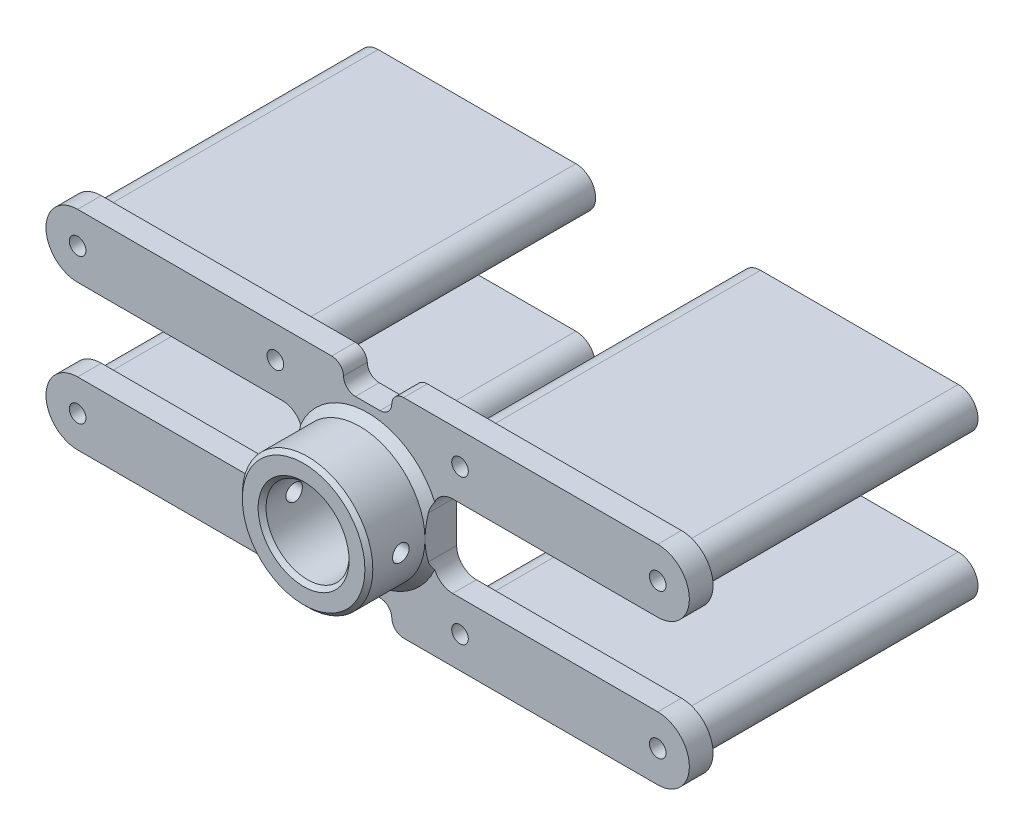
ISO-10303-21;
HEADER;
FILE_DESCRIPTION(('STEP AP214'),'2;1');
FILE_NAME('part.step','',(''),(''),'','','');
FILE_SCHEMA(('AUTOMOTIVE_DESIGN { 1 0 10303 214 1 1 1 1 }'));
ENDSEC;
DATA;
#1=APPLICATION_CONTEXT('core data for automotive mechanical design processes');
#2=APPLICATION_PROTOCOL_DEFINITION('international standard','automotive_design',2000,#1);
#3=PRODUCT_CONTEXT('',#1,'mechanical');
#4=PRODUCT('Part','Part','',(#3));
#5=PRODUCT_RELATED_PRODUCT_CATEGORY('part','',(#4));
#6=PRODUCT_DEFINITION_FORMATION('','',#4);
#7=PRODUCT_DEFINITION_CONTEXT('part definition',#1,'design');
#8=PRODUCT_DEFINITION('design','',#6,#7);
#9=PRODUCT_DEFINITION_SHAPE('','',#8);
#10=(LENGTH_UNIT() NAMED_UNIT(*) SI_UNIT(.MILLI.,.METRE.));
#11=(NAMED_UNIT(*) PLANE_ANGLE_UNIT() SI_UNIT($,.RADIAN.));
#12=(NAMED_UNIT(*) SI_UNIT($,.STERADIAN.) SOLID_ANGLE_UNIT());
#13=UNCERTAINTY_MEASURE_WITH_UNIT(LENGTH_MEASURE(1.E-05),#10,'distance_accuracy_value','');
#14=(GEOMETRIC_REPRESENTATION_CONTEXT(3) GLOBAL_UNCERTAINTY_ASSIGNED_CONTEXT((#13)) GLOBAL_UNIT_ASSIGNED_CONTEXT((#10,
#11,#12)) REPRESENTATION_CONTEXT('',''));
#15=CARTESIAN_POINT('',(0.,0.,0.));
#16=DIRECTION('',(0.,0.,1.));
#17=DIRECTION('',(1.,0.,0.));
#18=AXIS2_PLACEMENT_3D('',#15,#16,#17);
#19=CARTESIAN_POINT('',(-73.3500000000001,-18.35,76.));
#20=DIRECTION('',(0.,0.,1.));
#21=DIRECTION('',(1.,0.,0.));
#22=AXIS2_PLACEMENT_3D('',#19,#20,#21);
#23=PLANE('',#22);
#24=CARTESIAN_POINT('',(73.3500000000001,-18.35,76.));
#25=DIRECTION('',(0.,0.,1.));
#26=DIRECTION('',(1.,0.,0.));
#27=AXIS2_PLACEMENT_3D('',#24,#25,#26);
#28=CIRCLE('',#27,2.1);
#29=CARTESIAN_POINT('',(75.4500000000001,-18.35,76.));
#30=VERTEX_POINT('',#29);
#31=EDGE_CURVE('E887',#30,#30,#28,.T.);
#32=ORIENTED_EDGE('',*,*,#31,.F.);
#33=EDGE_LOOP('',(#32));
#34=FACE_BOUND('',#33,.T.);
#35=CARTESIAN_POINT('',(23.3500000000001,-18.35,76.));
#36=DIRECTION('',(0.,0.,1.));
#37=DIRECTION('',(1.,0.,0.));
#38=AXIS2_PLACEMENT_3D('',#35,#36,#37);
#39=CIRCLE('',#38,2.1);
#40=CARTESIAN_POINT('',(25.4500000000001,-18.35,76.));
#41=VERTEX_POINT('',#40);
#42=EDGE_CURVE('E893',#41,#41,#39,.T.);
#43=ORIENTED_EDGE('',*,*,#42,.F.);
#44=EDGE_LOOP('',(#43));
#45=FACE_BOUND('',#44,.T.);
#46=CARTESIAN_POINT('',(-23.35,-18.35,76.));
#47=DIRECTION('',(0.,0.,1.));
#48=DIRECTION('',(1.,0.,0.));
#49=AXIS2_PLACEMENT_3D('',#46,#47,#48);
#50=CIRCLE('',#49,2.1);
#51=CARTESIAN_POINT('',(-21.25,-18.35,76.));
#52=VERTEX_POINT('',#51);
#53=EDGE_CURVE('E897',#52,#52,#50,.T.);
#54=ORIENTED_EDGE('',*,*,#53,.F.);
#55=EDGE_LOOP('',(#54));
#56=FACE_BOUND('',#55,.T.);
#57=CARTESIAN_POINT('',(-73.3500000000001,-18.35,76.));
#58=DIRECTION('',(0.,0.,1.));
#59=DIRECTION('',(1.,0.,0.));
#60=AXIS2_PLACEMENT_3D('',#57,#58,#59);
#61=CIRCLE('',#60,2.1);
#62=CARTESIAN_POINT('',(-71.25,-18.35,76.));
#63=VERTEX_POINT('',#62);
#64=EDGE_CURVE('E901',#63,#63,#61,.T.);
#65=ORIENTED_EDGE('',*,*,#64,.F.);
#66=EDGE_LOOP('',(#65));
#67=FACE_BOUND('',#66,.T.);
#68=CARTESIAN_POINT('',(21.5,-5.35000000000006,76.));
#69=DIRECTION('',(0.,0.,-1.));
#70=DIRECTION('',(-1.,0.,0.));
#71=AXIS2_PLACEMENT_3D('',#68,#69,#70);
#72=CIRCLE('',#71,5.);
#73=CARTESIAN_POINT('',(21.5,-10.3500000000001,76.));
#74=VERTEX_POINT('',#73);
#75=CARTESIAN_POINT('',(16.9476842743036,-7.41795104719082,76.));
#76=VERTEX_POINT('',#75);
#77=EDGE_CURVE('E561',#74,#76,#72,.T.);
#78=ORIENTED_EDGE('',*,*,#77,.T.);
#79=CARTESIAN_POINT('',(0.,0.,76.));
#80=DIRECTION('',(0.,0.,1.));
#81=DIRECTION('',(1.,0.,0.));
#82=AXIS2_PLACEMENT_3D('',#79,#80,#81);
#83=CIRCLE('',#82,18.4999999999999);
#84=CARTESIAN_POINT('',(-16.9476842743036,-7.41795104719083,76.));
#85=VERTEX_POINT('',#84);
#86=EDGE_CURVE('E313',#76,#85,#83,.F.);
#87=ORIENTED_EDGE('',*,*,#86,.T.);
#88=CARTESIAN_POINT('',(-21.5,-5.35000000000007,76.));
#89=DIRECTION('',(0.,0.,-1.));
#90=DIRECTION('',(1.,0.,0.));
#91=AXIS2_PLACEMENT_3D('',#88,#89,#90);
#92=CIRCLE('',#91,5.);
#93=CARTESIAN_POINT('',(-21.5,-10.3500000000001,76.));
#94=VERTEX_POINT('',#93);
#95=EDGE_CURVE('E594',#85,#94,#92,.T.);
#96=ORIENTED_EDGE('',*,*,#95,.T.);
#97=DIRECTION('',(-1.,0.,0.));
#98=VECTOR('',#97,1.);
#99=CARTESIAN_POINT('',(-21.5,-10.3500000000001,76.));
#100=LINE('',#99,#98);
#101=CARTESIAN_POINT('',(-73.35,-10.35,76.));
#102=VERTEX_POINT('',#101);
#103=EDGE_CURVE('E293',#94,#102,#100,.T.);
#104=ORIENTED_EDGE('',*,*,#103,.T.);
#105=CARTESIAN_POINT('',(-73.3500000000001,-18.35,76.));
#106=DIRECTION('',(0.,0.,1.));
#107=DIRECTION('',(1.,0.,0.));
#108=AXIS2_PLACEMENT_3D('',#105,#106,#107);
#109=CIRCLE('',#108,7.99999999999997);
#110=CARTESIAN_POINT('',(-73.35,-26.35,76.));
#111=VERTEX_POINT('',#110);
#112=EDGE_CURVE('E288',#102,#111,#109,.T.);
#113=ORIENTED_EDGE('',*,*,#112,.T.);
#114=DIRECTION('',(1.,0.,0.));
#115=VECTOR('',#114,1.);
#116=CARTESIAN_POINT('',(-73.35,-26.35,76.));
#117=LINE('',#116,#115);
#118=CARTESIAN_POINT('',(-9.1,-26.3499999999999,76.));
#119=VERTEX_POINT('',#118);
#120=EDGE_CURVE('E277',#111,#119,#117,.T.);
#121=ORIENTED_EDGE('',*,*,#120,.T.);
#122=CARTESIAN_POINT('',(-9.1,-23.3499999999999,76.));
#123=DIRECTION('',(0.,0.,1.));
#124=DIRECTION('',(-1.,0.,0.));
#125=AXIS2_PLACEMENT_3D('',#122,#123,#124);
#126=CIRCLE('',#125,3.);
#127=CARTESIAN_POINT('',(-6.1,-23.3499999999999,76.));
#128=VERTEX_POINT('',#127);
#129=EDGE_CURVE('E287',#119,#128,#126,.T.);
#130=ORIENTED_EDGE('',*,*,#129,.T.);
#131=DIRECTION('',(0.,-1.,0.));
#132=VECTOR('',#131,1.);
#133=CARTESIAN_POINT('',(-6.1,-23.5,76.));
#134=LINE('',#133,#132);
#135=CARTESIAN_POINT('',(-6.1,-23.5,76.));
#136=VERTEX_POINT('',#135);
#137=EDGE_CURVE('E543',#128,#136,#134,.T.);
#138=ORIENTED_EDGE('',*,*,#137,.T.);
#139=CARTESIAN_POINT('',(-3.1,-23.5,76.));
#140=DIRECTION('',(0.,0.,-1.));
#141=DIRECTION('',(-1.,0.,0.));
#142=AXIS2_PLACEMENT_3D('',#139,#140,#141);
#143=CIRCLE('',#142,3.);
#144=CARTESIAN_POINT('',(-3.1,-20.5,76.));
#145=VERTEX_POINT('',#144);
#146=EDGE_CURVE('E545',#136,#145,#143,.T.);
#147=ORIENTED_EDGE('',*,*,#146,.T.);
#148=DIRECTION('',(1.,0.,0.));
#149=VECTOR('',#148,1.);
#150=CARTESIAN_POINT('',(-3.1,-20.5,76.));
#151=LINE('',#150,#149);
#152=CARTESIAN_POINT('',(3.1,-20.5,76.));
#153=VERTEX_POINT('',#152);
#154=EDGE_CURVE('E547',#145,#153,#151,.T.);
#155=ORIENTED_EDGE('',*,*,#154,.T.);
#156=CARTESIAN_POINT('',(3.1,-23.5,76.));
#157=DIRECTION('',(0.,0.,-1.));
#158=DIRECTION('',(1.,0.,0.));
#159=AXIS2_PLACEMENT_3D('',#156,#157,#158);
#160=CIRCLE('',#159,3.);
#161=CARTESIAN_POINT('',(6.1,-23.5,76.));
#162=VERTEX_POINT('',#161);
#163=EDGE_CURVE('E549',#153,#162,#160,.T.);
#164=ORIENTED_EDGE('',*,*,#163,.T.);
#165=DIRECTION('',(0.,1.,0.));
#166=VECTOR('',#165,1.);
#167=CARTESIAN_POINT('',(6.1,-23.5,76.));
#168=LINE('',#167,#166);
#169=CARTESIAN_POINT('',(6.1,-23.3499999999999,76.));
#170=VERTEX_POINT('',#169);
#171=EDGE_CURVE('E551',#162,#170,#168,.T.);
#172=ORIENTED_EDGE('',*,*,#171,.T.);
#173=CARTESIAN_POINT('',(9.1,-23.3499999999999,76.));
#174=DIRECTION('',(0.,0.,1.));
#175=DIRECTION('',(-1.,0.,0.));
#176=AXIS2_PLACEMENT_3D('',#173,#174,#175);
#177=CIRCLE('',#176,3.);
#178=CARTESIAN_POINT('',(9.1,-26.3499999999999,76.));
#179=VERTEX_POINT('',#178);
#180=EDGE_CURVE('E553',#170,#179,#177,.T.);
#181=ORIENTED_EDGE('',*,*,#180,.T.);
#182=DIRECTION('',(1.,0.,0.));
#183=VECTOR('',#182,1.);
#184=CARTESIAN_POINT('',(9.1,-26.3499999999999,76.));
#185=LINE('',#184,#183);
#186=CARTESIAN_POINT('',(73.3500000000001,-26.35,76.));
#187=VERTEX_POINT('',#186);
#188=EDGE_CURVE('E555',#179,#187,#185,.T.);
#189=ORIENTED_EDGE('',*,*,#188,.T.);
#190=CARTESIAN_POINT('',(73.3500000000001,-18.35,76.));
#191=DIRECTION('',(0.,0.,1.));
#192=DIRECTION('',(1.,0.,0.));
#193=AXIS2_PLACEMENT_3D('',#190,#191,#192);
#194=CIRCLE('',#193,7.99999999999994);
#195=CARTESIAN_POINT('',(73.3500000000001,-10.3500000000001,76.));
#196=VERTEX_POINT('',#195);
#197=EDGE_CURVE('E557',#187,#196,#194,.T.);
#198=ORIENTED_EDGE('',*,*,#197,.T.);
#199=DIRECTION('',(-1.,0.,0.));
#200=VECTOR('',#199,1.);
#201=CARTESIAN_POINT('',(73.3500000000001,-10.3500000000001,76.));
#202=LINE('',#201,#200);
#203=EDGE_CURVE('E559',#196,#74,#202,.T.);
#204=ORIENTED_EDGE('',*,*,#203,.T.);
#205=EDGE_LOOP('',(#78,#87,#96,#104,#113,#121,#130,#138,#147,#155,#164,#172,#181,#189,#198,#204));
#206=FACE_BOUND('',#205,.T.);
#207=ADVANCED_FACE('F49',(#34,#45,#56,#67,#206),#23,.T.);
#208=CARTESIAN_POINT('',(73.3500000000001,18.35,76.));
#209=DIRECTION('',(0.,0.,1.));
#210=DIRECTION('',(1.,0.,0.));
#211=AXIS2_PLACEMENT_3D('',#208,#209,#210);
#212=CIRCLE('',#211,2.1);
#213=CARTESIAN_POINT('',(75.4500000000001,18.35,76.));
#214=VERTEX_POINT('',#213);
#215=EDGE_CURVE('E905',#214,#214,#212,.T.);
#216=ORIENTED_EDGE('',*,*,#215,.F.);
#217=EDGE_LOOP('',(#216));
#218=FACE_BOUND('',#217,.T.);
#219=CARTESIAN_POINT('',(23.3500000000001,18.35,76.));
#220=DIRECTION('',(0.,0.,1.));
#221=DIRECTION('',(1.,0.,0.));
#222=AXIS2_PLACEMENT_3D('',#219,#220,#221);
#223=CIRCLE('',#222,2.1);
#224=CARTESIAN_POINT('',(25.4500000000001,18.35,76.));
#225=VERTEX_POINT('',#224);
#226=EDGE_CURVE('E909',#225,#225,#223,.T.);
#227=ORIENTED_EDGE('',*,*,#226,.F.);
#228=EDGE_LOOP('',(#227));
#229=FACE_BOUND('',#228,.T.);
#230=CARTESIAN_POINT('',(-23.35,18.35,76.));
#231=DIRECTION('',(0.,0.,1.));
#232=DIRECTION('',(1.,0.,0.));
#233=AXIS2_PLACEMENT_3D('',#230,#231,#232);
#234=CIRCLE('',#233,2.1);
#235=CARTESIAN_POINT('',(-21.25,18.35,76.));
#236=VERTEX_POINT('',#235);
#237=EDGE_CURVE('E913',#236,#236,#234,.T.);
#238=ORIENTED_EDGE('',*,*,#237,.F.);
#239=EDGE_LOOP('',(#238));
#240=FACE_BOUND('',#239,.T.);
#241=CARTESIAN_POINT('',(-73.3500000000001,18.35,76.));
#242=DIRECTION('',(0.,0.,1.));
#243=DIRECTION('',(1.,0.,0.));
#244=AXIS2_PLACEMENT_3D('',#241,#242,#243);
#245=CIRCLE('',#244,2.1);
#246=CARTESIAN_POINT('',(-71.25,18.35,76.));
#247=VERTEX_POINT('',#246);
#248=EDGE_CURVE('E917',#247,#247,#245,.T.);
#249=ORIENTED_EDGE('',*,*,#248,.F.);
#250=EDGE_LOOP('',(#249));
#251=FACE_BOUND('',#250,.T.);
#252=CARTESIAN_POINT('',(-21.5,5.35000000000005,76.));
#253=DIRECTION('',(0.,0.,-1.));
#254=DIRECTION('',(1.,0.,0.));
#255=AXIS2_PLACEMENT_3D('',#252,#253,#254);
#256=CIRCLE('',#255,5.);
#257=CARTESIAN_POINT('',(-21.5,10.35,76.));
#258=VERTEX_POINT('',#257);
#259=CARTESIAN_POINT('',(-16.9476842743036,7.41795104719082,76.));
#260=VERTEX_POINT('',#259);
#261=EDGE_CURVE('E591',#258,#260,#256,.T.);
#262=ORIENTED_EDGE('',*,*,#261,.T.);
#263=CARTESIAN_POINT('',(0.,0.,76.));
#264=DIRECTION('',(0.,0.,1.));
#265=DIRECTION('',(1.,0.,0.));
#266=AXIS2_PLACEMENT_3D('',#263,#264,#265);
#267=CIRCLE('',#266,18.4999999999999);
#268=CARTESIAN_POINT('',(16.9476842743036,7.41795104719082,76.));
#269=VERTEX_POINT('',#268);
#270=EDGE_CURVE('E316',#260,#269,#267,.F.);
#271=ORIENTED_EDGE('',*,*,#270,.T.);
#272=CARTESIAN_POINT('',(21.5,5.35000000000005,76.));
#273=DIRECTION('',(0.,0.,-1.));
#274=DIRECTION('',(-1.,0.,0.));
#275=AXIS2_PLACEMENT_3D('',#272,#273,#274);
#276=CIRCLE('',#275,5.);
#277=CARTESIAN_POINT('',(21.5,10.35,76.));
#278=VERTEX_POINT('',#277);
#279=EDGE_CURVE('E563',#269,#278,#276,.T.);
#280=ORIENTED_EDGE('',*,*,#279,.T.);
#281=DIRECTION('',(1.,0.,0.));
#282=VECTOR('',#281,1.);
#283=CARTESIAN_POINT('',(21.5,10.35,76.));
#284=LINE('',#283,#282);
#285=CARTESIAN_POINT('',(73.35,10.3500000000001,76.));
#286=VERTEX_POINT('',#285);
#287=EDGE_CURVE('E565',#278,#286,#284,.T.);
#288=ORIENTED_EDGE('',*,*,#287,.T.);
#289=CARTESIAN_POINT('',(73.3500000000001,18.35,76.));
#290=DIRECTION('',(0.,0.,1.));
#291=DIRECTION('',(1.,0.,0.));
#292=AXIS2_PLACEMENT_3D('',#289,#290,#291);
#293=CIRCLE('',#292,7.99999999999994);
#294=CARTESIAN_POINT('',(73.3500000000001,26.3499999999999,76.));
#295=VERTEX_POINT('',#294);
#296=EDGE_CURVE('E567',#286,#295,#293,.T.);
#297=ORIENTED_EDGE('',*,*,#296,.T.);
#298=DIRECTION('',(-1.,0.,0.));
#299=VECTOR('',#298,1.);
#300=CARTESIAN_POINT('',(73.3500000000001,26.3499999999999,76.));
#301=LINE('',#300,#299);
#302=CARTESIAN_POINT('',(9.1,26.3499999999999,76.));
#303=VERTEX_POINT('',#302);
#304=EDGE_CURVE('E569',#295,#303,#301,.T.);
#305=ORIENTED_EDGE('',*,*,#304,.T.);
#306=CARTESIAN_POINT('',(9.1,23.3499999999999,76.));
#307=DIRECTION('',(0.,0.,1.));
#308=DIRECTION('',(1.,0.,0.));
#309=AXIS2_PLACEMENT_3D('',#306,#307,#308);
#310=CIRCLE('',#309,3.);
#311=CARTESIAN_POINT('',(6.1,23.3499999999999,76.));
#312=VERTEX_POINT('',#311);
#313=EDGE_CURVE('E571',#303,#312,#310,.T.);
#314=ORIENTED_EDGE('',*,*,#313,.T.);
#315=DIRECTION('',(0.,1.,0.));
#316=VECTOR('',#315,1.);
#317=CARTESIAN_POINT('',(6.1,23.5,76.));
#318=LINE('',#317,#316);
#319=CARTESIAN_POINT('',(6.1,23.5,76.));
#320=VERTEX_POINT('',#319);
#321=EDGE_CURVE('E573',#312,#320,#318,.T.);
#322=ORIENTED_EDGE('',*,*,#321,.T.);
#323=CARTESIAN_POINT('',(3.1,23.5,76.));
#324=DIRECTION('',(0.,0.,-1.));
#325=DIRECTION('',(-1.,0.,0.));
#326=AXIS2_PLACEMENT_3D('',#323,#324,#325);
#327=CIRCLE('',#326,3.);
#328=CARTESIAN_POINT('',(3.1,20.5,76.));
#329=VERTEX_POINT('',#328);
#330=EDGE_CURVE('E575',#320,#329,#327,.T.);
#331=ORIENTED_EDGE('',*,*,#330,.T.);
#332=DIRECTION('',(-1.,0.,0.));
#333=VECTOR('',#332,1.);
#334=CARTESIAN_POINT('',(-3.1,20.5,76.));
#335=LINE('',#334,#333);
#336=CARTESIAN_POINT('',(-3.1,20.5,76.));
#337=VERTEX_POINT('',#336);
#338=EDGE_CURVE('E577',#329,#337,#335,.T.);
#339=ORIENTED_EDGE('',*,*,#338,.T.);
#340=CARTESIAN_POINT('',(-3.1,23.5,76.));
#341=DIRECTION('',(0.,0.,-1.));
#342=DIRECTION('',(-1.,0.,0.));
#343=AXIS2_PLACEMENT_3D('',#340,#341,#342);
#344=CIRCLE('',#343,3.);
#345=CARTESIAN_POINT('',(-6.1,23.5,76.));
#346=VERTEX_POINT('',#345);
#347=EDGE_CURVE('E579',#337,#346,#344,.T.);
#348=ORIENTED_EDGE('',*,*,#347,.T.);
#349=DIRECTION('',(0.,-1.,0.));
#350=VECTOR('',#349,1.);
#351=CARTESIAN_POINT('',(-6.1,23.5,76.));
#352=LINE('',#351,#350);
#353=CARTESIAN_POINT('',(-6.1,23.3499999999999,76.));
#354=VERTEX_POINT('',#353);
#355=EDGE_CURVE('E581',#346,#354,#352,.T.);
#356=ORIENTED_EDGE('',*,*,#355,.T.);
#357=CARTESIAN_POINT('',(-9.1,23.3499999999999,76.));
#358=DIRECTION('',(0.,0.,1.));
#359=DIRECTION('',(1.,0.,0.));
#360=AXIS2_PLACEMENT_3D('',#357,#358,#359);
#361=CIRCLE('',#360,3.);
#362=CARTESIAN_POINT('',(-9.1,26.3499999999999,76.));
#363=VERTEX_POINT('',#362);
#364=EDGE_CURVE('E583',#354,#363,#361,.T.);
#365=ORIENTED_EDGE('',*,*,#364,.T.);
#366=DIRECTION('',(-1.,0.,0.));
#367=VECTOR('',#366,1.);
#368=CARTESIAN_POINT('',(-9.1,26.3499999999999,76.));
#369=LINE('',#368,#367);
#370=CARTESIAN_POINT('',(-73.35,26.3499999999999,76.));
#371=VERTEX_POINT('',#370);
#372=EDGE_CURVE('E585',#363,#371,#369,.T.);
#373=ORIENTED_EDGE('',*,*,#372,.T.);
#374=CARTESIAN_POINT('',(-73.3500000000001,18.35,76.));
#375=DIRECTION('',(0.,0.,1.));
#376=DIRECTION('',(1.,0.,0.));
#377=AXIS2_PLACEMENT_3D('',#374,#375,#376);
#378=CIRCLE('',#377,7.99999999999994);
#379=CARTESIAN_POINT('',(-73.35,10.35,76.));
#380=VERTEX_POINT('',#379);
#381=EDGE_CURVE('E587',#371,#380,#378,.T.);
#382=ORIENTED_EDGE('',*,*,#381,.T.);
#383=DIRECTION('',(1.,0.,0.));
#384=VECTOR('',#383,1.);
#385=CARTESIAN_POINT('',(-73.35,10.35,76.));
#386=LINE('',#385,#384);
#387=EDGE_CURVE('E589',#380,#258,#386,.T.);
#388=ORIENTED_EDGE('',*,*,#387,.T.);
#389=EDGE_LOOP('',(#262,#271,#280,#288,#297,#305,#314,#322,#331,#339,#348,#356,#365,#373,#382,#388));
#390=FACE_BOUND('',#389,.T.);
#391=ADVANCED_FACE('F470',(#218,#229,#240,#251,#390),#23,.T.);
#392=CARTESIAN_POINT('',(-73.3500000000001,-18.35,70.));
#393=DIRECTION('',(0.,0.,1.));
#394=DIRECTION('',(1.,0.,0.));
#395=AXIS2_PLACEMENT_3D('',#392,#393,#394);
#396=PLANE('',#395);
#397=CARTESIAN_POINT('',(73.3500000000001,-18.35,70.));
#398=DIRECTION('',(0.,0.,1.));
#399=DIRECTION('',(1.,0.,0.));
#400=AXIS2_PLACEMENT_3D('',#397,#398,#399);
#401=CIRCLE('',#400,2.1);
#402=CARTESIAN_POINT('',(75.4500000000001,-18.35,70.));
#403=VERTEX_POINT('',#402);
#404=EDGE_CURVE('E494',#403,#403,#401,.F.);
#405=ORIENTED_EDGE('',*,*,#404,.F.);
#406=EDGE_LOOP('',(#405));
#407=FACE_BOUND('',#406,.T.);
#408=CARTESIAN_POINT('',(23.3500000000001,-18.35,70.));
#409=DIRECTION('',(0.,0.,1.));
#410=DIRECTION('',(1.,0.,0.));
#411=AXIS2_PLACEMENT_3D('',#408,#409,#410);
#412=CIRCLE('',#411,2.1);
#413=CARTESIAN_POINT('',(25.4500000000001,-18.35,70.));
#414=VERTEX_POINT('',#413);
#415=EDGE_CURVE('E498',#414,#414,#412,.F.);
#416=ORIENTED_EDGE('',*,*,#415,.F.);
#417=EDGE_LOOP('',(#416));
#418=FACE_BOUND('',#417,.T.);
#419=CARTESIAN_POINT('',(-23.35,-18.35,70.));
#420=DIRECTION('',(0.,0.,1.));
#421=DIRECTION('',(1.,0.,0.));
#422=AXIS2_PLACEMENT_3D('',#419,#420,#421);
#423=CIRCLE('',#422,2.1);
#424=CARTESIAN_POINT('',(-21.25,-18.35,70.));
#425=VERTEX_POINT('',#424);
#426=EDGE_CURVE('E502',#425,#425,#423,.F.);
#427=ORIENTED_EDGE('',*,*,#426,.F.);
#428=EDGE_LOOP('',(#427));
#429=FACE_BOUND('',#428,.T.);
#430=CARTESIAN_POINT('',(-73.3500000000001,-18.35,70.));
#431=DIRECTION('',(0.,0.,1.));
#432=DIRECTION('',(1.,0.,0.));
#433=AXIS2_PLACEMENT_3D('',#430,#431,#432);
#434=CIRCLE('',#433,2.1);
#435=CARTESIAN_POINT('',(-71.25,-18.35,70.));
#436=VERTEX_POINT('',#435);
#437=EDGE_CURVE('E506',#436,#436,#434,.F.);
#438=ORIENTED_EDGE('',*,*,#437,.F.);
#439=EDGE_LOOP('',(#438));
#440=FACE_BOUND('',#439,.T.);
#441=CARTESIAN_POINT('',(73.3500000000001,18.35,70.));
#442=DIRECTION('',(0.,0.,1.));
#443=DIRECTION('',(1.,0.,0.));
#444=AXIS2_PLACEMENT_3D('',#441,#442,#443);
#445=CIRCLE('',#444,2.1);
#446=CARTESIAN_POINT('',(75.4500000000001,18.35,70.));
#447=VERTEX_POINT('',#446);
#448=EDGE_CURVE('E510',#447,#447,#445,.F.);
#449=ORIENTED_EDGE('',*,*,#448,.F.);
#450=EDGE_LOOP('',(#449));
#451=FACE_BOUND('',#450,.T.);
#452=CARTESIAN_POINT('',(23.3500000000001,18.35,70.));
#453=DIRECTION('',(0.,0.,1.));
#454=DIRECTION('',(1.,0.,0.));
#455=AXIS2_PLACEMENT_3D('',#452,#453,#454);
#456=CIRCLE('',#455,2.1);
#457=CARTESIAN_POINT('',(25.4500000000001,18.35,70.));
#458=VERTEX_POINT('',#457);
#459=EDGE_CURVE('E514',#458,#458,#456,.F.);
#460=ORIENTED_EDGE('',*,*,#459,.F.);
#461=EDGE_LOOP('',(#460));
#462=FACE_BOUND('',#461,.T.);
#463=CARTESIAN_POINT('',(-23.35,18.35,70.));
#464=DIRECTION('',(0.,0.,1.));
#465=DIRECTION('',(1.,0.,0.));
#466=AXIS2_PLACEMENT_3D('',#463,#464,#465);
#467=CIRCLE('',#466,2.1);
#468=CARTESIAN_POINT('',(-21.25,18.35,70.));
#469=VERTEX_POINT('',#468);
#470=EDGE_CURVE('E518',#469,#469,#467,.F.);
#471=ORIENTED_EDGE('',*,*,#470,.F.);
#472=EDGE_LOOP('',(#471));
#473=FACE_BOUND('',#472,.T.);
#474=CARTESIAN_POINT('',(-73.3500000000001,18.35,70.));
#475=DIRECTION('',(0.,0.,1.));
#476=DIRECTION('',(1.,0.,0.));
#477=AXIS2_PLACEMENT_3D('',#474,#475,#476);
#478=CIRCLE('',#477,2.1);
#479=CARTESIAN_POINT('',(-71.25,18.35,70.));
#480=VERTEX_POINT('',#479);
#481=EDGE_CURVE('E522',#480,#480,#478,.F.);
#482=ORIENTED_EDGE('',*,*,#481,.F.);
#483=EDGE_LOOP('',(#482));
#484=FACE_BOUND('',#483,.T.);
#485=CARTESIAN_POINT('',(-73.3500000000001,-18.35,70.));
#486=DIRECTION('',(0.,0.,1.));
#487=DIRECTION('',(1.,0.,0.));
#488=AXIS2_PLACEMENT_3D('',#485,#486,#487);
#489=CIRCLE('',#488,7.99999999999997);
#490=CARTESIAN_POINT('',(-73.35,-10.35,70.));
#491=VERTEX_POINT('',#490);
#492=CARTESIAN_POINT('',(-73.35,-26.35,70.));
#493=VERTEX_POINT('',#492);
#494=EDGE_CURVE('E301',#491,#493,#489,.T.);
#495=ORIENTED_EDGE('',*,*,#494,.F.);
#496=DIRECTION('',(-1.,0.,0.));
#497=VECTOR('',#496,1.);
#498=CARTESIAN_POINT('',(-21.5,-10.3500000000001,70.));
#499=LINE('',#498,#497);
#500=CARTESIAN_POINT('',(-21.5,-10.3500000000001,70.));
#501=VERTEX_POINT('',#500);
#502=EDGE_CURVE('E297',#501,#491,#499,.T.);
#503=ORIENTED_EDGE('',*,*,#502,.F.);
#504=CARTESIAN_POINT('',(-21.5,-5.35000000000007,70.));
#505=DIRECTION('',(0.,0.,-1.));
#506=DIRECTION('',(1.,0.,0.));
#507=AXIS2_PLACEMENT_3D('',#504,#505,#506);
#508=CIRCLE('',#507,5.);
#509=CARTESIAN_POINT('',(-16.5,-5.35000000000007,70.));
#510=VERTEX_POINT('',#509);
#511=EDGE_CURVE('E658',#510,#501,#508,.T.);
#512=ORIENTED_EDGE('',*,*,#511,.F.);
#513=DIRECTION('',(0.,-1.,0.));
#514=VECTOR('',#513,1.);
#515=CARTESIAN_POINT('',(-16.5,5.35000000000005,70.));
#516=LINE('',#515,#514);
#517=CARTESIAN_POINT('',(-16.5,5.35000000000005,70.));
#518=VERTEX_POINT('',#517);
#519=EDGE_CURVE('E656',#518,#510,#516,.T.);
#520=ORIENTED_EDGE('',*,*,#519,.F.);
#521=CARTESIAN_POINT('',(-21.5,5.35000000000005,70.));
#522=DIRECTION('',(0.,0.,-1.));
#523=DIRECTION('',(1.,0.,0.));
#524=AXIS2_PLACEMENT_3D('',#521,#522,#523);
#525=CIRCLE('',#524,5.);
#526=CARTESIAN_POINT('',(-21.5,10.35,70.));
#527=VERTEX_POINT('',#526);
#528=EDGE_CURVE('E654',#527,#518,#525,.T.);
#529=ORIENTED_EDGE('',*,*,#528,.F.);
#530=DIRECTION('',(1.,0.,0.));
#531=VECTOR('',#530,1.);
#532=CARTESIAN_POINT('',(-73.35,10.35,70.));
#533=LINE('',#532,#531);
#534=CARTESIAN_POINT('',(-73.35,10.35,70.));
#535=VERTEX_POINT('',#534);
#536=EDGE_CURVE('E652',#535,#527,#533,.T.);
#537=ORIENTED_EDGE('',*,*,#536,.F.);
#538=CARTESIAN_POINT('',(-73.3500000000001,18.35,70.));
#539=DIRECTION('',(0.,0.,1.));
#540=DIRECTION('',(1.,0.,0.));
#541=AXIS2_PLACEMENT_3D('',#538,#539,#540);
#542=CIRCLE('',#541,7.99999999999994);
#543=CARTESIAN_POINT('',(-73.35,26.3499999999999,70.));
#544=VERTEX_POINT('',#543);
#545=EDGE_CURVE('E650',#544,#535,#542,.T.);
#546=ORIENTED_EDGE('',*,*,#545,.F.);
#547=DIRECTION('',(-1.,0.,0.));
#548=VECTOR('',#547,1.);
#549=CARTESIAN_POINT('',(-23.35,26.3499999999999,70.));
#550=LINE('',#549,#548);
#551=CARTESIAN_POINT('',(-9.1,26.3499999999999,70.));
#552=VERTEX_POINT('',#551);
#553=EDGE_CURVE('E648',#552,#544,#550,.T.);
#554=ORIENTED_EDGE('',*,*,#553,.F.);
#555=CARTESIAN_POINT('',(-9.1,23.3499999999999,70.));
#556=DIRECTION('',(0.,0.,1.));
#557=DIRECTION('',(1.,0.,0.));
#558=AXIS2_PLACEMENT_3D('',#555,#556,#557);
#559=CIRCLE('',#558,3.);
#560=CARTESIAN_POINT('',(-6.1,23.3499999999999,70.));
#561=VERTEX_POINT('',#560);
#562=EDGE_CURVE('E645',#561,#552,#559,.T.);
#563=ORIENTED_EDGE('',*,*,#562,.F.);
#564=DIRECTION('',(0.,-1.,0.));
#565=VECTOR('',#564,1.);
#566=CARTESIAN_POINT('',(-6.1,23.5,70.));
#567=LINE('',#566,#565);
#568=CARTESIAN_POINT('',(-6.1,23.5,70.));
#569=VERTEX_POINT('',#568);
#570=EDGE_CURVE('E643',#569,#561,#567,.T.);
#571=ORIENTED_EDGE('',*,*,#570,.F.);
#572=CARTESIAN_POINT('',(-3.1,23.5,70.));
#573=DIRECTION('',(0.,0.,-1.));
#574=DIRECTION('',(-1.,0.,0.));
#575=AXIS2_PLACEMENT_3D('',#572,#573,#574);
#576=CIRCLE('',#575,3.);
#577=CARTESIAN_POINT('',(-3.1,20.5,70.));
#578=VERTEX_POINT('',#577);
#579=EDGE_CURVE('E641',#578,#569,#576,.T.);
#580=ORIENTED_EDGE('',*,*,#579,.F.);
#581=DIRECTION('',(-1.,0.,0.));
#582=VECTOR('',#581,1.);
#583=CARTESIAN_POINT('',(-3.1,20.5,70.));
#584=LINE('',#583,#582);
#585=CARTESIAN_POINT('',(3.1,20.5,70.));
#586=VERTEX_POINT('',#585);
#587=EDGE_CURVE('E639',#586,#578,#584,.T.);
#588=ORIENTED_EDGE('',*,*,#587,.F.);
#589=CARTESIAN_POINT('',(3.1,23.5,70.));
#590=DIRECTION('',(0.,0.,-1.));
#591=DIRECTION('',(-1.,0.,0.));
#592=AXIS2_PLACEMENT_3D('',#589,#590,#591);
#593=CIRCLE('',#592,3.);
#594=CARTESIAN_POINT('',(6.1,23.5,70.));
#595=VERTEX_POINT('',#594);
#596=EDGE_CURVE('E637',#595,#586,#593,.T.);
#597=ORIENTED_EDGE('',*,*,#596,.F.);
#598=DIRECTION('',(0.,1.,0.));
#599=VECTOR('',#598,1.);
#600=CARTESIAN_POINT('',(6.1,23.5,70.));
#601=LINE('',#600,#599);
#602=CARTESIAN_POINT('',(6.1,23.3499999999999,70.));
#603=VERTEX_POINT('',#602);
#604=EDGE_CURVE('E635',#603,#595,#601,.T.);
#605=ORIENTED_EDGE('',*,*,#604,.F.);
#606=CARTESIAN_POINT('',(9.1,23.3499999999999,70.));
#607=DIRECTION('',(0.,0.,1.));
#608=DIRECTION('',(1.,0.,0.));
#609=AXIS2_PLACEMENT_3D('',#606,#607,#608);
#610=CIRCLE('',#609,3.);
#611=CARTESIAN_POINT('',(9.1,26.3499999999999,70.));
#612=VERTEX_POINT('',#611);
#613=EDGE_CURVE('E633',#612,#603,#610,.T.);
#614=ORIENTED_EDGE('',*,*,#613,.F.);
#615=DIRECTION('',(-1.,0.,0.));
#616=VECTOR('',#615,1.);
#617=CARTESIAN_POINT('',(23.3500000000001,26.3499999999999,70.));
#618=LINE('',#617,#616);
#619=CARTESIAN_POINT('',(73.3500000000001,26.3499999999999,70.));
#620=VERTEX_POINT('',#619);
#621=EDGE_CURVE('E631',#620,#612,#618,.T.);
#622=ORIENTED_EDGE('',*,*,#621,.F.);
#623=CARTESIAN_POINT('',(73.3500000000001,18.35,70.));
#624=DIRECTION('',(0.,0.,1.));
#625=DIRECTION('',(1.,0.,0.));
#626=AXIS2_PLACEMENT_3D('',#623,#624,#625);
#627=CIRCLE('',#626,7.99999999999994);
#628=CARTESIAN_POINT('',(73.35,10.3500000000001,70.));
#629=VERTEX_POINT('',#628);
#630=EDGE_CURVE('E628',#629,#620,#627,.T.);
#631=ORIENTED_EDGE('',*,*,#630,.F.);
#632=DIRECTION('',(1.,0.,0.));
#633=VECTOR('',#632,1.);
#634=CARTESIAN_POINT('',(21.5,10.35,70.));
#635=LINE('',#634,#633);
#636=CARTESIAN_POINT('',(21.5,10.35,70.));
#637=VERTEX_POINT('',#636);
#638=EDGE_CURVE('E626',#637,#629,#635,.T.);
#639=ORIENTED_EDGE('',*,*,#638,.F.);
#640=CARTESIAN_POINT('',(21.5,5.35000000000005,70.));
#641=DIRECTION('',(0.,0.,-1.));
#642=DIRECTION('',(-1.,0.,0.));
#643=AXIS2_PLACEMENT_3D('',#640,#641,#642);
#644=CIRCLE('',#643,5.);
#645=CARTESIAN_POINT('',(16.5,5.35000000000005,70.));
#646=VERTEX_POINT('',#645);
#647=EDGE_CURVE('E624',#646,#637,#644,.T.);
#648=ORIENTED_EDGE('',*,*,#647,.F.);
#649=DIRECTION('',(0.,1.,0.));
#650=VECTOR('',#649,1.);
#651=CARTESIAN_POINT('',(16.5,-5.35000000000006,70.));
#652=LINE('',#651,#650);
#653=CARTESIAN_POINT('',(16.5,-5.35000000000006,70.));
#654=VERTEX_POINT('',#653);
#655=EDGE_CURVE('E622',#654,#646,#652,.T.);
#656=ORIENTED_EDGE('',*,*,#655,.F.);
#657=CARTESIAN_POINT('',(21.5,-5.35000000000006,70.));
#658=DIRECTION('',(0.,0.,-1.));
#659=DIRECTION('',(-1.,0.,0.));
#660=AXIS2_PLACEMENT_3D('',#657,#658,#659);
#661=CIRCLE('',#660,5.);
#662=CARTESIAN_POINT('',(21.5,-10.3500000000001,70.));
#663=VERTEX_POINT('',#662);
#664=EDGE_CURVE('E620',#663,#654,#661,.T.);
#665=ORIENTED_EDGE('',*,*,#664,.F.);
#666=DIRECTION('',(-1.,0.,0.));
#667=VECTOR('',#666,1.);
#668=CARTESIAN_POINT('',(73.3500000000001,-10.3500000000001,70.));
#669=LINE('',#668,#667);
#670=CARTESIAN_POINT('',(73.3500000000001,-10.3500000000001,70.));
#671=VERTEX_POINT('',#670);
#672=EDGE_CURVE('E618',#671,#663,#669,.T.);
#673=ORIENTED_EDGE('',*,*,#672,.F.);
#674=CARTESIAN_POINT('',(73.3500000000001,-18.35,70.));
#675=DIRECTION('',(0.,0.,1.));
#676=DIRECTION('',(1.,0.,0.));
#677=AXIS2_PLACEMENT_3D('',#674,#675,#676);
#678=CIRCLE('',#677,7.99999999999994);
#679=CARTESIAN_POINT('',(73.3500000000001,-26.35,70.));
#680=VERTEX_POINT('',#679);
#681=EDGE_CURVE('E616',#680,#671,#678,.T.);
#682=ORIENTED_EDGE('',*,*,#681,.F.);
#683=DIRECTION('',(1.,0.,0.));
#684=VECTOR('',#683,1.);
#685=CARTESIAN_POINT('',(23.3500000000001,-26.35,70.));
#686=LINE('',#685,#684);
#687=CARTESIAN_POINT('',(9.1,-26.3499999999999,70.));
#688=VERTEX_POINT('',#687);
#689=EDGE_CURVE('E614',#688,#680,#686,.T.);
#690=ORIENTED_EDGE('',*,*,#689,.F.);
#691=CARTESIAN_POINT('',(9.1,-23.3499999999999,70.));
#692=DIRECTION('',(0.,0.,1.));
#693=DIRECTION('',(-1.,0.,0.));
#694=AXIS2_PLACEMENT_3D('',#691,#692,#693);
#695=CIRCLE('',#694,3.);
#696=CARTESIAN_POINT('',(6.1,-23.3499999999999,70.));
#697=VERTEX_POINT('',#696);
#698=EDGE_CURVE('E611',#697,#688,#695,.T.);
#699=ORIENTED_EDGE('',*,*,#698,.F.);
#700=DIRECTION('',(0.,1.,0.));
#701=VECTOR('',#700,1.);
#702=CARTESIAN_POINT('',(6.1,-23.5,70.));
#703=LINE('',#702,#701);
#704=CARTESIAN_POINT('',(6.1,-23.5,70.));
#705=VERTEX_POINT('',#704);
#706=EDGE_CURVE('E609',#705,#697,#703,.T.);
#707=ORIENTED_EDGE('',*,*,#706,.F.);
#708=CARTESIAN_POINT('',(3.1,-23.5,70.));
#709=DIRECTION('',(0.,0.,-1.));
#710=DIRECTION('',(1.,0.,0.));
#711=AXIS2_PLACEMENT_3D('',#708,#709,#710);
#712=CIRCLE('',#711,3.);
#713=CARTESIAN_POINT('',(3.1,-20.5,70.));
#714=VERTEX_POINT('',#713);
#715=EDGE_CURVE('E607',#714,#705,#712,.T.);
#716=ORIENTED_EDGE('',*,*,#715,.F.);
#717=DIRECTION('',(1.,0.,0.));
#718=VECTOR('',#717,1.);
#719=CARTESIAN_POINT('',(-3.1,-20.5,70.));
#720=LINE('',#719,#718);
#721=CARTESIAN_POINT('',(-3.1,-20.5,70.));
#722=VERTEX_POINT('',#721);
#723=EDGE_CURVE('E605',#722,#714,#720,.T.);
#724=ORIENTED_EDGE('',*,*,#723,.F.);
#725=CARTESIAN_POINT('',(-3.1,-23.5,70.));
#726=DIRECTION('',(0.,0.,-1.));
#727=DIRECTION('',(-1.,0.,0.));
#728=AXIS2_PLACEMENT_3D('',#725,#726,#727);
#729=CIRCLE('',#728,3.);
#730=CARTESIAN_POINT('',(-6.1,-23.5,70.));
#731=VERTEX_POINT('',#730);
#732=EDGE_CURVE('E603',#731,#722,#729,.T.);
#733=ORIENTED_EDGE('',*,*,#732,.F.);
#734=DIRECTION('',(0.,-1.,0.));
#735=VECTOR('',#734,1.);
#736=CARTESIAN_POINT('',(-6.1,-23.5,70.));
#737=LINE('',#736,#735);
#738=CARTESIAN_POINT('',(-6.1,-23.3499999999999,70.));
#739=VERTEX_POINT('',#738);
#740=EDGE_CURVE('E601',#739,#731,#737,.T.);
#741=ORIENTED_EDGE('',*,*,#740,.F.);
#742=CARTESIAN_POINT('',(-9.1,-23.3499999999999,70.));
#743=DIRECTION('',(0.,0.,1.));
#744=DIRECTION('',(-1.,0.,0.));
#745=AXIS2_PLACEMENT_3D('',#742,#743,#744);
#746=CIRCLE('',#745,3.);
#747=CARTESIAN_POINT('',(-9.1,-26.3499999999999,70.));
#748=VERTEX_POINT('',#747);
#749=EDGE_CURVE('E599',#748,#739,#746,.T.);
#750=ORIENTED_EDGE('',*,*,#749,.F.);
#751=DIRECTION('',(1.,0.,0.));
#752=VECTOR('',#751,1.);
#753=CARTESIAN_POINT('',(-23.35,-26.3499999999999,70.));
#754=LINE('',#753,#752);
#755=EDGE_CURVE('E531',#493,#748,#754,.T.);
#756=ORIENTED_EDGE('',*,*,#755,.F.);
#757=EDGE_LOOP('',(#495,#503,#512,#520,#529,#537,#546,#554,#563,#571,#580,#588,#597,#605,#614,
#622,#631,#639,#648,#656,#665,#673,#682,#690,#699,#707,#716,#724,#733,#741,#750,#756));
#758=FACE_BOUND('',#757,.T.);
#759=CARTESIAN_POINT('',(0.,0.,70.));
#760=DIRECTION('',(0.,0.,1.));
#761=DIRECTION('',(1.,0.,0.));
#762=AXIS2_PLACEMENT_3D('',#759,#760,#761);
#763=CIRCLE('',#762,10.5);
#764=CARTESIAN_POINT('',(10.5,0.,70.));
#765=VERTEX_POINT('',#764);
#766=EDGE_CURVE('E527',#765,#765,#763,.T.);
#767=ORIENTED_EDGE('',*,*,#766,.T.);
#768=EDGE_LOOP('',(#767));
#769=FACE_BOUND('',#768,.T.);
#770=ADVANCED_FACE('F477',(#407,#418,#429,#440,#451,#462,#473,#484,#758,#769),#396,.F.);
#771=CARTESIAN_POINT('',(-73.3500000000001,-18.35,76.));
#772=DIRECTION('',(0.,0.,-1.));
#773=DIRECTION('',(-1.,0.,0.));
#774=AXIS2_PLACEMENT_3D('',#771,#772,#773);
#775=CYLINDRICAL_SURFACE('',#774,7.99999999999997);
#776=ORIENTED_EDGE('',*,*,#494,.T.);
#777=DIRECTION('',(0.,0.,-1.));
#778=VECTOR('',#777,1.);
#779=CARTESIAN_POINT('',(-73.35,-26.35,76.));
#780=LINE('',#779,#778);
#781=EDGE_CURVE('E281',#111,#493,#780,.T.);
#782=ORIENTED_EDGE('',*,*,#781,.F.);
#783=ORIENTED_EDGE('',*,*,#112,.F.);
#784=DIRECTION('',(0.,0.,-1.));
#785=VECTOR('',#784,1.);
#786=CARTESIAN_POINT('',(-73.35,-10.35,76.));
#787=LINE('',#786,#785);
#788=EDGE_CURVE('E596',#102,#491,#787,.T.);
#789=ORIENTED_EDGE('',*,*,#788,.T.);
#790=EDGE_LOOP('',(#776,#782,#783,#789));
#791=FACE_BOUND('',#790,.T.);
#792=ADVANCED_FACE('F299',(#791),#775,.T.);
#793=CARTESIAN_POINT('',(-23.35,-26.3499999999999,76.));
#794=DIRECTION('',(0.,1.,0.));
#795=DIRECTION('',(-1.,0.,0.));
#796=AXIS2_PLACEMENT_3D('',#793,#794,#795);
#797=PLANE('',#796);
#798=ORIENTED_EDGE('',*,*,#755,.T.);
#799=DIRECTION('',(0.,0.,-1.));
#800=VECTOR('',#799,1.);
#801=CARTESIAN_POINT('',(-9.1,-26.3499999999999,76.));
#802=LINE('',#801,#800);
#803=EDGE_CURVE('E284',#119,#748,#802,.T.);
#804=ORIENTED_EDGE('',*,*,#803,.F.);
#805=ORIENTED_EDGE('',*,*,#120,.F.);
#806=ORIENTED_EDGE('',*,*,#781,.T.);
#807=EDGE_LOOP('',(#798,#804,#805,#806));
#808=FACE_BOUND('',#807,.T.);
#809=ADVANCED_FACE('F279',(#808),#797,.F.);
#810=CARTESIAN_POINT('',(-9.1,-23.3499999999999,76.));
#811=DIRECTION('',(0.,0.,-1.));
#812=DIRECTION('',(-1.,0.,0.));
#813=AXIS2_PLACEMENT_3D('',#810,#811,#812);
#814=CYLINDRICAL_SURFACE('',#813,3.);
#815=ORIENTED_EDGE('',*,*,#749,.T.);
#816=DIRECTION('',(0.,0.,-1.));
#817=VECTOR('',#816,1.);
#818=CARTESIAN_POINT('',(-6.1,-23.3499999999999,76.));
#819=LINE('',#818,#817);
#820=EDGE_CURVE('E307',#128,#739,#819,.T.);
#821=ORIENTED_EDGE('',*,*,#820,.F.);
#822=ORIENTED_EDGE('',*,*,#129,.F.);
#823=ORIENTED_EDGE('',*,*,#803,.T.);
#824=EDGE_LOOP('',(#815,#821,#822,#823));
#825=FACE_BOUND('',#824,.T.);
#826=ADVANCED_FACE('F763',(#825),#814,.T.);
#827=CARTESIAN_POINT('',(-6.1,-23.5,76.));
#828=DIRECTION('',(1.,0.,0.));
#829=DIRECTION('',(0.,0.,-1.));
#830=AXIS2_PLACEMENT_3D('',#827,#828,#829);
#831=PLANE('',#830);
#832=ORIENTED_EDGE('',*,*,#740,.T.);
#833=DIRECTION('',(0.,0.,-1.));
#834=VECTOR('',#833,1.);
#835=CARTESIAN_POINT('',(-6.1,-23.5,76.));
#836=LINE('',#835,#834);
#837=EDGE_CURVE('E739',#136,#731,#836,.T.);
#838=ORIENTED_EDGE('',*,*,#837,.F.);
#839=ORIENTED_EDGE('',*,*,#137,.F.);
#840=ORIENTED_EDGE('',*,*,#820,.T.);
#841=EDGE_LOOP('',(#832,#838,#839,#840));
#842=FACE_BOUND('',#841,.T.);
#843=ADVANCED_FACE('F746',(#842),#831,.F.);
#844=CARTESIAN_POINT('',(-3.1,-23.5,76.));
#845=DIRECTION('',(0.,0.,-1.));
#846=DIRECTION('',(-1.,0.,0.));
#847=AXIS2_PLACEMENT_3D('',#844,#845,#846);
#848=CYLINDRICAL_SURFACE('',#847,3.);
#849=ORIENTED_EDGE('',*,*,#732,.T.);
#850=DIRECTION('',(0.,0.,-1.));
#851=VECTOR('',#850,1.);
#852=CARTESIAN_POINT('',(-3.1,-20.5,76.));
#853=LINE('',#852,#851);
#854=EDGE_CURVE('E736',#145,#722,#853,.T.);
#855=ORIENTED_EDGE('',*,*,#854,.F.);
#856=ORIENTED_EDGE('',*,*,#146,.F.);
#857=ORIENTED_EDGE('',*,*,#837,.T.);
#858=EDGE_LOOP('',(#849,#855,#856,#857));
#859=FACE_BOUND('',#858,.T.);
#860=ADVANCED_FACE('F755',(#859),#848,.F.);
#861=CARTESIAN_POINT('',(-3.1,-20.5,76.));
#862=DIRECTION('',(0.,1.,0.));
#863=DIRECTION('',(0.,0.,1.));
#864=AXIS2_PLACEMENT_3D('',#861,#862,#863);
#865=PLANE('',#864);
#866=ORIENTED_EDGE('',*,*,#723,.T.);
#867=DIRECTION('',(0.,0.,-1.));
#868=VECTOR('',#867,1.);
#869=CARTESIAN_POINT('',(3.1,-20.5,76.));
#870=LINE('',#869,#868);
#871=EDGE_CURVE('E733',#153,#714,#870,.T.);
#872=ORIENTED_EDGE('',*,*,#871,.F.);
#873=ORIENTED_EDGE('',*,*,#154,.F.);
#874=ORIENTED_EDGE('',*,*,#854,.T.);
#875=EDGE_LOOP('',(#866,#872,#873,#874));
#876=FACE_BOUND('',#875,.T.);
#877=ADVANCED_FACE('F759',(#876),#865,.F.);
#878=CARTESIAN_POINT('',(3.1,-23.5,76.));
#879=DIRECTION('',(0.,0.,-1.));
#880=DIRECTION('',(-1.,0.,0.));
#881=AXIS2_PLACEMENT_3D('',#878,#879,#880);
#882=CYLINDRICAL_SURFACE('',#881,3.);
#883=ORIENTED_EDGE('',*,*,#715,.T.);
#884=DIRECTION('',(0.,0.,-1.));
#885=VECTOR('',#884,1.);
#886=CARTESIAN_POINT('',(6.1,-23.5,76.));
#887=LINE('',#886,#885);
#888=EDGE_CURVE('E730',#162,#705,#887,.T.);
#889=ORIENTED_EDGE('',*,*,#888,.F.);
#890=ORIENTED_EDGE('',*,*,#163,.F.);
#891=ORIENTED_EDGE('',*,*,#871,.T.);
#892=EDGE_LOOP('',(#883,#889,#890,#891));
#893=FACE_BOUND('',#892,.T.);
#894=ADVANCED_FACE('F776',(#893),#882,.F.);
#895=CARTESIAN_POINT('',(6.1,-23.5,76.));
#896=DIRECTION('',(-1.,0.,0.));
#897=DIRECTION('',(0.,0.,1.));
#898=AXIS2_PLACEMENT_3D('',#895,#896,#897);
#899=PLANE('',#898);
#900=ORIENTED_EDGE('',*,*,#706,.T.);
#901=DIRECTION('',(0.,0.,-1.));
#902=VECTOR('',#901,1.);
#903=CARTESIAN_POINT('',(6.1,-23.3499999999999,76.));
#904=LINE('',#903,#902);
#905=EDGE_CURVE('E727',#170,#697,#904,.T.);
#906=ORIENTED_EDGE('',*,*,#905,.F.);
#907=ORIENTED_EDGE('',*,*,#171,.F.);
#908=ORIENTED_EDGE('',*,*,#888,.T.);
#909=EDGE_LOOP('',(#900,#906,#907,#908));
#910=FACE_BOUND('',#909,.T.);
#911=ADVANCED_FACE('F779',(#910),#899,.F.);
#912=CARTESIAN_POINT('',(9.1,-23.3499999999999,76.));
#913=DIRECTION('',(0.,0.,-1.));
#914=DIRECTION('',(-1.,0.,0.));
#915=AXIS2_PLACEMENT_3D('',#912,#913,#914);
#916=CYLINDRICAL_SURFACE('',#915,3.);
#917=ORIENTED_EDGE('',*,*,#698,.T.);
#918=DIRECTION('',(0.,0.,-1.));
#919=VECTOR('',#918,1.);
#920=CARTESIAN_POINT('',(9.1,-26.3499999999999,76.));
#921=LINE('',#920,#919);
#922=EDGE_CURVE('E724',#179,#688,#921,.T.);
#923=ORIENTED_EDGE('',*,*,#922,.F.);
#924=ORIENTED_EDGE('',*,*,#180,.F.);
#925=ORIENTED_EDGE('',*,*,#905,.T.);
#926=EDGE_LOOP('',(#917,#923,#924,#925));
#927=FACE_BOUND('',#926,.T.);
#928=ADVANCED_FACE('F783',(#927),#916,.T.);
#929=CARTESIAN_POINT('',(23.3500000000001,-26.35,76.));
#930=DIRECTION('',(0.,1.,0.));
#931=DIRECTION('',(-1.,0.,0.));
#932=AXIS2_PLACEMENT_3D('',#929,#930,#931);
#933=PLANE('',#932);
#934=ORIENTED_EDGE('',*,*,#689,.T.);
#935=DIRECTION('',(0.,0.,-1.));
#936=VECTOR('',#935,1.);
#937=CARTESIAN_POINT('',(73.3500000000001,-26.35,76.));
#938=LINE('',#937,#936);
#939=EDGE_CURVE('E721',#187,#680,#938,.T.);
#940=ORIENTED_EDGE('',*,*,#939,.F.);
#941=ORIENTED_EDGE('',*,*,#188,.F.);
#942=ORIENTED_EDGE('',*,*,#922,.T.);
#943=EDGE_LOOP('',(#934,#940,#941,#942));
#944=FACE_BOUND('',#943,.T.);
#945=ADVANCED_FACE('F787',(#944),#933,.F.);
#946=CARTESIAN_POINT('',(73.3500000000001,-18.35,76.));
#947=DIRECTION('',(0.,0.,-1.));
#948=DIRECTION('',(-1.,0.,0.));
#949=AXIS2_PLACEMENT_3D('',#946,#947,#948);
#950=CYLINDRICAL_SURFACE('',#949,7.99999999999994);
#951=ORIENTED_EDGE('',*,*,#681,.T.);
#952=DIRECTION('',(0.,0.,-1.));
#953=VECTOR('',#952,1.);
#954=CARTESIAN_POINT('',(73.3500000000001,-10.3500000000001,76.));
#955=LINE('',#954,#953);
#956=EDGE_CURVE('E718',#196,#671,#955,.T.);
#957=ORIENTED_EDGE('',*,*,#956,.F.);
#958=ORIENTED_EDGE('',*,*,#197,.F.);
#959=ORIENTED_EDGE('',*,*,#939,.T.);
#960=EDGE_LOOP('',(#951,#957,#958,#959));
#961=FACE_BOUND('',#960,.T.);
#962=ADVANCED_FACE('F791',(#961),#950,.T.);
#963=CARTESIAN_POINT('',(73.3500000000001,-10.3500000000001,76.));
#964=DIRECTION('',(0.,-1.,0.));
#965=DIRECTION('',(1.,0.,0.));
#966=AXIS2_PLACEMENT_3D('',#963,#964,#965);
#967=PLANE('',#966);
#968=ORIENTED_EDGE('',*,*,#672,.T.);
#969=DIRECTION('',(0.,0.,-1.));
#970=VECTOR('',#969,1.);
#971=CARTESIAN_POINT('',(21.5,-10.3500000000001,76.));
#972=LINE('',#971,#970);
#973=EDGE_CURVE('E715',#74,#663,#972,.T.);
#974=ORIENTED_EDGE('',*,*,#973,.F.);
#975=ORIENTED_EDGE('',*,*,#203,.F.);
#976=ORIENTED_EDGE('',*,*,#956,.T.);
#977=EDGE_LOOP('',(#968,#974,#975,#976));
#978=FACE_BOUND('',#977,.T.);
#979=ADVANCED_FACE('F795',(#978),#967,.F.);
#980=CARTESIAN_POINT('',(21.5,-5.35000000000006,76.));
#981=DIRECTION('',(0.,0.,-1.));
#982=DIRECTION('',(-1.,0.,0.));
#983=AXIS2_PLACEMENT_3D('',#980,#981,#982);
#984=CYLINDRICAL_SURFACE('',#983,5.);
#985=ORIENTED_EDGE('',*,*,#664,.T.);
#986=DIRECTION('',(0.,0.,-1.));
#987=VECTOR('',#986,1.);
#988=CARTESIAN_POINT('',(16.5,-5.35000000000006,76.));
#989=LINE('',#988,#987);
#990=CARTESIAN_POINT('',(16.5,-5.35000000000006,77.1543233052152));
#991=VERTEX_POINT('',#990);
#992=EDGE_CURVE('E712',#991,#654,#989,.T.);
#993=ORIENTED_EDGE('',*,*,#992,.F.);
#994=CARTESIAN_POINT('',(16.5,-5.35000000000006,77.1543233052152));
#995=CARTESIAN_POINT('',(16.4999973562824,-5.48043838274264,77.1140960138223));
#996=CARTESIAN_POINT('',(16.5051025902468,-5.60890735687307,77.068282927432));
#997=CARTESIAN_POINT('',(16.5245817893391,-5.8610319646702,76.9671699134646));
#998=CARTESIAN_POINT('',(16.5389355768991,-5.98469745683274,76.91189083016));
#999=CARTESIAN_POINT('',(16.5937675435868,-6.34328557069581,76.7363850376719));
#1000=CARTESIAN_POINT('',(16.6460953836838,-6.57093114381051,76.6047909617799));
#1001=CARTESIAN_POINT('',(16.7441616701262,-6.89766401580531,76.3909766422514));
#1002=CARTESIAN_POINT('',(16.7804966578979,-7.00494232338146,76.3162807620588));
#1003=CARTESIAN_POINT('',(16.8595037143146,-7.21505863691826,76.1616977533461));
#1004=CARTESIAN_POINT('',(16.9022351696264,-7.3178419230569,76.0817664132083));
#1005=CARTESIAN_POINT('',(16.9476842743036,-7.41795104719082,76.));
#1006=B_SPLINE_CURVE_WITH_KNOTS('',3,(#994,#995,#996,#997,#998,#999,#1000,#1001,#1002,#1003,
#1004,#1005),.UNSPECIFIED.,.F.,.F.,(4,2,2,2,2,4),(0.,0.408902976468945,0.816916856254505,
1.61699163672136,2.02380840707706,2.43466792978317),.UNSPECIFIED.);
#1007=EDGE_CURVE('E327',#991,#76,#1006,.T.);
#1008=ORIENTED_EDGE('',*,*,#1007,.T.);
#1009=ORIENTED_EDGE('',*,*,#77,.F.);
#1010=ORIENTED_EDGE('',*,*,#973,.T.);
#1011=EDGE_LOOP('',(#985,#993,#1008,#1009,#1010));
#1012=FACE_BOUND('',#1011,.T.);
#1013=ADVANCED_FACE('F798',(#1012),#984,.F.);
#1014=CARTESIAN_POINT('',(16.5,-5.35000000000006,76.));
#1015=DIRECTION('',(-1.,0.,0.));
#1016=DIRECTION('',(0.,-1.,0.));
#1017=AXIS2_PLACEMENT_3D('',#1014,#1015,#1016);
#1018=PLANE('',#1017);
#1019=ORIENTED_EDGE('',*,*,#655,.T.);
#1020=DIRECTION('',(0.,0.,-1.));
#1021=VECTOR('',#1020,1.);
#1022=CARTESIAN_POINT('',(16.5,5.35000000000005,76.));
#1023=LINE('',#1022,#1021);
#1024=CARTESIAN_POINT('',(16.5,5.35000000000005,77.1543233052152));
#1025=VERTEX_POINT('',#1024);
#1026=EDGE_CURVE('E65',#1025,#646,#1023,.T.);
#1027=ORIENTED_EDGE('',*,*,#1026,.F.);
#1028=CARTESIAN_POINT('',(16.5,5.35000000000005,77.1543233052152));
#1029=CARTESIAN_POINT('',(16.5,5.14299749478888,77.2181701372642));
#1030=CARTESIAN_POINT('',(16.5,4.93505696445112,77.2789519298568));
#1031=CARTESIAN_POINT('',(16.5,4.51734326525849,77.3939760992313));
#1032=CARTESIAN_POINT('',(16.5,4.30756982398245,77.4482174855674));
#1033=CARTESIAN_POINT('',(16.5,3.67530242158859,77.6005752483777));
#1034=CARTESIAN_POINT('',(16.5,3.25021275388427,77.6882155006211));
#1035=CARTESIAN_POINT('',(16.5,2.40453860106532,77.8308030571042));
#1036=CARTESIAN_POINT('',(16.5,1.98407266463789,77.8864507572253));
#1037=CARTESIAN_POINT('',(16.5,1.14031738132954,77.9659729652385));
#1038=CARTESIAN_POINT('',(16.5,0.717029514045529,77.9898629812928));
#1039=CARTESIAN_POINT('',(16.5,-0.177820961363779,78.0057660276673));
#1040=CARTESIAN_POINT('',(16.5,-0.649456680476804,77.9938900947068));
#1041=CARTESIAN_POINT('',(16.5,-1.59034793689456,77.9301862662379));
#1042=CARTESIAN_POINT('',(16.5,-2.05960160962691,77.8783308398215));
#1043=CARTESIAN_POINT('',(16.5,-2.76512711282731,77.7715867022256));
#1044=CARTESIAN_POINT('',(16.5,-3.00358088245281,77.7304707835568));
#1045=CARTESIAN_POINT('',(16.5,-3.47871433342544,77.6388861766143));
#1046=CARTESIAN_POINT('',(16.5,-3.71539389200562,77.5884168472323));
#1047=CARTESIAN_POINT('',(16.5,-4.18639527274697,77.4787337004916));
#1048=CARTESIAN_POINT('',(16.5,-4.42071965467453,77.4195308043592));
#1049=CARTESIAN_POINT('',(16.5,-4.88709390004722,77.2929292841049));
#1050=CARTESIAN_POINT('',(16.5,-5.11914423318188,77.2255323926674));
#1051=CARTESIAN_POINT('',(16.5,-5.35000000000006,77.1543233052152));
#1052=B_SPLINE_CURVE_WITH_KNOTS('',3,(#1028,#1029,#1030,#1031,#1032,#1033,#1034,#1035,#1036,
#1037,#1038,#1039,#1040,#1041,#1042,#1043,#1044,#1045,#1046,#1047,#1048,#1049,#1050,#1051),
.UNSPECIFIED.,.F.,.F.,(4,2,2,2,2,2,2,2,2,2,2,4),(0.,0.649830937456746,1.29976015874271,
2.60072085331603,3.87199445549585,5.14264703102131,6.55626317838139,7.97085364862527,
8.69661562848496,9.42242737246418,10.1473390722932,10.8720977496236),.UNSPECIFIED.);
#1053=CARTESIAN_POINT('',(16.5,0.,78.));
#1054=VERTEX_POINT('',#1053);
#1055=EDGE_CURVE('E404',#1025,#1054,#1052,.T.);
#1056=ORIENTED_EDGE('',*,*,#1055,.T.);
#1057=CARTESIAN_POINT('',(16.5,5.35000000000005,77.1543233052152));
#1058=CARTESIAN_POINT('',(16.5,5.14299749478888,77.2181701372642));
#1059=CARTESIAN_POINT('',(16.5,4.93505696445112,77.2789519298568));
#1060=CARTESIAN_POINT('',(16.5,4.51734326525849,77.3939760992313));
#1061=CARTESIAN_POINT('',(16.5,4.30756982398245,77.4482174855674));
#1062=CARTESIAN_POINT('',(16.5,3.67530242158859,77.6005752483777));
#1063=CARTESIAN_POINT('',(16.5,3.25021275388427,77.6882155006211));
#1064=CARTESIAN_POINT('',(16.5,2.40453860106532,77.8308030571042));
#1065=CARTESIAN_POINT('',(16.5,1.98407266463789,77.8864507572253));
#1066=CARTESIAN_POINT('',(16.5,1.14031738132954,77.9659729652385));
#1067=CARTESIAN_POINT('',(16.5,0.717029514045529,77.9898629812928));
#1068=CARTESIAN_POINT('',(16.5,-0.177820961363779,78.0057660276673));
#1069=CARTESIAN_POINT('',(16.5,-0.649456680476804,77.9938900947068));
#1070=CARTESIAN_POINT('',(16.5,-1.59034793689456,77.9301862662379));
#1071=CARTESIAN_POINT('',(16.5,-2.05960160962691,77.8783308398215));
#1072=CARTESIAN_POINT('',(16.5,-2.76512711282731,77.7715867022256));
#1073=CARTESIAN_POINT('',(16.5,-3.00358088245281,77.7304707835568));
#1074=CARTESIAN_POINT('',(16.5,-3.47871433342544,77.6388861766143));
#1075=CARTESIAN_POINT('',(16.5,-3.71539389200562,77.5884168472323));
#1076=CARTESIAN_POINT('',(16.5,-4.18639527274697,77.4787337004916));
#1077=CARTESIAN_POINT('',(16.5,-4.42071965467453,77.4195308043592));
#1078=CARTESIAN_POINT('',(16.5,-4.88709390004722,77.2929292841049));
#1079=CARTESIAN_POINT('',(16.5,-5.11914423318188,77.2255323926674));
#1080=CARTESIAN_POINT('',(16.5,-5.35000000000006,77.1543233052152));
#1081=B_SPLINE_CURVE_WITH_KNOTS('',3,(#1057,#1058,#1059,#1060,#1061,#1062,#1063,#1064,#1065,
#1066,#1067,#1068,#1069,#1070,#1071,#1072,#1073,#1074,#1075,#1076,#1077,#1078,#1079,#1080),
.UNSPECIFIED.,.F.,.F.,(4,2,2,2,2,2,2,2,2,2,2,4),(0.,0.649830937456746,1.29976015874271,
2.60072085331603,3.87199445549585,5.14264703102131,6.55626317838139,7.97085364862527,
8.69661562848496,9.42242737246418,10.1473390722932,10.8720977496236),.UNSPECIFIED.);
#1082=EDGE_CURVE('E318',#1054,#991,#1081,.T.);
#1083=ORIENTED_EDGE('',*,*,#1082,.T.);
#1084=ORIENTED_EDGE('',*,*,#992,.T.);
#1085=EDGE_LOOP('',(#1019,#1027,#1056,#1083,#1084));
#1086=FACE_BOUND('',#1085,.T.);
#1087=ADVANCED_FACE('F334',(#1086),#1018,.F.);
#1088=CARTESIAN_POINT('',(21.5,5.35000000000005,76.));
#1089=DIRECTION('',(0.,0.,-1.));
#1090=DIRECTION('',(-1.,0.,0.));
#1091=AXIS2_PLACEMENT_3D('',#1088,#1089,#1090);
#1092=CYLINDRICAL_SURFACE('',#1091,5.);
#1093=ORIENTED_EDGE('',*,*,#647,.T.);
#1094=DIRECTION('',(0.,0.,-1.));
#1095=VECTOR('',#1094,1.);
#1096=CARTESIAN_POINT('',(21.5,10.35,76.));
#1097=LINE('',#1096,#1095);
#1098=EDGE_CURVE('E708',#278,#637,#1097,.T.);
#1099=ORIENTED_EDGE('',*,*,#1098,.F.);
#1100=ORIENTED_EDGE('',*,*,#279,.F.);
#1101=CARTESIAN_POINT('',(16.9476842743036,7.41795104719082,76.));
#1102=CARTESIAN_POINT('',(16.9024326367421,7.31830374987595,76.0813998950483));
#1103=CARTESIAN_POINT('',(16.8598533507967,7.2159115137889,76.1610386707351));
#1104=CARTESIAN_POINT('',(16.7806227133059,7.00535415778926,76.3160092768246));
#1105=CARTESIAN_POINT('',(16.7439844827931,6.89717694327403,76.3913313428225));
#1106=CARTESIAN_POINT('',(16.6781697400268,6.67769308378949,76.5348903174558));
#1107=CARTESIAN_POINT('',(16.6488441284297,6.56651128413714,76.603248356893));
#1108=CARTESIAN_POINT('',(16.5973958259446,6.33897391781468,76.7335490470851));
#1109=CARTESIAN_POINT('',(16.5752659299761,6.22262365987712,76.7954980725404));
#1110=CARTESIAN_POINT('',(16.5388126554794,5.98355002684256,76.9123940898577));
#1111=CARTESIAN_POINT('',(16.5245800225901,5.86076962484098,76.9672543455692));
#1112=CARTESIAN_POINT('',(16.5051168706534,5.60933341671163,77.0681329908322));
#1113=CARTESIAN_POINT('',(16.4999904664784,5.48062670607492,77.1140438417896));
#1114=CARTESIAN_POINT('',(16.5,5.35000000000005,77.1543233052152));
#1115=B_SPLINE_CURVE_WITH_KNOTS('',3,(#1101,#1102,#1103,#1104,#1105,#1106,#1107,#1108,#1109,
#1110,#1111,#1112,#1113,#1114),.UNSPECIFIED.,.F.,.F.,(4,2,2,2,2,2,4),(0.,0.40921764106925,
0.81932709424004,1.22022609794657,1.62072243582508,2.02573021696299,2.43533950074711),.UNSPECIFIED.);
#1116=EDGE_CURVE('E398',#269,#1025,#1115,.T.);
#1117=ORIENTED_EDGE('',*,*,#1116,.T.);
#1118=ORIENTED_EDGE('',*,*,#1026,.T.);
#1119=EDGE_LOOP('',(#1093,#1099,#1100,#1117,#1118));
#1120=FACE_BOUND('',#1119,.T.);
#1121=ADVANCED_FACE('F410',(#1120),#1092,.F.);
#1122=CARTESIAN_POINT('',(21.5,10.35,76.));
#1123=DIRECTION('',(0.,1.,0.));
#1124=DIRECTION('',(-1.,0.,0.));
#1125=AXIS2_PLACEMENT_3D('',#1122,#1123,#1124);
#1126=PLANE('',#1125);
#1127=ORIENTED_EDGE('',*,*,#638,.T.);
#1128=DIRECTION('',(0.,0.,-1.));
#1129=VECTOR('',#1128,1.);
#1130=CARTESIAN_POINT('',(73.35,10.3500000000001,76.));
#1131=LINE('',#1130,#1129);
#1132=EDGE_CURVE('E705',#286,#629,#1131,.T.);
#1133=ORIENTED_EDGE('',*,*,#1132,.F.);
#1134=ORIENTED_EDGE('',*,*,#287,.F.);
#1135=ORIENTED_EDGE('',*,*,#1098,.T.);
#1136=EDGE_LOOP('',(#1127,#1133,#1134,#1135));
#1137=FACE_BOUND('',#1136,.T.);
#1138=ADVANCED_FACE('F414',(#1137),#1126,.F.);
#1139=CARTESIAN_POINT('',(73.3500000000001,18.35,76.));
#1140=DIRECTION('',(0.,0.,-1.));
#1141=DIRECTION('',(-1.,0.,0.));
#1142=AXIS2_PLACEMENT_3D('',#1139,#1140,#1141);
#1143=CYLINDRICAL_SURFACE('',#1142,7.99999999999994);
#1144=ORIENTED_EDGE('',*,*,#630,.T.);
#1145=DIRECTION('',(0.,0.,-1.));
#1146=VECTOR('',#1145,1.);
#1147=CARTESIAN_POINT('',(73.3500000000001,26.3499999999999,76.));
#1148=LINE('',#1147,#1146);
#1149=EDGE_CURVE('E702',#295,#620,#1148,.T.);
#1150=ORIENTED_EDGE('',*,*,#1149,.F.);
#1151=ORIENTED_EDGE('',*,*,#296,.F.);
#1152=ORIENTED_EDGE('',*,*,#1132,.T.);
#1153=EDGE_LOOP('',(#1144,#1150,#1151,#1152));
#1154=FACE_BOUND('',#1153,.T.);
#1155=ADVANCED_FACE('F418',(#1154),#1143,.T.);
#1156=CARTESIAN_POINT('',(23.3500000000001,26.3499999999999,76.));
#1157=DIRECTION('',(0.,-1.,0.));
#1158=DIRECTION('',(1.,0.,0.));
#1159=AXIS2_PLACEMENT_3D('',#1156,#1157,#1158);
#1160=PLANE('',#1159);
#1161=ORIENTED_EDGE('',*,*,#621,.T.);
#1162=DIRECTION('',(0.,0.,-1.));
#1163=VECTOR('',#1162,1.);
#1164=CARTESIAN_POINT('',(9.1,26.3499999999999,76.));
#1165=LINE('',#1164,#1163);
#1166=EDGE_CURVE('E699',#303,#612,#1165,.T.);
#1167=ORIENTED_EDGE('',*,*,#1166,.F.);
#1168=ORIENTED_EDGE('',*,*,#304,.F.);
#1169=ORIENTED_EDGE('',*,*,#1149,.T.);
#1170=EDGE_LOOP('',(#1161,#1167,#1168,#1169));
#1171=FACE_BOUND('',#1170,.T.);
#1172=ADVANCED_FACE('F422',(#1171),#1160,.F.);
#1173=CARTESIAN_POINT('',(9.1,23.3499999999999,76.));
#1174=DIRECTION('',(0.,0.,-1.));
#1175=DIRECTION('',(-1.,0.,0.));
#1176=AXIS2_PLACEMENT_3D('',#1173,#1174,#1175);
#1177=CYLINDRICAL_SURFACE('',#1176,3.);
#1178=ORIENTED_EDGE('',*,*,#613,.T.);
#1179=DIRECTION('',(0.,0.,-1.));
#1180=VECTOR('',#1179,1.);
#1181=CARTESIAN_POINT('',(6.1,23.3499999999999,76.));
#1182=LINE('',#1181,#1180);
#1183=EDGE_CURVE('E696',#312,#603,#1182,.T.);
#1184=ORIENTED_EDGE('',*,*,#1183,.F.);
#1185=ORIENTED_EDGE('',*,*,#313,.F.);
#1186=ORIENTED_EDGE('',*,*,#1166,.T.);
#1187=EDGE_LOOP('',(#1178,#1184,#1185,#1186));
#1188=FACE_BOUND('',#1187,.T.);
#1189=ADVANCED_FACE('F426',(#1188),#1177,.T.);
#1190=CARTESIAN_POINT('',(6.1,23.5,76.));
#1191=DIRECTION('',(-1.,0.,0.));
#1192=DIRECTION('',(0.,0.,1.));
#1193=AXIS2_PLACEMENT_3D('',#1190,#1191,#1192);
#1194=PLANE('',#1193);
#1195=ORIENTED_EDGE('',*,*,#604,.T.);
#1196=DIRECTION('',(0.,0.,-1.));
#1197=VECTOR('',#1196,1.);
#1198=CARTESIAN_POINT('',(6.1,23.5,76.));
#1199=LINE('',#1198,#1197);
#1200=EDGE_CURVE('E693',#320,#595,#1199,.T.);
#1201=ORIENTED_EDGE('',*,*,#1200,.F.);
#1202=ORIENTED_EDGE('',*,*,#321,.F.);
#1203=ORIENTED_EDGE('',*,*,#1183,.T.);
#1204=EDGE_LOOP('',(#1195,#1201,#1202,#1203));
#1205=FACE_BOUND('',#1204,.T.);
#1206=ADVANCED_FACE('F430',(#1205),#1194,.F.);
#1207=CARTESIAN_POINT('',(3.1,23.5,76.));
#1208=DIRECTION('',(0.,0.,-1.));
#1209=DIRECTION('',(-1.,0.,0.));
#1210=AXIS2_PLACEMENT_3D('',#1207,#1208,#1209);
#1211=CYLINDRICAL_SURFACE('',#1210,3.);
#1212=ORIENTED_EDGE('',*,*,#596,.T.);
#1213=DIRECTION('',(0.,0.,-1.));
#1214=VECTOR('',#1213,1.);
#1215=CARTESIAN_POINT('',(3.1,20.5,76.));
#1216=LINE('',#1215,#1214);
#1217=EDGE_CURVE('E690',#329,#586,#1216,.T.);
#1218=ORIENTED_EDGE('',*,*,#1217,.F.);
#1219=ORIENTED_EDGE('',*,*,#330,.F.);
#1220=ORIENTED_EDGE('',*,*,#1200,.T.);
#1221=EDGE_LOOP('',(#1212,#1218,#1219,#1220));
#1222=FACE_BOUND('',#1221,.T.);
#1223=ADVANCED_FACE('F434',(#1222),#1211,.F.);
#1224=CARTESIAN_POINT('',(-3.1,20.5,76.));
#1225=DIRECTION('',(0.,-1.,0.));
#1226=DIRECTION('',(0.,0.,-1.));
#1227=AXIS2_PLACEMENT_3D('',#1224,#1225,#1226);
#1228=PLANE('',#1227);
#1229=ORIENTED_EDGE('',*,*,#587,.T.);
#1230=DIRECTION('',(0.,0.,-1.));
#1231=VECTOR('',#1230,1.);
#1232=CARTESIAN_POINT('',(-3.1,20.5,76.));
#1233=LINE('',#1232,#1231);
#1234=EDGE_CURVE('E687',#337,#578,#1233,.T.);
#1235=ORIENTED_EDGE('',*,*,#1234,.F.);
#1236=ORIENTED_EDGE('',*,*,#338,.F.);
#1237=ORIENTED_EDGE('',*,*,#1217,.T.);
#1238=EDGE_LOOP('',(#1229,#1235,#1236,#1237));
#1239=FACE_BOUND('',#1238,.T.);
#1240=ADVANCED_FACE('F438',(#1239),#1228,.F.);
#1241=CARTESIAN_POINT('',(-3.1,23.5,76.));
#1242=DIRECTION('',(0.,0.,-1.));
#1243=DIRECTION('',(-1.,0.,0.));
#1244=AXIS2_PLACEMENT_3D('',#1241,#1242,#1243);
#1245=CYLINDRICAL_SURFACE('',#1244,3.);
#1246=ORIENTED_EDGE('',*,*,#579,.T.);
#1247=DIRECTION('',(0.,0.,-1.));
#1248=VECTOR('',#1247,1.);
#1249=CARTESIAN_POINT('',(-6.1,23.5,76.));
#1250=LINE('',#1249,#1248);
#1251=EDGE_CURVE('E684',#346,#569,#1250,.T.);
#1252=ORIENTED_EDGE('',*,*,#1251,.F.);
#1253=ORIENTED_EDGE('',*,*,#347,.F.);
#1254=ORIENTED_EDGE('',*,*,#1234,.T.);
#1255=EDGE_LOOP('',(#1246,#1252,#1253,#1254));
#1256=FACE_BOUND('',#1255,.T.);
#1257=ADVANCED_FACE('F442',(#1256),#1245,.F.);
#1258=CARTESIAN_POINT('',(-6.1,23.5,76.));
#1259=DIRECTION('',(1.,0.,0.));
#1260=DIRECTION('',(0.,0.,-1.));
#1261=AXIS2_PLACEMENT_3D('',#1258,#1259,#1260);
#1262=PLANE('',#1261);
#1263=ORIENTED_EDGE('',*,*,#570,.T.);
#1264=DIRECTION('',(0.,0.,-1.));
#1265=VECTOR('',#1264,1.);
#1266=CARTESIAN_POINT('',(-6.1,23.3499999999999,76.));
#1267=LINE('',#1266,#1265);
#1268=EDGE_CURVE('E681',#354,#561,#1267,.T.);
#1269=ORIENTED_EDGE('',*,*,#1268,.F.);
#1270=ORIENTED_EDGE('',*,*,#355,.F.);
#1271=ORIENTED_EDGE('',*,*,#1251,.T.);
#1272=EDGE_LOOP('',(#1263,#1269,#1270,#1271));
#1273=FACE_BOUND('',#1272,.T.);
#1274=ADVANCED_FACE('F446',(#1273),#1262,.F.);
#1275=CARTESIAN_POINT('',(-9.1,23.3499999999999,76.));
#1276=DIRECTION('',(0.,0.,-1.));
#1277=DIRECTION('',(-1.,0.,0.));
#1278=AXIS2_PLACEMENT_3D('',#1275,#1276,#1277);
#1279=CYLINDRICAL_SURFACE('',#1278,3.);
#1280=ORIENTED_EDGE('',*,*,#562,.T.);
#1281=DIRECTION('',(0.,0.,-1.));
#1282=VECTOR('',#1281,1.);
#1283=CARTESIAN_POINT('',(-9.1,26.3499999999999,76.));
#1284=LINE('',#1283,#1282);
#1285=EDGE_CURVE('E678',#363,#552,#1284,.T.);
#1286=ORIENTED_EDGE('',*,*,#1285,.F.);
#1287=ORIENTED_EDGE('',*,*,#364,.F.);
#1288=ORIENTED_EDGE('',*,*,#1268,.T.);
#1289=EDGE_LOOP('',(#1280,#1286,#1287,#1288));
#1290=FACE_BOUND('',#1289,.T.);
#1291=ADVANCED_FACE('F450',(#1290),#1279,.T.);
#1292=CARTESIAN_POINT('',(-23.35,26.3499999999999,76.));
#1293=DIRECTION('',(0.,-1.,0.));
#1294=DIRECTION('',(1.,0.,0.));
#1295=AXIS2_PLACEMENT_3D('',#1292,#1293,#1294);
#1296=PLANE('',#1295);
#1297=ORIENTED_EDGE('',*,*,#553,.T.);
#1298=DIRECTION('',(0.,0.,-1.));
#1299=VECTOR('',#1298,1.);
#1300=CARTESIAN_POINT('',(-73.35,26.3499999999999,76.));
#1301=LINE('',#1300,#1299);
#1302=EDGE_CURVE('E675',#371,#544,#1301,.T.);
#1303=ORIENTED_EDGE('',*,*,#1302,.F.);
#1304=ORIENTED_EDGE('',*,*,#372,.F.);
#1305=ORIENTED_EDGE('',*,*,#1285,.T.);
#1306=EDGE_LOOP('',(#1297,#1303,#1304,#1305));
#1307=FACE_BOUND('',#1306,.T.);
#1308=ADVANCED_FACE('F454',(#1307),#1296,.F.);
#1309=CARTESIAN_POINT('',(-73.3500000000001,18.35,76.));
#1310=DIRECTION('',(0.,0.,-1.));
#1311=DIRECTION('',(-1.,0.,0.));
#1312=AXIS2_PLACEMENT_3D('',#1309,#1310,#1311);
#1313=CYLINDRICAL_SURFACE('',#1312,7.99999999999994);
#1314=ORIENTED_EDGE('',*,*,#545,.T.);
#1315=DIRECTION('',(0.,0.,-1.));
#1316=VECTOR('',#1315,1.);
#1317=CARTESIAN_POINT('',(-73.35,10.35,76.));
#1318=LINE('',#1317,#1316);
#1319=EDGE_CURVE('E672',#380,#535,#1318,.T.);
#1320=ORIENTED_EDGE('',*,*,#1319,.F.);
#1321=ORIENTED_EDGE('',*,*,#381,.F.);
#1322=ORIENTED_EDGE('',*,*,#1302,.T.);
#1323=EDGE_LOOP('',(#1314,#1320,#1321,#1322));
#1324=FACE_BOUND('',#1323,.T.);
#1325=ADVANCED_FACE('F458',(#1324),#1313,.T.);
#1326=CARTESIAN_POINT('',(-73.35,10.35,76.));
#1327=DIRECTION('',(0.,1.,0.));
#1328=DIRECTION('',(-1.,0.,0.));
#1329=AXIS2_PLACEMENT_3D('',#1326,#1327,#1328);
#1330=PLANE('',#1329);
#1331=ORIENTED_EDGE('',*,*,#536,.T.);
#1332=DIRECTION('',(0.,0.,-1.));
#1333=VECTOR('',#1332,1.);
#1334=CARTESIAN_POINT('',(-21.5,10.35,76.));
#1335=LINE('',#1334,#1333);
#1336=EDGE_CURVE('E669',#258,#527,#1335,.T.);
#1337=ORIENTED_EDGE('',*,*,#1336,.F.);
#1338=ORIENTED_EDGE('',*,*,#387,.F.);
#1339=ORIENTED_EDGE('',*,*,#1319,.T.);
#1340=EDGE_LOOP('',(#1331,#1337,#1338,#1339));
#1341=FACE_BOUND('',#1340,.T.);
#1342=ADVANCED_FACE('F461',(#1341),#1330,.F.);
#1343=CARTESIAN_POINT('',(-21.5,5.35000000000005,76.));
#1344=DIRECTION('',(0.,0.,-1.));
#1345=DIRECTION('',(-1.,0.,0.));
#1346=AXIS2_PLACEMENT_3D('',#1343,#1344,#1345);
#1347=CYLINDRICAL_SURFACE('',#1346,5.);
#1348=ORIENTED_EDGE('',*,*,#528,.T.);
#1349=DIRECTION('',(0.,0.,-1.));
#1350=VECTOR('',#1349,1.);
#1351=CARTESIAN_POINT('',(-16.5,5.35000000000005,76.));
#1352=LINE('',#1351,#1350);
#1353=CARTESIAN_POINT('',(-16.5,5.35000000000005,77.1543233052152));
#1354=VERTEX_POINT('',#1353);
#1355=EDGE_CURVE('E73',#1354,#518,#1352,.T.);
#1356=ORIENTED_EDGE('',*,*,#1355,.F.);
#1357=CARTESIAN_POINT('',(-16.5,5.35000000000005,77.1543233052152));
#1358=CARTESIAN_POINT('',(-16.4999973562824,5.48043838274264,77.1140960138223));
#1359=CARTESIAN_POINT('',(-16.5051025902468,5.60890735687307,77.068282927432));
#1360=CARTESIAN_POINT('',(-16.5245817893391,5.8610319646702,76.9671699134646));
#1361=CARTESIAN_POINT('',(-16.5389355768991,5.98469745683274,76.91189083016));
#1362=CARTESIAN_POINT('',(-16.5937675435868,6.3432855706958,76.7363850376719));
#1363=CARTESIAN_POINT('',(-16.6460953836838,6.5709311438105,76.6047909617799));
#1364=CARTESIAN_POINT('',(-16.7441616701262,6.8976640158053,76.3909766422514));
#1365=CARTESIAN_POINT('',(-16.7804966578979,7.00494232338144,76.3162807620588));
#1366=CARTESIAN_POINT('',(-16.8595037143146,7.21505863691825,76.1616977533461));
#1367=CARTESIAN_POINT('',(-16.9022351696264,7.31784192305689,76.0817664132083));
#1368=CARTESIAN_POINT('',(-16.9476842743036,7.41795104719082,76.));
#1369=B_SPLINE_CURVE_WITH_KNOTS('',3,(#1357,#1358,#1359,#1360,#1361,#1362,#1363,#1364,#1365,
#1366,#1367,#1368),.UNSPECIFIED.,.F.,.F.,(4,2,2,2,2,4),(0.,0.408902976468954,0.816916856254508,
1.61699163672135,2.02380840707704,2.43466792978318),.UNSPECIFIED.);
#1370=EDGE_CURVE('E392',#1354,#260,#1369,.T.);
#1371=ORIENTED_EDGE('',*,*,#1370,.T.);
#1372=ORIENTED_EDGE('',*,*,#261,.F.);
#1373=ORIENTED_EDGE('',*,*,#1336,.T.);
#1374=EDGE_LOOP('',(#1348,#1356,#1371,#1372,#1373));
#1375=FACE_BOUND('',#1374,.T.);
#1376=ADVANCED_FACE('F381',(#1375),#1347,.F.);
#1377=CARTESIAN_POINT('',(-16.5,5.35000000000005,76.));
#1378=DIRECTION('',(1.,0.,0.));
#1379=DIRECTION('',(0.,1.,0.));
#1380=AXIS2_PLACEMENT_3D('',#1377,#1378,#1379);
#1381=PLANE('',#1380);
#1382=ORIENTED_EDGE('',*,*,#519,.T.);
#1383=DIRECTION('',(0.,0.,-1.));
#1384=VECTOR('',#1383,1.);
#1385=CARTESIAN_POINT('',(-16.5,-5.35000000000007,76.));
#1386=LINE('',#1385,#1384);
#1387=CARTESIAN_POINT('',(-16.5,-5.35000000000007,77.1543233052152));
#1388=VERTEX_POINT('',#1387);
#1389=EDGE_CURVE('E665',#1388,#510,#1386,.T.);
#1390=ORIENTED_EDGE('',*,*,#1389,.F.);
#1391=CARTESIAN_POINT('',(-16.5,-5.35000000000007,77.1543233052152));
#1392=CARTESIAN_POINT('',(-16.5,-5.1429974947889,77.2181701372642));
#1393=CARTESIAN_POINT('',(-16.5,-4.93505696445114,77.2789519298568));
#1394=CARTESIAN_POINT('',(-16.5,-4.51734326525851,77.3939760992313));
#1395=CARTESIAN_POINT('',(-16.5,-4.30756982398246,77.4482174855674));
#1396=CARTESIAN_POINT('',(-16.5,-3.67530242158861,77.6005752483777));
#1397=CARTESIAN_POINT('',(-16.5,-3.25021275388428,77.6882155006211));
#1398=CARTESIAN_POINT('',(-16.5,-2.40453860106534,77.8308030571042));
#1399=CARTESIAN_POINT('',(-16.5,-1.98407266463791,77.8864507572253));
#1400=CARTESIAN_POINT('',(-16.5,-1.14031738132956,77.9659729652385));
#1401=CARTESIAN_POINT('',(-16.5,-0.717029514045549,77.9898629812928));
#1402=CARTESIAN_POINT('',(-16.5,0.177820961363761,78.0057660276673));
#1403=CARTESIAN_POINT('',(-16.5,0.649456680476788,77.9938900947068));
#1404=CARTESIAN_POINT('',(-16.5,1.59034793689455,77.9301862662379));
#1405=CARTESIAN_POINT('',(-16.5,2.0596016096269,77.8783308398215));
#1406=CARTESIAN_POINT('',(-16.5,2.7651271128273,77.7715867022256));
#1407=CARTESIAN_POINT('',(-16.5,3.0035808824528,77.7304707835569));
#1408=CARTESIAN_POINT('',(-16.5,3.47871433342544,77.6388861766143));
#1409=CARTESIAN_POINT('',(-16.5,3.71539389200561,77.5884168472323));
#1410=CARTESIAN_POINT('',(-16.5,4.18639527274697,77.4787337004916));
#1411=CARTESIAN_POINT('',(-16.5,4.42071965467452,77.4195308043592));
#1412=CARTESIAN_POINT('',(-16.5,4.88709390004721,77.2929292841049));
#1413=CARTESIAN_POINT('',(-16.5,5.11914423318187,77.2255323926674));
#1414=CARTESIAN_POINT('',(-16.5,5.35000000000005,77.1543233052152));
#1415=B_SPLINE_CURVE_WITH_KNOTS('',3,(#1391,#1392,#1393,#1394,#1395,#1396,#1397,#1398,#1399,
#1400,#1401,#1402,#1403,#1404,#1405,#1406,#1407,#1408,#1409,#1410,#1411,#1412,#1413,#1414),
.UNSPECIFIED.,.F.,.F.,(4,2,2,2,2,2,2,2,2,2,2,4),(0.,0.649830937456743,1.29976015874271,
2.60072085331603,3.87199445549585,5.1426470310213,6.55626317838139,7.97085364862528,
8.69661562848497,9.42242737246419,10.1473390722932,10.8720977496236),.UNSPECIFIED.);
#1416=CARTESIAN_POINT('',(-16.5,0.,78.));
#1417=VERTEX_POINT('',#1416);
#1418=EDGE_CURVE('E363',#1388,#1417,#1415,.T.);
#1419=ORIENTED_EDGE('',*,*,#1418,.T.);
#1420=CARTESIAN_POINT('',(-16.5,-5.35000000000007,77.1543233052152));
#1421=CARTESIAN_POINT('',(-16.5,-5.1429974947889,77.2181701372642));
#1422=CARTESIAN_POINT('',(-16.5,-4.93505696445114,77.2789519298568));
#1423=CARTESIAN_POINT('',(-16.5,-4.51734326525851,77.3939760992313));
#1424=CARTESIAN_POINT('',(-16.5,-4.30756982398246,77.4482174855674));
#1425=CARTESIAN_POINT('',(-16.5,-3.67530242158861,77.6005752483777));
#1426=CARTESIAN_POINT('',(-16.5,-3.25021275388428,77.6882155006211));
#1427=CARTESIAN_POINT('',(-16.5,-2.40453860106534,77.8308030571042));
#1428=CARTESIAN_POINT('',(-16.5,-1.98407266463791,77.8864507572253));
#1429=CARTESIAN_POINT('',(-16.5,-1.14031738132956,77.9659729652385));
#1430=CARTESIAN_POINT('',(-16.5,-0.717029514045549,77.9898629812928));
#1431=CARTESIAN_POINT('',(-16.5,0.177820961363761,78.0057660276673));
#1432=CARTESIAN_POINT('',(-16.5,0.649456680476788,77.9938900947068));
#1433=CARTESIAN_POINT('',(-16.5,1.59034793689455,77.9301862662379));
#1434=CARTESIAN_POINT('',(-16.5,2.0596016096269,77.8783308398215));
#1435=CARTESIAN_POINT('',(-16.5,2.7651271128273,77.7715867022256));
#1436=CARTESIAN_POINT('',(-16.5,3.0035808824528,77.7304707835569));
#1437=CARTESIAN_POINT('',(-16.5,3.47871433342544,77.6388861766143));
#1438=CARTESIAN_POINT('',(-16.5,3.71539389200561,77.5884168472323));
#1439=CARTESIAN_POINT('',(-16.5,4.18639527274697,77.4787337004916));
#1440=CARTESIAN_POINT('',(-16.5,4.42071965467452,77.4195308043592));
#1441=CARTESIAN_POINT('',(-16.5,4.88709390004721,77.2929292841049));
#1442=CARTESIAN_POINT('',(-16.5,5.11914423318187,77.2255323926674));
#1443=CARTESIAN_POINT('',(-16.5,5.35000000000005,77.1543233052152));
#1444=B_SPLINE_CURVE_WITH_KNOTS('',3,(#1420,#1421,#1422,#1423,#1424,#1425,#1426,#1427,#1428,
#1429,#1430,#1431,#1432,#1433,#1434,#1435,#1436,#1437,#1438,#1439,#1440,#1441,#1442,#1443),
.UNSPECIFIED.,.F.,.F.,(4,2,2,2,2,2,2,2,2,2,2,4),(0.,0.649830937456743,1.29976015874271,
2.60072085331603,3.87199445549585,5.1426470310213,6.55626317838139,7.97085364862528,
8.69661562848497,9.42242737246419,10.1473390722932,10.8720977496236),.UNSPECIFIED.);
#1445=EDGE_CURVE('E386',#1417,#1354,#1444,.T.);
#1446=ORIENTED_EDGE('',*,*,#1445,.T.);
#1447=ORIENTED_EDGE('',*,*,#1355,.T.);
#1448=EDGE_LOOP('',(#1382,#1390,#1419,#1446,#1447));
#1449=FACE_BOUND('',#1448,.T.);
#1450=ADVANCED_FACE('F375',(#1449),#1381,.F.);
#1451=CARTESIAN_POINT('',(-21.5,-5.35000000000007,76.));
#1452=DIRECTION('',(0.,0.,-1.));
#1453=DIRECTION('',(-1.,0.,0.));
#1454=AXIS2_PLACEMENT_3D('',#1451,#1452,#1453);
#1455=CYLINDRICAL_SURFACE('',#1454,5.);
#1456=ORIENTED_EDGE('',*,*,#511,.T.);
#1457=DIRECTION('',(0.,0.,-1.));
#1458=VECTOR('',#1457,1.);
#1459=CARTESIAN_POINT('',(-21.5,-10.3500000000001,76.));
#1460=LINE('',#1459,#1458);
#1461=EDGE_CURVE('E662',#94,#501,#1460,.T.);
#1462=ORIENTED_EDGE('',*,*,#1461,.F.);
#1463=ORIENTED_EDGE('',*,*,#95,.F.);
#1464=CARTESIAN_POINT('',(-16.9476842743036,-7.41795104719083,76.));
#1465=CARTESIAN_POINT('',(-16.9024326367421,-7.31830374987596,76.0813998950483));
#1466=CARTESIAN_POINT('',(-16.8598533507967,-7.21591151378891,76.1610386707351));
#1467=CARTESIAN_POINT('',(-16.7806227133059,-7.00535415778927,76.3160092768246));
#1468=CARTESIAN_POINT('',(-16.7439844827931,-6.89717694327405,76.3913313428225));
#1469=CARTESIAN_POINT('',(-16.6781697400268,-6.6776930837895,76.5348903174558));
#1470=CARTESIAN_POINT('',(-16.6488441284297,-6.56651128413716,76.603248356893));
#1471=CARTESIAN_POINT('',(-16.5973958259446,-6.3389739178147,76.7335490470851));
#1472=CARTESIAN_POINT('',(-16.5752659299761,-6.22262365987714,76.7954980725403));
#1473=CARTESIAN_POINT('',(-16.5388126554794,-5.98355002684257,76.9123940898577));
#1474=CARTESIAN_POINT('',(-16.5245800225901,-5.86076962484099,76.9672543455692));
#1475=CARTESIAN_POINT('',(-16.5051168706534,-5.60933341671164,77.0681329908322));
#1476=CARTESIAN_POINT('',(-16.4999904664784,-5.48062670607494,77.1140438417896));
#1477=CARTESIAN_POINT('',(-16.5,-5.35000000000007,77.1543233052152));
#1478=B_SPLINE_CURVE_WITH_KNOTS('',3,(#1464,#1465,#1466,#1467,#1468,#1469,#1470,#1471,#1472,
#1473,#1474,#1475,#1476,#1477),.UNSPECIFIED.,.F.,.F.,(4,2,2,2,2,2,4),(0.,0.409217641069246,
0.819327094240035,1.22022609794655,1.62072243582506,2.02573021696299,2.4353395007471),.UNSPECIFIED.);
#1479=EDGE_CURVE('E356',#85,#1388,#1478,.T.);
#1480=ORIENTED_EDGE('',*,*,#1479,.T.);
#1481=ORIENTED_EDGE('',*,*,#1389,.T.);
#1482=EDGE_LOOP('',(#1456,#1462,#1463,#1480,#1481));
#1483=FACE_BOUND('',#1482,.T.);
#1484=ADVANCED_FACE('F370',(#1483),#1455,.F.);
#1485=CARTESIAN_POINT('',(-21.5,-10.3500000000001,76.));
#1486=DIRECTION('',(0.,-1.,0.));
#1487=DIRECTION('',(1.,0.,0.));
#1488=AXIS2_PLACEMENT_3D('',#1485,#1486,#1487);
#1489=PLANE('',#1488);
#1490=ORIENTED_EDGE('',*,*,#502,.T.);
#1491=ORIENTED_EDGE('',*,*,#788,.F.);
#1492=ORIENTED_EDGE('',*,*,#103,.F.);
#1493=ORIENTED_EDGE('',*,*,#1461,.T.);
#1494=EDGE_LOOP('',(#1490,#1491,#1492,#1493));
#1495=FACE_BOUND('',#1494,.T.);
#1496=ADVANCED_FACE('F374',(#1495),#1489,.F.);
#1497=CARTESIAN_POINT('',(0.,0.,76.));
#1498=DIRECTION('',(0.,0.,-1.));
#1499=DIRECTION('',(-1.,0.,0.));
#1500=AXIS2_PLACEMENT_3D('',#1497,#1498,#1499);
#1501=CYLINDRICAL_SURFACE('',#1500,10.5);
#1502=CARTESIAN_POINT('',(0.,0.,91.2));
#1503=DIRECTION('',(0.,0.,1.));
#1504=DIRECTION('',(1.,0.,0.));
#1505=AXIS2_PLACEMENT_3D('',#1502,#1503,#1504);
#1506=CIRCLE('',#1505,10.5);
#1507=CARTESIAN_POINT('',(10.5,0.,91.2));
#1508=VERTEX_POINT('',#1507);
#1509=EDGE_CURVE('E12',#1508,#1508,#1506,.T.);
#1510=ORIENTED_EDGE('',*,*,#1509,.T.);
#1511=EDGE_LOOP('',(#1510));
#1512=FACE_BOUND('',#1511,.T.);
#1513=CARTESIAN_POINT('',(-10.5,0.,86.2));
#1514=CARTESIAN_POINT('',(-10.4999978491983,-0.11671150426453,86.1999957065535));
#1515=CARTESIAN_POINT('',(-10.4980340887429,-0.233477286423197,86.1902374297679));
#1516=CARTESIAN_POINT('',(-10.4903896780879,-0.463708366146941,86.151493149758));
#1517=CARTESIAN_POINT('',(-10.4847060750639,-0.577170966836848,86.1224918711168));
#1518=CARTESIAN_POINT('',(-10.470256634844,-0.797433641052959,86.0461933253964));
#1519=CARTESIAN_POINT('',(-10.4614937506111,-0.904239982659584,85.9989135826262));
#1520=CARTESIAN_POINT('',(-10.4418383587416,-1.10839677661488,85.8874522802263));
#1521=CARTESIAN_POINT('',(-10.4309459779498,-1.20574779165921,85.8232717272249));
#1522=CARTESIAN_POINT('',(-10.4080654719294,-1.38955630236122,85.678909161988));
#1523=CARTESIAN_POINT('',(-10.3960656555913,-1.4758672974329,85.5985424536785));
#1524=CARTESIAN_POINT('',(-10.3724077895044,-1.63387718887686,85.4244859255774));
#1525=CARTESIAN_POINT('',(-10.3607497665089,-1.70557494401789,85.3307950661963));
#1526=CARTESIAN_POINT('',(-10.3389812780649,-1.83294668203,85.1316959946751));
#1527=CARTESIAN_POINT('',(-10.3288858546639,-1.88846897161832,85.0261889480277));
#1528=CARTESIAN_POINT('',(-10.3115516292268,-1.98094189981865,84.8071081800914));
#1529=CARTESIAN_POINT('',(-10.3043125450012,-2.0178943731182,84.6935352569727));
#1530=CARTESIAN_POINT('',(-10.2936289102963,-2.07170312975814,84.4631228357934));
#1531=CARTESIAN_POINT('',(-10.2901358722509,-2.08881644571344,84.3463456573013));
#1532=CARTESIAN_POINT('',(-10.2871938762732,-2.10325946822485,84.1115293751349));
#1533=CARTESIAN_POINT('',(-10.2877445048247,-2.10059119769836,83.9934904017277));
#1534=CARTESIAN_POINT('',(-10.2927835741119,-2.07575460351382,83.7613817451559));
#1535=CARTESIAN_POINT('',(-10.297212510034,-2.05388093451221,83.6472790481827));
#1536=CARTESIAN_POINT('',(-10.30941546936,-1.99171955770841,83.4243962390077));
#1537=CARTESIAN_POINT('',(-10.3171896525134,-1.95143097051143,83.3156163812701));
#1538=CARTESIAN_POINT('',(-10.3352679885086,-1.85330204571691,83.1056179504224));
#1539=CARTESIAN_POINT('',(-10.3455888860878,-1.79534491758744,83.0044554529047));
#1540=CARTESIAN_POINT('',(-10.3675869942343,-1.66360650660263,82.8131812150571));
#1541=CARTESIAN_POINT('',(-10.3792643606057,-1.58982340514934,82.7230707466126));
#1542=CARTESIAN_POINT('',(-10.4029174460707,-1.42694986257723,82.5547582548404));
#1543=CARTESIAN_POINT('',(-10.414894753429,-1.33760793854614,82.4767996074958));
#1544=CARTESIAN_POINT('',(-10.4376058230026,-1.14698855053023,82.3369369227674));
#1545=CARTESIAN_POINT('',(-10.4483395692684,-1.04571093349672,82.2750330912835));
#1546=CARTESIAN_POINT('',(-10.4673804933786,-0.833824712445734,82.1689922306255));
#1547=CARTESIAN_POINT('',(-10.4756838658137,-0.723201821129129,82.1248830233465));
#1548=CARTESIAN_POINT('',(-10.488899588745,-0.495912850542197,82.055943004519));
#1549=CARTESIAN_POINT('',(-10.4938123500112,-0.379247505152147,82.0311098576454));
#1550=CARTESIAN_POINT('',(-10.4996361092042,-0.14527675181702,82.001771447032));
#1551=CARTESIAN_POINT('',(-10.5006126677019,-0.0280146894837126,81.9969331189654));
#1552=CARTESIAN_POINT('',(-10.4986360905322,0.205642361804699,82.0068247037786));
#1553=CARTESIAN_POINT('',(-10.4956831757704,0.322037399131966,82.0215535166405));
#1554=CARTESIAN_POINT('',(-10.4862204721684,0.549581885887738,82.0698845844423));
#1555=CARTESIAN_POINT('',(-10.4797429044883,0.6607690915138,82.1033159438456));
#1556=CARTESIAN_POINT('',(-10.4639545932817,0.875959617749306,82.1879163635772));
#1557=CARTESIAN_POINT('',(-10.4546436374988,0.979962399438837,82.2390867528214));
#1558=CARTESIAN_POINT('',(-10.4340581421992,1.17923646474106,82.3584332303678));
#1559=CARTESIAN_POINT('',(-10.4227609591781,1.2743852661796,82.4268098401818));
#1560=CARTESIAN_POINT('',(-10.3995094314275,1.45197784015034,82.5783593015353));
#1561=CARTESIAN_POINT('',(-10.3875550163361,1.53442024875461,82.6615337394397));
#1562=CARTESIAN_POINT('',(-10.3641153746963,1.68554524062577,82.8418340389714));
#1563=CARTESIAN_POINT('',(-10.3526400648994,1.75399917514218,82.9391530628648));
#1564=CARTESIAN_POINT('',(-10.3316680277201,1.87358938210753,83.144103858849));
#1565=CARTESIAN_POINT('',(-10.3221712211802,1.9247263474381,83.2517352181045));
#1566=CARTESIAN_POINT('',(-10.306311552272,2.00791886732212,83.4737133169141));
#1567=CARTESIAN_POINT('',(-10.2999324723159,2.04007334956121,83.5880217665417));
#1568=CARTESIAN_POINT('',(-10.2909961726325,2.08468816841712,83.8205602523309));
#1569=CARTESIAN_POINT('',(-10.2884384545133,2.09715107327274,83.9387897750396));
#1570=CARTESIAN_POINT('',(-10.287462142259,2.10193391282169,84.1735186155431));
#1571=CARTESIAN_POINT('',(-10.2889693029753,2.09461515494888,84.2900104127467));
#1572=CARTESIAN_POINT('',(-10.2957870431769,2.06083983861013,84.5200664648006));
#1573=CARTESIAN_POINT('',(-10.3010975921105,2.03438343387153,84.6336307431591));
#1574=CARTESIAN_POINT('',(-10.3148905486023,1.96324499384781,84.8543781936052));
#1575=CARTESIAN_POINT('',(-10.3233652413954,1.91860726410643,84.9615761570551));
#1576=CARTESIAN_POINT('',(-10.3425360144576,1.81241475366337,85.1670178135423));
#1577=CARTESIAN_POINT('',(-10.3532322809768,1.75085855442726,85.2652607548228));
#1578=CARTESIAN_POINT('',(-10.3758681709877,1.61134242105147,85.4518027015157));
#1579=CARTESIAN_POINT('',(-10.3878258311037,1.53312156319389,85.539904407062));
#1580=CARTESIAN_POINT('',(-10.411507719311,1.36303517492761,85.7018510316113));
#1581=CARTESIAN_POINT('',(-10.4232318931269,1.27116651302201,85.7756926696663));
#1582=CARTESIAN_POINT('',(-10.4452704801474,1.07523702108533,85.9077527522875));
#1583=CARTESIAN_POINT('',(-10.4555688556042,0.971058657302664,85.9657996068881));
#1584=CARTESIAN_POINT('',(-10.473437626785,0.754249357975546,86.0634708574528));
#1585=CARTESIAN_POINT('',(-10.4810104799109,0.641626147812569,86.1031118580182));
#1586=CARTESIAN_POINT('',(-10.4911038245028,0.440625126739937,86.1551690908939));
#1587=CARTESIAN_POINT('',(-10.4944203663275,0.353391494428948,86.1719507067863));
#1588=CARTESIAN_POINT('',(-10.4988692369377,0.177449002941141,86.1943676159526));
#1589=CARTESIAN_POINT('',(-10.5000016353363,0.0887401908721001,86.2000032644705));
#1590=CARTESIAN_POINT('',(-10.5,0.,86.2));
#1591=B_SPLINE_CURVE_WITH_KNOTS('',3,(#1513,#1514,#1515,#1516,#1517,#1518,#1519,#1520,#1521,
#1522,#1523,#1524,#1525,#1526,#1527,#1528,#1529,#1530,#1531,#1532,#1533,#1534,#1535,#1536,#1537,
#1538,#1539,#1540,#1541,#1542,#1543,#1544,#1545,#1546,#1547,#1548,#1549,#1550,#1551,#1552,#1553,
#1554,#1555,#1556,#1557,#1558,#1559,#1560,#1561,#1562,#1563,#1564,#1565,#1566,#1567,#1568,#1569,
#1570,#1571,#1572,#1573,#1574,#1575,#1576,#1577,#1578,#1579,#1580,#1581,#1582,#1583,#1584,#1585,
#1586,#1587,#1588,#1589,#1590),.UNSPECIFIED.,.T.,.F.,(4,2,2,2,2,2,2,2,2,2,2,2,2,2,2,2,2,2,2,2,2,
2,2,2,2,2,2,2,2,2,2,2,2,2,2,2,2,2,4),(0.,0.349809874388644,0.69989776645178,1.04965084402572,
1.39938309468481,1.75335860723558,2.10736175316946,2.46458509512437,2.82177313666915,
3.17427988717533,3.52675058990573,3.87390626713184,4.22107852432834,4.57059729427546,
4.9201562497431,5.27600330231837,5.63185491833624,5.98826077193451,6.34462343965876,
6.69502544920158,7.04540776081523,7.39263953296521,7.73989732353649,8.09140638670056,
8.44295315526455,8.79985320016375,9.15673896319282,9.51174800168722,9.86671073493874,
10.2152341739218,10.5637548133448,10.9114311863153,11.2591367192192,11.612749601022,
11.9664437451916,12.3238394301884,12.6809120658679,12.9468942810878,13.2128680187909),.UNSPECIFIED.);
#1592=CARTESIAN_POINT('',(-10.5,0.,86.2));
#1593=VERTEX_POINT('',#1592);
#1594=EDGE_CURVE('E529',#1593,#1593,#1591,.T.);
#1595=ORIENTED_EDGE('',*,*,#1594,.F.);
#1596=EDGE_LOOP('',(#1595));
#1597=FACE_BOUND('',#1596,.T.);
#1598=CARTESIAN_POINT('',(10.5,0.,82.));
#1599=CARTESIAN_POINT('',(10.4999978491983,-0.11671150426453,82.0000042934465));
#1600=CARTESIAN_POINT('',(10.4980340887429,-0.233477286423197,82.0097625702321));
#1601=CARTESIAN_POINT('',(10.4903896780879,-0.463708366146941,82.048506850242));
#1602=CARTESIAN_POINT('',(10.4847060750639,-0.577170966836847,82.0775081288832));
#1603=CARTESIAN_POINT('',(10.470256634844,-0.797433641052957,82.1538066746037));
#1604=CARTESIAN_POINT('',(10.4614937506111,-0.904239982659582,82.2010864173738));
#1605=CARTESIAN_POINT('',(10.4418383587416,-1.10839677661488,82.3125477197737));
#1606=CARTESIAN_POINT('',(10.4309459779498,-1.20574779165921,82.3767282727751));
#1607=CARTESIAN_POINT('',(10.4080654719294,-1.38955630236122,82.521090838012));
#1608=CARTESIAN_POINT('',(10.3960656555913,-1.4758672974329,82.6014575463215));
#1609=CARTESIAN_POINT('',(10.3724077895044,-1.63387718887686,82.7755140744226));
#1610=CARTESIAN_POINT('',(10.3607497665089,-1.70557494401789,82.8692049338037));
#1611=CARTESIAN_POINT('',(10.3389812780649,-1.83294668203,83.0683040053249));
#1612=CARTESIAN_POINT('',(10.3288858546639,-1.88846897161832,83.1738110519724));
#1613=CARTESIAN_POINT('',(10.3115516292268,-1.98094189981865,83.3928918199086));
#1614=CARTESIAN_POINT('',(10.3043125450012,-2.0178943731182,83.5064647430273));
#1615=CARTESIAN_POINT('',(10.2936289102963,-2.07170312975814,83.7368771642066));
#1616=CARTESIAN_POINT('',(10.2901358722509,-2.08881644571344,83.8536543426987));
#1617=CARTESIAN_POINT('',(10.2871938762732,-2.10325946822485,84.0884706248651));
#1618=CARTESIAN_POINT('',(10.2877445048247,-2.10059119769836,84.2065095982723));
#1619=CARTESIAN_POINT('',(10.2927835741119,-2.07575460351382,84.4386182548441));
#1620=CARTESIAN_POINT('',(10.297212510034,-2.05388093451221,84.5527209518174));
#1621=CARTESIAN_POINT('',(10.30941546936,-1.99171955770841,84.7756037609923));
#1622=CARTESIAN_POINT('',(10.3171896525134,-1.95143097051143,84.8843836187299));
#1623=CARTESIAN_POINT('',(10.3352679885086,-1.85330204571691,85.0943820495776));
#1624=CARTESIAN_POINT('',(10.3455888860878,-1.79534491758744,85.1955445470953));
#1625=CARTESIAN_POINT('',(10.3675869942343,-1.66360650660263,85.3868187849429));
#1626=CARTESIAN_POINT('',(10.3792643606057,-1.58982340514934,85.4769292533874));
#1627=CARTESIAN_POINT('',(10.4029174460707,-1.42694986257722,85.6452417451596));
#1628=CARTESIAN_POINT('',(10.414894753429,-1.33760793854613,85.7232003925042));
#1629=CARTESIAN_POINT('',(10.4376058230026,-1.14698855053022,85.8630630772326));
#1630=CARTESIAN_POINT('',(10.4483395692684,-1.04571093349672,85.9249669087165));
#1631=CARTESIAN_POINT('',(10.4673804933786,-0.833824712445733,86.0310077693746));
#1632=CARTESIAN_POINT('',(10.4756838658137,-0.723201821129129,86.0751169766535));
#1633=CARTESIAN_POINT('',(10.488899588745,-0.495912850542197,86.144056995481));
#1634=CARTESIAN_POINT('',(10.4938123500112,-0.379247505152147,86.1688901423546));
#1635=CARTESIAN_POINT('',(10.4996361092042,-0.14527675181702,86.198228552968));
#1636=CARTESIAN_POINT('',(10.5006126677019,-0.0280146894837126,86.2030668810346));
#1637=CARTESIAN_POINT('',(10.4986360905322,0.205642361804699,86.1931752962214));
#1638=CARTESIAN_POINT('',(10.4956831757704,0.322037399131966,86.1784464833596));
#1639=CARTESIAN_POINT('',(10.4862204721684,0.549581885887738,86.1301154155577));
#1640=CARTESIAN_POINT('',(10.4797429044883,0.6607690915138,86.0966840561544));
#1641=CARTESIAN_POINT('',(10.4639545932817,0.875959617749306,86.0120836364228));
#1642=CARTESIAN_POINT('',(10.4546436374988,0.979962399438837,85.9609132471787));
#1643=CARTESIAN_POINT('',(10.4340581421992,1.17923646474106,85.8415667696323));
#1644=CARTESIAN_POINT('',(10.4227609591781,1.2743852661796,85.7731901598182));
#1645=CARTESIAN_POINT('',(10.3995094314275,1.45197784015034,85.6216406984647));
#1646=CARTESIAN_POINT('',(10.3875550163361,1.53442024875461,85.5384662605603));
#1647=CARTESIAN_POINT('',(10.3641153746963,1.68554524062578,85.3581659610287));
#1648=CARTESIAN_POINT('',(10.3526400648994,1.75399917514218,85.2608469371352));
#1649=CARTESIAN_POINT('',(10.3316680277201,1.87358938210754,85.055896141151));
#1650=CARTESIAN_POINT('',(10.3221712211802,1.9247263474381,84.9482647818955));
#1651=CARTESIAN_POINT('',(10.306311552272,2.00791886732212,84.7262866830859));
#1652=CARTESIAN_POINT('',(10.2999324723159,2.04007334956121,84.6119782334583));
#1653=CARTESIAN_POINT('',(10.2909961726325,2.08468816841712,84.3794397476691));
#1654=CARTESIAN_POINT('',(10.2884384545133,2.09715107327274,84.2612102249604));
#1655=CARTESIAN_POINT('',(10.287462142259,2.10193391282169,84.0264813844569));
#1656=CARTESIAN_POINT('',(10.2889693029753,2.09461515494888,83.9099895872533));
#1657=CARTESIAN_POINT('',(10.2957870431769,2.06083983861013,83.6799335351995));
#1658=CARTESIAN_POINT('',(10.3010975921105,2.03438343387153,83.5663692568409));
#1659=CARTESIAN_POINT('',(10.3148905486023,1.96324499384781,83.3456218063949));
#1660=CARTESIAN_POINT('',(10.3233652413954,1.91860726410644,83.238423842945));
#1661=CARTESIAN_POINT('',(10.3425360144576,1.81241475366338,83.0329821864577));
#1662=CARTESIAN_POINT('',(10.3532322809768,1.75085855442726,82.9347392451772));
#1663=CARTESIAN_POINT('',(10.3758681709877,1.61134242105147,82.7481972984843));
#1664=CARTESIAN_POINT('',(10.3878258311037,1.53312156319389,82.6600955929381));
#1665=CARTESIAN_POINT('',(10.411507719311,1.36303517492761,82.4981489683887));
#1666=CARTESIAN_POINT('',(10.4232318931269,1.27116651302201,82.4243073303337));
#1667=CARTESIAN_POINT('',(10.4452704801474,1.07523702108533,82.2922472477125));
#1668=CARTESIAN_POINT('',(10.4555688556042,0.971058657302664,82.2342003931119));
#1669=CARTESIAN_POINT('',(10.473437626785,0.754249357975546,82.1365291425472));
#1670=CARTESIAN_POINT('',(10.4810104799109,0.641626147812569,82.0968881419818));
#1671=CARTESIAN_POINT('',(10.4911038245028,0.440625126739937,82.0448309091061));
#1672=CARTESIAN_POINT('',(10.4944203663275,0.353391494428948,82.0280492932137));
#1673=CARTESIAN_POINT('',(10.4988692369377,0.177449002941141,82.0056323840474));
#1674=CARTESIAN_POINT('',(10.5000016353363,0.0887401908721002,81.9999967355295));
#1675=CARTESIAN_POINT('',(10.5,0.,82.));
#1676=B_SPLINE_CURVE_WITH_KNOTS('',3,(#1598,#1599,#1600,#1601,#1602,#1603,#1604,#1605,#1606,
#1607,#1608,#1609,#1610,#1611,#1612,#1613,#1614,#1615,#1616,#1617,#1618,#1619,#1620,#1621,#1622,
#1623,#1624,#1625,#1626,#1627,#1628,#1629,#1630,#1631,#1632,#1633,#1634,#1635,#1636,#1637,#1638,
#1639,#1640,#1641,#1642,#1643,#1644,#1645,#1646,#1647,#1648,#1649,#1650,#1651,#1652,#1653,#1654,
#1655,#1656,#1657,#1658,#1659,#1660,#1661,#1662,#1663,#1664,#1665,#1666,#1667,#1668,#1669,#1670,
#1671,#1672,#1673,#1674,#1675),.UNSPECIFIED.,.T.,.F.,(4,2,2,2,2,2,2,2,2,2,2,2,2,2,2,2,2,2,2,2,2,
2,2,2,2,2,2,2,2,2,2,2,2,2,2,2,2,2,4),(0.,0.349809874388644,0.69989776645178,1.04965084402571,
1.39938309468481,1.75335860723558,2.10736175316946,2.46458509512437,2.82177313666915,
3.17427988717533,3.52675058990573,3.87390626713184,4.22107852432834,4.57059729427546,
4.9201562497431,5.27600330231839,5.63185491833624,5.98826077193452,6.34462343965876,
6.69502544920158,7.04540776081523,7.39263953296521,7.73989732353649,8.09140638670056,
8.44295315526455,8.79985320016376,9.15673896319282,9.51174800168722,9.86671073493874,
10.2152341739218,10.5637548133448,10.9114311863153,11.2591367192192,11.612749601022,
11.9664437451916,12.3238394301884,12.6809120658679,12.9468942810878,13.2128680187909),.UNSPECIFIED.);
#1677=CARTESIAN_POINT('',(10.5,0.,82.));
#1678=VERTEX_POINT('',#1677);
#1679=EDGE_CURVE('E534',#1678,#1678,#1676,.T.);
#1680=ORIENTED_EDGE('',*,*,#1679,.F.);
#1681=EDGE_LOOP('',(#1680));
#1682=FACE_BOUND('',#1681,.T.);
#1683=ORIENTED_EDGE('',*,*,#766,.F.);
#1684=EDGE_LOOP('',(#1683));
#1685=FACE_BOUND('',#1684,.T.);
#1686=ADVANCED_FACE('F482',(#1512,#1597,#1682,#1685),#1501,.F.);
#1687=CARTESIAN_POINT('',(0.,0.,92.2));
#1688=DIRECTION('',(0.,0.,1.));
#1689=DIRECTION('',(1.,0.,0.));
#1690=AXIS2_PLACEMENT_3D('',#1687,#1688,#1689);
#1691=PLANE('',#1690);
#1692=CARTESIAN_POINT('',(0.,0.,92.2));
#1693=DIRECTION('',(0.,0.,1.));
#1694=DIRECTION('',(1.,0.,0.));
#1695=AXIS2_PLACEMENT_3D('',#1692,#1693,#1694);
#1696=CIRCLE('',#1695,15.5);
#1697=CARTESIAN_POINT('',(15.5,0.,92.2));
#1698=VERTEX_POINT('',#1697);
#1699=EDGE_CURVE('E833',#1698,#1698,#1696,.T.);
#1700=ORIENTED_EDGE('',*,*,#1699,.T.);
#1701=EDGE_LOOP('',(#1700));
#1702=FACE_BOUND('',#1701,.T.);
#1703=CARTESIAN_POINT('',(0.,0.,92.2));
#1704=DIRECTION('',(0.,0.,1.));
#1705=DIRECTION('',(1.,0.,0.));
#1706=AXIS2_PLACEMENT_3D('',#1703,#1704,#1705);
#1707=CIRCLE('',#1706,11.5);
#1708=CARTESIAN_POINT('',(11.5,0.,92.2));
#1709=VERTEX_POINT('',#1708);
#1710=EDGE_CURVE('E831',#1709,#1709,#1707,.F.);
#1711=ORIENTED_EDGE('',*,*,#1710,.T.);
#1712=EDGE_LOOP('',(#1711));
#1713=FACE_BOUND('',#1712,.T.);
#1714=ADVANCED_FACE('F848',(#1702,#1713),#1691,.T.);
#1715=CARTESIAN_POINT('',(0.,0.,92.2));
#1716=DIRECTION('',(0.,0.,-1.));
#1717=DIRECTION('',(-1.,0.,0.));
#1718=AXIS2_PLACEMENT_3D('',#1715,#1716,#1717);
#1719=CYLINDRICAL_SURFACE('',#1718,16.5);
#1720=CARTESIAN_POINT('',(0.,0.,91.2));
#1721=DIRECTION('',(0.,0.,1.));
#1722=DIRECTION('',(1.,0.,0.));
#1723=AXIS2_PLACEMENT_3D('',#1720,#1721,#1722);
#1724=CIRCLE('',#1723,16.5);
#1725=CARTESIAN_POINT('',(16.5,0.,91.2));
#1726=VERTEX_POINT('',#1725);
#1727=EDGE_CURVE('E58',#1726,#1726,#1724,.F.);
#1728=ORIENTED_EDGE('',*,*,#1727,.T.);
#1729=EDGE_LOOP('',(#1728));
#1730=FACE_BOUND('',#1729,.T.);
#1731=CARTESIAN_POINT('',(0.,0.,78.));
#1732=DIRECTION('',(0.,0.,1.));
#1733=DIRECTION('',(1.,0.,0.));
#1734=AXIS2_PLACEMENT_3D('',#1731,#1732,#1733);
#1735=CIRCLE('',#1734,16.5);
#1736=EDGE_CURVE('E302',#1054,#1417,#1735,.T.);
#1737=ORIENTED_EDGE('',*,*,#1736,.T.);
#1738=CARTESIAN_POINT('',(0.,0.,78.));
#1739=DIRECTION('',(0.,0.,1.));
#1740=DIRECTION('',(1.,0.,0.));
#1741=AXIS2_PLACEMENT_3D('',#1738,#1739,#1740);
#1742=CIRCLE('',#1741,16.5);
#1743=EDGE_CURVE('E305',#1417,#1054,#1742,.T.);
#1744=ORIENTED_EDGE('',*,*,#1743,.T.);
#1745=EDGE_LOOP('',(#1737,#1744));
#1746=FACE_BOUND('',#1745,.T.);
#1747=CARTESIAN_POINT('',(-16.5,0.,82.));
#1748=CARTESIAN_POINT('',(-16.4999983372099,-0.117448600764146,82.0000049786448));
#1749=CARTESIAN_POINT('',(-16.4987327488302,-0.23497015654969,82.0098862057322));
#1750=CARTESIAN_POINT('',(-16.4938058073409,-0.466741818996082,82.0491476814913));
#1751=CARTESIAN_POINT('',(-16.490141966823,-0.580988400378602,82.0785481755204));
#1752=CARTESIAN_POINT('',(-16.4808311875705,-0.802821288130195,82.1559668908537));
#1753=CARTESIAN_POINT('',(-16.4751855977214,-0.910412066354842,82.203972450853));
#1754=CARTESIAN_POINT('',(-16.4625388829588,-1.11599017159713,82.3172106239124));
#1755=CARTESIAN_POINT('',(-16.4555379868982,-1.21397911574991,82.3824403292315));
#1756=CARTESIAN_POINT('',(-16.4409174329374,-1.39815050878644,82.5286724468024));
#1757=CARTESIAN_POINT('',(-16.4332948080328,-1.48427034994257,82.6097534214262));
#1758=CARTESIAN_POINT('',(-16.4183137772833,-1.64171963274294,82.785217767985));
#1759=CARTESIAN_POINT('',(-16.4109553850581,-1.71304831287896,82.8796018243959));
#1760=CARTESIAN_POINT('',(-16.3973067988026,-1.8391246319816,83.0794011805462));
#1761=CARTESIAN_POINT('',(-16.3910204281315,-1.89381344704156,83.1848538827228));
#1762=CARTESIAN_POINT('',(-16.3802669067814,-1.98468193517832,83.4035402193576));
#1763=CARTESIAN_POINT('',(-16.375799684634,-2.02086233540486,83.5167735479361));
#1764=CARTESIAN_POINT('',(-16.3692186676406,-2.07349635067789,83.7471562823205));
#1765=CARTESIAN_POINT('',(-16.3670922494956,-2.09005581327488,83.8642811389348));
#1766=CARTESIAN_POINT('',(-16.3653949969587,-2.10330545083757,84.0996652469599));
#1767=CARTESIAN_POINT('',(-16.3658240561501,-2.09999645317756,84.2179244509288));
#1768=CARTESIAN_POINT('',(-16.3691777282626,-2.07368995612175,84.4514818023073));
#1769=CARTESIAN_POINT('',(-16.3720875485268,-2.05080915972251,84.5667933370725));
#1770=CARTESIAN_POINT('',(-16.3800518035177,-1.98619070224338,84.7919266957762));
#1771=CARTESIAN_POINT('',(-16.3851062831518,-1.94445264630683,84.9017484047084));
#1772=CARTESIAN_POINT('',(-16.3968070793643,-1.84317936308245,85.1131465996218));
#1773=CARTESIAN_POINT('',(-16.4034579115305,-1.78359352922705,85.2146985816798));
#1774=CARTESIAN_POINT('',(-16.4175985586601,-1.64835230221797,85.4064060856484));
#1775=CARTESIAN_POINT('',(-16.4250884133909,-1.57269614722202,85.4965610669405));
#1776=CARTESIAN_POINT('',(-16.4401289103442,-1.40681562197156,85.6635926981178));
#1777=CARTESIAN_POINT('',(-16.4476796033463,-1.31649068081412,85.740369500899));
#1778=CARTESIAN_POINT('',(-16.4619407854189,-1.12418256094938,85.8776875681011));
#1779=CARTESIAN_POINT('',(-16.4686512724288,-1.02219935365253,85.9382287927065));
#1780=CARTESIAN_POINT('',(-16.480480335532,-0.80939183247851,86.0413576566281));
#1781=CARTESIAN_POINT('',(-16.4855983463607,-0.69856439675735,86.0839389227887));
#1782=CARTESIAN_POINT('',(-16.4936607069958,-0.471252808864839,86.1498592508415));
#1783=CARTESIAN_POINT('',(-16.4966051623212,-0.354768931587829,86.1731992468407));
#1784=CARTESIAN_POINT('',(-16.4999749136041,-0.120314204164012,86.1998448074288));
#1785=CARTESIAN_POINT('',(-16.5004175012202,-0.00235922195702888,86.2032878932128));
#1786=CARTESIAN_POINT('',(-16.4987803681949,0.232446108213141,86.1904049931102));
#1787=CARTESIAN_POINT('',(-16.4967007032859,0.349296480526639,86.1740794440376));
#1788=CARTESIAN_POINT('',(-16.4902635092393,0.578168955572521,86.1222369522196));
#1789=CARTESIAN_POINT('',(-16.4859137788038,0.690206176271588,86.0867857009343));
#1790=CARTESIAN_POINT('',(-16.4754233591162,0.906745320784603,85.9977665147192));
#1791=CARTESIAN_POINT('',(-16.4692826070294,1.01124698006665,85.9441979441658));
#1792=CARTESIAN_POINT('',(-16.4558514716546,1.2103619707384,85.8201328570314));
#1793=CARTESIAN_POINT('',(-16.4485551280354,1.30491955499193,85.7495475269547));
#1794=CARTESIAN_POINT('',(-16.4336473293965,1.48089478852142,85.593578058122));
#1795=CARTESIAN_POINT('',(-16.4260358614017,1.56231189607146,85.5081933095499));
#1796=CARTESIAN_POINT('',(-16.411302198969,1.71018401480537,85.3244424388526));
#1797=CARTESIAN_POINT('',(-16.4041831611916,1.77654777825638,85.226002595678));
#1798=CARTESIAN_POINT('',(-16.3912926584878,1.89179868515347,85.0192930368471));
#1799=CARTESIAN_POINT('',(-16.3855211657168,1.94068618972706,84.911023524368));
#1800=CARTESIAN_POINT('',(-16.3760008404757,2.01944963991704,84.6880205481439));
#1801=CARTESIAN_POINT('',(-16.372246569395,2.04937674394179,84.5733053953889));
#1802=CARTESIAN_POINT('',(-16.3671702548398,2.08953447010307,84.3404270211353));
#1803=CARTESIAN_POINT('',(-16.3658480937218,2.09976604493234,84.2222639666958));
#1804=CARTESIAN_POINT('',(-16.3657892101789,2.10022436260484,83.9867519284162));
#1805=CARTESIAN_POINT('',(-16.3670339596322,2.09059446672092,83.8694032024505));
#1806=CARTESIAN_POINT('',(-16.3719287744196,2.05190708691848,83.6380068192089));
#1807=CARTESIAN_POINT('',(-16.3755788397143,2.02284960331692,83.5239591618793));
#1808=CARTESIAN_POINT('',(-16.3848672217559,1.94617721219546,83.3024229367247));
#1809=CARTESIAN_POINT('',(-16.3905047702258,1.89856947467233,83.1949318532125));
#1810=CARTESIAN_POINT('',(-16.4031341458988,1.78616208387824,82.9894408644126));
#1811=CARTESIAN_POINT('',(-16.4101259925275,1.72136218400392,82.8914410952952));
#1812=CARTESIAN_POINT('',(-16.424736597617,1.57587889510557,82.706982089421));
#1813=CARTESIAN_POINT('',(-16.4323593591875,1.49508870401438,82.6206073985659));
#1814=CARTESIAN_POINT('',(-16.4473377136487,1.32014137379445,82.4625866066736));
#1815=CARTESIAN_POINT('',(-16.4546932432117,1.22598109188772,82.390943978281));
#1816=CARTESIAN_POINT('',(-16.4683404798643,1.0265398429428,82.2641794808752));
#1817=CARTESIAN_POINT('',(-16.474627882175,0.921216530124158,82.2091238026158));
#1818=CARTESIAN_POINT('',(-16.4853869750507,0.702797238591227,82.117559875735));
#1819=CARTESIAN_POINT('',(-16.4898606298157,0.589709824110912,82.0810315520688));
#1820=CARTESIAN_POINT('',(-16.4954145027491,0.396702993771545,82.0362650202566));
#1821=CARTESIAN_POINT('',(-16.4971256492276,0.317998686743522,82.0226852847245));
#1822=CARTESIAN_POINT('',(-16.4994189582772,0.159540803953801,82.0045511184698));
#1823=CARTESIAN_POINT('',(-16.5000011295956,0.0797872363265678,81.99999661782));
#1824=CARTESIAN_POINT('',(-16.5,0.,82.));
#1825=B_SPLINE_CURVE_WITH_KNOTS('',3,(#1747,#1748,#1749,#1750,#1751,#1752,#1753,#1754,#1755,
#1756,#1757,#1758,#1759,#1760,#1761,#1762,#1763,#1764,#1765,#1766,#1767,#1768,#1769,#1770,#1771,
#1772,#1773,#1774,#1775,#1776,#1777,#1778,#1779,#1780,#1781,#1782,#1783,#1784,#1785,#1786,#1787,
#1788,#1789,#1790,#1791,#1792,#1793,#1794,#1795,#1796,#1797,#1798,#1799,#1800,#1801,#1802,#1803,
#1804,#1805,#1806,#1807,#1808,#1809,#1810,#1811,#1812,#1813,#1814,#1815,#1816,#1817,#1818,#1819,
#1820,#1821,#1822,#1823,#1824),.UNSPECIFIED.,.T.,.F.,(4,2,2,2,2,2,2,2,2,2,2,2,2,2,2,2,2,2,2,2,2,
2,2,2,2,2,2,2,2,2,2,2,2,2,2,2,2,2,4),(0.,0.35205435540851,0.704474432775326,1.05665509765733,
1.40877634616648,1.76268917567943,2.11662022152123,2.47178829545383,2.82694241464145,
3.1801717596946,3.5333863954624,3.88450944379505,4.23563984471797,4.58777543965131,
4.93992773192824,5.29460511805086,5.64928337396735,6.00408738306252,6.3588741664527,
6.71120581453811,7.06352967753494,7.41465103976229,7.76578472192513,8.11879229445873,
8.47181441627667,8.8269224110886,9.1820230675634,9.53616147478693,9.89028275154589,
10.2418569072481,10.5934310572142,10.9448694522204,11.2963128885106,11.6501881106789,
12.0041466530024,12.3594995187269,12.714466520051,12.9536320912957,13.1927958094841),.UNSPECIFIED.);
#1826=CARTESIAN_POINT('',(-16.5,0.,82.));
#1827=VERTEX_POINT('',#1826);
#1828=EDGE_CURVE('E862',#1827,#1827,#1825,.T.);
#1829=ORIENTED_EDGE('',*,*,#1828,.F.);
#1830=EDGE_LOOP('',(#1829));
#1831=FACE_BOUND('',#1830,.T.);
#1832=CARTESIAN_POINT('',(16.5,0.,86.2));
#1833=CARTESIAN_POINT('',(16.4999983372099,0.117448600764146,86.1999950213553));
#1834=CARTESIAN_POINT('',(16.4987327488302,0.23497015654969,86.1901137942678));
#1835=CARTESIAN_POINT('',(16.4938058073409,0.466741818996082,86.1508523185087));
#1836=CARTESIAN_POINT('',(16.490141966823,0.580988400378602,86.1214518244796));
#1837=CARTESIAN_POINT('',(16.4808311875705,0.802821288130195,86.0440331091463));
#1838=CARTESIAN_POINT('',(16.4751855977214,0.910412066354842,85.9960275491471));
#1839=CARTESIAN_POINT('',(16.4625388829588,1.11599017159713,85.8827893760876));
#1840=CARTESIAN_POINT('',(16.4555379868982,1.21397911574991,85.8175596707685));
#1841=CARTESIAN_POINT('',(16.4409174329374,1.39815050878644,85.6713275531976));
#1842=CARTESIAN_POINT('',(16.4332948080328,1.48427034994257,85.5902465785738));
#1843=CARTESIAN_POINT('',(16.4183137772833,1.64171963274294,85.414782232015));
#1844=CARTESIAN_POINT('',(16.4109553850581,1.71304831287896,85.3203981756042));
#1845=CARTESIAN_POINT('',(16.3973067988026,1.8391246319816,85.1205988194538));
#1846=CARTESIAN_POINT('',(16.3910204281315,1.89381344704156,85.0151461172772));
#1847=CARTESIAN_POINT('',(16.3802669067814,1.98468193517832,84.7964597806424));
#1848=CARTESIAN_POINT('',(16.375799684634,2.02086233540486,84.683226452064));
#1849=CARTESIAN_POINT('',(16.3692186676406,2.07349635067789,84.4528437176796));
#1850=CARTESIAN_POINT('',(16.3670922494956,2.09005581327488,84.3357188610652));
#1851=CARTESIAN_POINT('',(16.3653949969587,2.10330545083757,84.1003347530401));
#1852=CARTESIAN_POINT('',(16.3658240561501,2.09999645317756,83.9820755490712));
#1853=CARTESIAN_POINT('',(16.3691777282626,2.07368995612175,83.7485181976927));
#1854=CARTESIAN_POINT('',(16.3720875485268,2.05080915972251,83.6332066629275));
#1855=CARTESIAN_POINT('',(16.3800518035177,1.98619070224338,83.4080733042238));
#1856=CARTESIAN_POINT('',(16.3851062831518,1.94445264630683,83.2982515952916));
#1857=CARTESIAN_POINT('',(16.3968070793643,1.84317936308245,83.0868534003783));
#1858=CARTESIAN_POINT('',(16.4034579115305,1.78359352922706,82.9853014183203));
#1859=CARTESIAN_POINT('',(16.4175985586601,1.64835230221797,82.7935939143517));
#1860=CARTESIAN_POINT('',(16.4250884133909,1.57269614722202,82.7034389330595));
#1861=CARTESIAN_POINT('',(16.4401289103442,1.40681562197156,82.5364073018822));
#1862=CARTESIAN_POINT('',(16.4476796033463,1.31649068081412,82.4596304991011));
#1863=CARTESIAN_POINT('',(16.4619407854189,1.12418256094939,82.3223124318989));
#1864=CARTESIAN_POINT('',(16.4686512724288,1.02219935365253,82.2617712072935));
#1865=CARTESIAN_POINT('',(16.480480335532,0.809391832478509,82.1586423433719));
#1866=CARTESIAN_POINT('',(16.4855983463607,0.69856439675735,82.1160610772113));
#1867=CARTESIAN_POINT('',(16.4936607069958,0.471252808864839,82.0501407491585));
#1868=CARTESIAN_POINT('',(16.4966051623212,0.354768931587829,82.0268007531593));
#1869=CARTESIAN_POINT('',(16.4999749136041,0.120314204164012,82.0001551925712));
#1870=CARTESIAN_POINT('',(16.5004175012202,0.00235922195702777,81.9967121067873));
#1871=CARTESIAN_POINT('',(16.4987803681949,-0.232446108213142,82.0095950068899));
#1872=CARTESIAN_POINT('',(16.4967007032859,-0.349296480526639,82.0259205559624));
#1873=CARTESIAN_POINT('',(16.4902635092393,-0.578168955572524,82.0777630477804));
#1874=CARTESIAN_POINT('',(16.4859137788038,-0.690206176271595,82.1132142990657));
#1875=CARTESIAN_POINT('',(16.4754233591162,-0.906745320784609,82.2022334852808));
#1876=CARTESIAN_POINT('',(16.4692826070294,-1.01124698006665,82.2558020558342));
#1877=CARTESIAN_POINT('',(16.4558514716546,-1.2103619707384,82.3798671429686));
#1878=CARTESIAN_POINT('',(16.4485551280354,-1.30491955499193,82.4504524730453));
#1879=CARTESIAN_POINT('',(16.4336473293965,-1.48089478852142,82.606421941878));
#1880=CARTESIAN_POINT('',(16.4260358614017,-1.56231189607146,82.6918066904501));
#1881=CARTESIAN_POINT('',(16.411302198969,-1.71018401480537,82.8755575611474));
#1882=CARTESIAN_POINT('',(16.4041831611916,-1.77654777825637,82.973997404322));
#1883=CARTESIAN_POINT('',(16.3912926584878,-1.89179868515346,83.1807069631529));
#1884=CARTESIAN_POINT('',(16.3855211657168,-1.94068618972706,83.288976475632));
#1885=CARTESIAN_POINT('',(16.3760008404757,-2.01944963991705,83.5119794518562));
#1886=CARTESIAN_POINT('',(16.372246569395,-2.04937674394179,83.6266946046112));
#1887=CARTESIAN_POINT('',(16.3671702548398,-2.08953447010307,83.8595729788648));
#1888=CARTESIAN_POINT('',(16.3658480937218,-2.09976604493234,83.9777360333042));
#1889=CARTESIAN_POINT('',(16.3657892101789,-2.10022436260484,84.2132480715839));
#1890=CARTESIAN_POINT('',(16.3670339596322,-2.09059446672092,84.3305967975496));
#1891=CARTESIAN_POINT('',(16.3719287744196,-2.05190708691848,84.5619931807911));
#1892=CARTESIAN_POINT('',(16.3755788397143,-2.02284960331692,84.6760408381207));
#1893=CARTESIAN_POINT('',(16.3848672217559,-1.94617721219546,84.8975770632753));
#1894=CARTESIAN_POINT('',(16.3905047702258,-1.89856947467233,85.0050681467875));
#1895=CARTESIAN_POINT('',(16.4031341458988,-1.78616208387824,85.2105591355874));
#1896=CARTESIAN_POINT('',(16.4101259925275,-1.72136218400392,85.3085589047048));
#1897=CARTESIAN_POINT('',(16.424736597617,-1.57587889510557,85.493017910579));
#1898=CARTESIAN_POINT('',(16.4323593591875,-1.49508870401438,85.5793926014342));
#1899=CARTESIAN_POINT('',(16.4473377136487,-1.32014137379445,85.7374133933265));
#1900=CARTESIAN_POINT('',(16.4546932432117,-1.22598109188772,85.809056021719));
#1901=CARTESIAN_POINT('',(16.4683404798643,-1.0265398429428,85.9358205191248));
#1902=CARTESIAN_POINT('',(16.474627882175,-0.921216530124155,85.9908761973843));
#1903=CARTESIAN_POINT('',(16.4853869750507,-0.702797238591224,86.082440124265));
#1904=CARTESIAN_POINT('',(16.4898606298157,-0.58970982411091,86.1189684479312));
#1905=CARTESIAN_POINT('',(16.4954145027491,-0.396702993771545,86.1637349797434));
#1906=CARTESIAN_POINT('',(16.4971256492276,-0.317998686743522,86.1773147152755));
#1907=CARTESIAN_POINT('',(16.4994189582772,-0.159540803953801,86.1954488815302));
#1908=CARTESIAN_POINT('',(16.5000011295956,-0.0797872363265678,86.20000338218));
#1909=CARTESIAN_POINT('',(16.5,0.,86.2));
#1910=B_SPLINE_CURVE_WITH_KNOTS('',3,(#1832,#1833,#1834,#1835,#1836,#1837,#1838,#1839,#1840,
#1841,#1842,#1843,#1844,#1845,#1846,#1847,#1848,#1849,#1850,#1851,#1852,#1853,#1854,#1855,#1856,
#1857,#1858,#1859,#1860,#1861,#1862,#1863,#1864,#1865,#1866,#1867,#1868,#1869,#1870,#1871,#1872,
#1873,#1874,#1875,#1876,#1877,#1878,#1879,#1880,#1881,#1882,#1883,#1884,#1885,#1886,#1887,#1888,
#1889,#1890,#1891,#1892,#1893,#1894,#1895,#1896,#1897,#1898,#1899,#1900,#1901,#1902,#1903,#1904,
#1905,#1906,#1907,#1908,#1909),.UNSPECIFIED.,.T.,.F.,(4,2,2,2,2,2,2,2,2,2,2,2,2,2,2,2,2,2,2,2,2,
2,2,2,2,2,2,2,2,2,2,2,2,2,2,2,2,2,4),(0.,0.35205435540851,0.704474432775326,1.05665509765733,
1.40877634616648,1.76268917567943,2.11662022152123,2.47178829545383,2.82694241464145,
3.18017175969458,3.5333863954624,3.88450944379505,4.23563984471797,4.58777543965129,
4.93992773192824,5.29460511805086,5.64928337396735,6.00408738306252,6.3588741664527,
6.71120581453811,7.06352967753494,7.4146510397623,7.76578472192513,8.11879229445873,
8.47181441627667,8.82692241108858,9.1820230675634,9.53616147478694,9.89028275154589,
10.2418569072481,10.5934310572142,10.9448694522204,11.2963128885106,11.6501881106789,
12.0041466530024,12.3594995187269,12.714466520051,12.9536320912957,13.1927958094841),.UNSPECIFIED.);
#1911=CARTESIAN_POINT('',(16.5,0.,86.2));
#1912=VERTEX_POINT('',#1911);
#1913=EDGE_CURVE('E868',#1912,#1912,#1910,.T.);
#1914=ORIENTED_EDGE('',*,*,#1913,.T.);
#1915=EDGE_LOOP('',(#1914));
#1916=FACE_BOUND('',#1915,.T.);
#1917=ADVANCED_FACE('F841',(#1730,#1746,#1831,#1916),#1719,.T.);
#1918=CARTESIAN_POINT('',(-81.351,0.,84.1));
#1919=DIRECTION('',(1.,0.,0.));
#1920=DIRECTION('',(0.,0.,-1.));
#1921=AXIS2_PLACEMENT_3D('',#1918,#1919,#1920);
#1922=CYLINDRICAL_SURFACE('',#1921,2.1);
#1923=ORIENTED_EDGE('',*,*,#1679,.T.);
#1924=EDGE_LOOP('',(#1923));
#1925=FACE_BOUND('',#1924,.T.);
#1926=ORIENTED_EDGE('',*,*,#1913,.F.);
#1927=EDGE_LOOP('',(#1926));
#1928=FACE_BOUND('',#1927,.T.);
#1929=ADVANCED_FACE('F855',(#1925,#1928),#1922,.F.);
#1930=ORIENTED_EDGE('',*,*,#1594,.T.);
#1931=EDGE_LOOP('',(#1930));
#1932=FACE_BOUND('',#1931,.T.);
#1933=ORIENTED_EDGE('',*,*,#1828,.T.);
#1934=EDGE_LOOP('',(#1933));
#1935=FACE_BOUND('',#1934,.T.);
#1936=ADVANCED_FACE('F883',(#1932,#1935),#1922,.F.);
#1937=CARTESIAN_POINT('',(0.,0.,78.));
#1938=DIRECTION('',(0.,0.,-1.));
#1939=DIRECTION('',(-1.,0.,0.));
#1940=AXIS2_PLACEMENT_3D('',#1937,#1938,#1939);
#1941=CONICAL_SURFACE('',#1940,16.5,0.785398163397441);
#1942=ORIENTED_EDGE('',*,*,#1370,.F.);
#1943=ORIENTED_EDGE('',*,*,#1445,.F.);
#1944=ORIENTED_EDGE('',*,*,#1736,.F.);
#1945=ORIENTED_EDGE('',*,*,#1055,.F.);
#1946=ORIENTED_EDGE('',*,*,#1116,.F.);
#1947=ORIENTED_EDGE('',*,*,#270,.F.);
#1948=EDGE_LOOP('',(#1942,#1943,#1944,#1945,#1946,#1947));
#1949=FACE_BOUND('',#1948,.T.);
#1950=ADVANCED_FACE('F348',(#1949),#1941,.T.);
#1951=CARTESIAN_POINT('',(0.,0.,78.));
#1952=DIRECTION('',(0.,0.,-1.));
#1953=DIRECTION('',(-1.,0.,0.));
#1954=AXIS2_PLACEMENT_3D('',#1951,#1952,#1953);
#1955=CONICAL_SURFACE('',#1954,16.5,0.785398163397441);
#1956=ORIENTED_EDGE('',*,*,#1479,.F.);
#1957=ORIENTED_EDGE('',*,*,#86,.F.);
#1958=ORIENTED_EDGE('',*,*,#1007,.F.);
#1959=ORIENTED_EDGE('',*,*,#1082,.F.);
#1960=ORIENTED_EDGE('',*,*,#1743,.F.);
#1961=ORIENTED_EDGE('',*,*,#1418,.F.);
#1962=EDGE_LOOP('',(#1956,#1957,#1958,#1959,#1960,#1961));
#1963=FACE_BOUND('',#1962,.T.);
#1964=ADVANCED_FACE('F338',(#1963),#1955,.T.);
#1965=CARTESIAN_POINT('',(0.,0.,92.2));
#1966=DIRECTION('',(0.,0.,-1.));
#1967=DIRECTION('',(-1.,0.,0.));
#1968=AXIS2_PLACEMENT_3D('',#1965,#1966,#1967);
#1969=CONICAL_SURFACE('',#1968,15.5,0.785398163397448);
#1970=ORIENTED_EDGE('',*,*,#1727,.F.);
#1971=EDGE_LOOP('',(#1970));
#1972=FACE_BOUND('',#1971,.T.);
#1973=ORIENTED_EDGE('',*,*,#1699,.F.);
#1974=EDGE_LOOP('',(#1973));
#1975=FACE_BOUND('',#1974,.T.);
#1976=ADVANCED_FACE('F347',(#1972,#1975),#1969,.T.);
#1977=CARTESIAN_POINT('',(0.,0.,91.2));
#1978=DIRECTION('',(0.,0.,1.));
#1979=DIRECTION('',(1.,0.,0.));
#1980=AXIS2_PLACEMENT_3D('',#1977,#1978,#1979);
#1981=CONICAL_SURFACE('',#1980,10.5,0.785398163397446);
#1982=ORIENTED_EDGE('',*,*,#1710,.F.);
#1983=EDGE_LOOP('',(#1982));
#1984=FACE_BOUND('',#1983,.T.);
#1985=ORIENTED_EDGE('',*,*,#1509,.F.);
#1986=EDGE_LOOP('',(#1985));
#1987=FACE_BOUND('',#1986,.T.);
#1988=ADVANCED_FACE('F52',(#1984,#1987),#1981,.F.);
#1989=CARTESIAN_POINT('',(-73.3500000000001,18.35,64.060303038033));
#1990=DIRECTION('',(0.,0.,1.));
#1991=DIRECTION('',(1.,0.,0.));
#1992=AXIS2_PLACEMENT_3D('',#1989,#1990,#1991);
#1993=CYLINDRICAL_SURFACE('',#1992,2.1);
#1994=ORIENTED_EDGE('',*,*,#481,.T.);
#1995=EDGE_LOOP('',(#1994));
#1996=FACE_BOUND('',#1995,.T.);
#1997=ORIENTED_EDGE('',*,*,#248,.T.);
#1998=EDGE_LOOP('',(#1997));
#1999=FACE_BOUND('',#1998,.T.);
#2000=ADVANCED_FACE('F920',(#1996,#1999),#1993,.F.);
#2001=CARTESIAN_POINT('',(-23.35,18.35,64.060303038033));
#2002=DIRECTION('',(0.,0.,1.));
#2003=DIRECTION('',(1.,0.,0.));
#2004=AXIS2_PLACEMENT_3D('',#2001,#2002,#2003);
#2005=CYLINDRICAL_SURFACE('',#2004,2.1);
#2006=ORIENTED_EDGE('',*,*,#470,.T.);
#2007=EDGE_LOOP('',(#2006));
#2008=FACE_BOUND('',#2007,.T.);
#2009=ORIENTED_EDGE('',*,*,#237,.T.);
#2010=EDGE_LOOP('',(#2009));
#2011=FACE_BOUND('',#2010,.T.);
#2012=ADVANCED_FACE('F923',(#2008,#2011),#2005,.F.);
#2013=CARTESIAN_POINT('',(23.3500000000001,18.35,64.060303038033));
#2014=DIRECTION('',(0.,0.,1.));
#2015=DIRECTION('',(1.,0.,0.));
#2016=AXIS2_PLACEMENT_3D('',#2013,#2014,#2015);
#2017=CYLINDRICAL_SURFACE('',#2016,2.1);
#2018=ORIENTED_EDGE('',*,*,#459,.T.);
#2019=EDGE_LOOP('',(#2018));
#2020=FACE_BOUND('',#2019,.T.);
#2021=ORIENTED_EDGE('',*,*,#226,.T.);
#2022=EDGE_LOOP('',(#2021));
#2023=FACE_BOUND('',#2022,.T.);
#2024=ADVANCED_FACE('F930',(#2020,#2023),#2017,.F.);
#2025=CARTESIAN_POINT('',(73.3500000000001,18.35,64.060303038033));
#2026=DIRECTION('',(0.,0.,1.));
#2027=DIRECTION('',(1.,0.,0.));
#2028=AXIS2_PLACEMENT_3D('',#2025,#2026,#2027);
#2029=CYLINDRICAL_SURFACE('',#2028,2.1);
#2030=ORIENTED_EDGE('',*,*,#448,.T.);
#2031=EDGE_LOOP('',(#2030));
#2032=FACE_BOUND('',#2031,.T.);
#2033=ORIENTED_EDGE('',*,*,#215,.T.);
#2034=EDGE_LOOP('',(#2033));
#2035=FACE_BOUND('',#2034,.T.);
#2036=ADVANCED_FACE('F939',(#2032,#2035),#2029,.F.);
#2037=CARTESIAN_POINT('',(-73.3500000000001,-18.35,64.060303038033));
#2038=DIRECTION('',(0.,0.,1.));
#2039=DIRECTION('',(1.,0.,0.));
#2040=AXIS2_PLACEMENT_3D('',#2037,#2038,#2039);
#2041=CYLINDRICAL_SURFACE('',#2040,2.1);
#2042=ORIENTED_EDGE('',*,*,#437,.T.);
#2043=EDGE_LOOP('',(#2042));
#2044=FACE_BOUND('',#2043,.T.);
#2045=ORIENTED_EDGE('',*,*,#64,.T.);
#2046=EDGE_LOOP('',(#2045));
#2047=FACE_BOUND('',#2046,.T.);
#2048=ADVANCED_FACE('F943',(#2044,#2047),#2041,.F.);
#2049=CARTESIAN_POINT('',(-23.35,-18.35,64.060303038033));
#2050=DIRECTION('',(0.,0.,1.));
#2051=DIRECTION('',(1.,0.,0.));
#2052=AXIS2_PLACEMENT_3D('',#2049,#2050,#2051);
#2053=CYLINDRICAL_SURFACE('',#2052,2.1);
#2054=ORIENTED_EDGE('',*,*,#426,.T.);
#2055=EDGE_LOOP('',(#2054));
#2056=FACE_BOUND('',#2055,.T.);
#2057=ORIENTED_EDGE('',*,*,#53,.T.);
#2058=EDGE_LOOP('',(#2057));
#2059=FACE_BOUND('',#2058,.T.);
#2060=ADVANCED_FACE('F947',(#2056,#2059),#2053,.F.);
#2061=CARTESIAN_POINT('',(23.3500000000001,-18.35,64.060303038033));
#2062=DIRECTION('',(0.,0.,1.));
#2063=DIRECTION('',(1.,0.,0.));
#2064=AXIS2_PLACEMENT_3D('',#2061,#2062,#2063);
#2065=CYLINDRICAL_SURFACE('',#2064,2.1);
#2066=ORIENTED_EDGE('',*,*,#415,.T.);
#2067=EDGE_LOOP('',(#2066));
#2068=FACE_BOUND('',#2067,.T.);
#2069=ORIENTED_EDGE('',*,*,#42,.T.);
#2070=EDGE_LOOP('',(#2069));
#2071=FACE_BOUND('',#2070,.T.);
#2072=ADVANCED_FACE('F951',(#2068,#2071),#2065,.F.);
#2073=CARTESIAN_POINT('',(73.3500000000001,-18.35,64.060303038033));
#2074=DIRECTION('',(0.,0.,1.));
#2075=DIRECTION('',(1.,0.,0.));
#2076=AXIS2_PLACEMENT_3D('',#2073,#2074,#2075);
#2077=CYLINDRICAL_SURFACE('',#2076,2.1);
#2078=ORIENTED_EDGE('',*,*,#404,.T.);
#2079=EDGE_LOOP('',(#2078));
#2080=FACE_BOUND('',#2079,.T.);
#2081=ORIENTED_EDGE('',*,*,#31,.T.);
#2082=EDGE_LOOP('',(#2081));
#2083=FACE_BOUND('',#2082,.T.);
#2084=ADVANCED_FACE('F955',(#2080,#2083),#2077,.F.);
#2085=CLOSED_SHELL('',(#207,#391,#770,#792,#809,#826,#843,#860,#877,#894,#911,#928,#945,#962,
#979,#1013,#1087,#1121,#1138,#1155,#1172,#1189,#1206,#1223,#1240,#1257,#1274,#1291,#1308,#1325,
#1342,#1376,#1450,#1484,#1496,#1686,#1714,#1917,#1929,#1936,#1950,#1964,#1976,#1988,#2000,#2012,
#2024,#2036,#2048,#2060,#2072,#2084));
#2086=MANIFOLD_SOLID_BREP('B2',#2085);
#2087=CARTESIAN_POINT('',(73.3500000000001,-18.35,70.));
#2088=DIRECTION('',(0.,0.,-1.));
#2089=DIRECTION('',(-1.,0.,0.));
#2090=AXIS2_PLACEMENT_3D('',#2087,#2088,#2089);
#2091=CYLINDRICAL_SURFACE('',#2090,4.99999999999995);
#2092=CARTESIAN_POINT('',(73.3500000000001,-18.35,0.));
#2093=DIRECTION('',(0.,0.,1.));
#2094=DIRECTION('',(1.,0.,0.));
#2095=AXIS2_PLACEMENT_3D('',#2092,#2093,#2094);
#2096=CIRCLE('',#2095,4.99999999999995);
#2097=CARTESIAN_POINT('',(73.3500000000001,-23.3499999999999,0.));
#2098=VERTEX_POINT('',#2097);
#2099=CARTESIAN_POINT('',(73.3500000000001,-13.3500000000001,0.));
#2100=VERTEX_POINT('',#2099);
#2101=EDGE_CURVE('E1441',#2098,#2100,#2096,.T.);
#2102=ORIENTED_EDGE('',*,*,#2101,.T.);
#2103=DIRECTION('',(0.,0.,-1.));
#2104=VECTOR('',#2103,1.);
#2105=CARTESIAN_POINT('',(73.3500000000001,-13.3500000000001,70.));
#2106=LINE('',#2105,#2104);
#2107=CARTESIAN_POINT('',(73.3500000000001,-13.3500000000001,70.));
#2108=VERTEX_POINT('',#2107);
#2109=EDGE_CURVE('E47',#2108,#2100,#2106,.T.);
#2110=ORIENTED_EDGE('',*,*,#2109,.F.);
#2111=CARTESIAN_POINT('',(73.3500000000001,-18.35,70.));
#2112=DIRECTION('',(0.,0.,1.));
#2113=DIRECTION('',(1.,0.,0.));
#2114=AXIS2_PLACEMENT_3D('',#2111,#2112,#2113);
#2115=CIRCLE('',#2114,4.99999999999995);
#2116=CARTESIAN_POINT('',(73.3500000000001,-23.3499999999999,70.));
#2117=VERTEX_POINT('',#2116);
#2118=EDGE_CURVE('E1428',#2117,#2108,#2115,.T.);
#2119=ORIENTED_EDGE('',*,*,#2118,.F.);
#2120=DIRECTION('',(0.,0.,-1.));
#2121=VECTOR('',#2120,1.);
#2122=CARTESIAN_POINT('',(73.3500000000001,-23.3499999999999,70.));
#2123=LINE('',#2122,#2121);
#2124=EDGE_CURVE('E1437',#2117,#2098,#2123,.T.);
#2125=ORIENTED_EDGE('',*,*,#2124,.T.);
#2126=EDGE_LOOP('',(#2102,#2110,#2119,#2125));
#2127=FACE_BOUND('',#2126,.T.);
#2128=ADVANCED_FACE('F1374',(#2127),#2091,.T.);
#2129=CARTESIAN_POINT('',(73.3500000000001,-13.3500000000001,70.));
#2130=DIRECTION('',(0.,-1.,0.));
#2131=DIRECTION('',(1.,0.,0.));
#2132=AXIS2_PLACEMENT_3D('',#2129,#2130,#2131);
#2133=PLANE('',#2132);
#2134=DIRECTION('',(-1.,0.,0.));
#2135=VECTOR('',#2134,1.);
#2136=CARTESIAN_POINT('',(73.3500000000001,-13.3500000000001,0.));
#2137=LINE('',#2136,#2135);
#2138=CARTESIAN_POINT('',(23.3500000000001,-13.35,0.));
#2139=VERTEX_POINT('',#2138);
#2140=EDGE_CURVE('E1432',#2100,#2139,#2137,.T.);
#2141=ORIENTED_EDGE('',*,*,#2140,.T.);
#2142=DIRECTION('',(0.,0.,-1.));
#2143=VECTOR('',#2142,1.);
#2144=CARTESIAN_POINT('',(23.3500000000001,-13.35,70.));
#2145=LINE('',#2144,#2143);
#2146=CARTESIAN_POINT('',(23.3500000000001,-13.35,70.));
#2147=VERTEX_POINT('',#2146);
#2148=EDGE_CURVE('E1383',#2147,#2139,#2145,.T.);
#2149=ORIENTED_EDGE('',*,*,#2148,.F.);
#2150=DIRECTION('',(-1.,0.,0.));
#2151=VECTOR('',#2150,1.);
#2152=CARTESIAN_POINT('',(73.3500000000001,-13.3500000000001,70.));
#2153=LINE('',#2152,#2151);
#2154=EDGE_CURVE('E1422',#2108,#2147,#2153,.T.);
#2155=ORIENTED_EDGE('',*,*,#2154,.F.);
#2156=ORIENTED_EDGE('',*,*,#2109,.T.);
#2157=EDGE_LOOP('',(#2141,#2149,#2155,#2156));
#2158=FACE_BOUND('',#2157,.T.);
#2159=ADVANCED_FACE('F1431',(#2158),#2133,.F.);
#2160=CARTESIAN_POINT('',(23.3500000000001,-18.35,70.));
#2161=DIRECTION('',(0.,0.,-1.));
#2162=DIRECTION('',(-1.,0.,0.));
#2163=AXIS2_PLACEMENT_3D('',#2160,#2161,#2162);
#2164=CYLINDRICAL_SURFACE('',#2163,4.99999999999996);
#2165=CARTESIAN_POINT('',(23.3500000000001,-18.35,0.));
#2166=DIRECTION('',(0.,0.,1.));
#2167=DIRECTION('',(1.,0.,0.));
#2168=AXIS2_PLACEMENT_3D('',#2165,#2166,#2167);
#2169=CIRCLE('',#2168,4.99999999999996);
#2170=CARTESIAN_POINT('',(23.3500000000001,-23.35,0.));
#2171=VERTEX_POINT('',#2170);
#2172=EDGE_CURVE('E1409',#2139,#2171,#2169,.T.);
#2173=ORIENTED_EDGE('',*,*,#2172,.T.);
#2174=DIRECTION('',(0.,0.,-1.));
#2175=VECTOR('',#2174,1.);
#2176=CARTESIAN_POINT('',(23.3500000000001,-23.35,70.));
#2177=LINE('',#2176,#2175);
#2178=CARTESIAN_POINT('',(23.3500000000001,-23.35,70.));
#2179=VERTEX_POINT('',#2178);
#2180=EDGE_CURVE('E1433',#2179,#2171,#2177,.T.);
#2181=ORIENTED_EDGE('',*,*,#2180,.F.);
#2182=CARTESIAN_POINT('',(23.3500000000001,-18.35,70.));
#2183=DIRECTION('',(0.,0.,1.));
#2184=DIRECTION('',(1.,0.,0.));
#2185=AXIS2_PLACEMENT_3D('',#2182,#2183,#2184);
#2186=CIRCLE('',#2185,4.99999999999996);
#2187=EDGE_CURVE('E1426',#2147,#2179,#2186,.T.);
#2188=ORIENTED_EDGE('',*,*,#2187,.F.);
#2189=ORIENTED_EDGE('',*,*,#2148,.T.);
#2190=EDGE_LOOP('',(#2173,#2181,#2188,#2189));
#2191=FACE_BOUND('',#2190,.T.);
#2192=ADVANCED_FACE('F1435',(#2191),#2164,.T.);
#2193=CARTESIAN_POINT('',(73.3500000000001,-23.3499999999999,70.));
#2194=DIRECTION('',(0.,1.,0.));
#2195=DIRECTION('',(-1.,0.,0.));
#2196=AXIS2_PLACEMENT_3D('',#2193,#2194,#2195);
#2197=PLANE('',#2196);
#2198=DIRECTION('',(1.,0.,0.));
#2199=VECTOR('',#2198,1.);
#2200=CARTESIAN_POINT('',(73.3500000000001,-23.3499999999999,0.));
#2201=LINE('',#2200,#2199);
#2202=EDGE_CURVE('E1415',#2171,#2098,#2201,.T.);
#2203=ORIENTED_EDGE('',*,*,#2202,.T.);
#2204=ORIENTED_EDGE('',*,*,#2124,.F.);
#2205=DIRECTION('',(1.,0.,0.));
#2206=VECTOR('',#2205,1.);
#2207=CARTESIAN_POINT('',(73.3500000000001,-23.3499999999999,70.));
#2208=LINE('',#2207,#2206);
#2209=EDGE_CURVE('E1392',#2179,#2117,#2208,.T.);
#2210=ORIENTED_EDGE('',*,*,#2209,.F.);
#2211=ORIENTED_EDGE('',*,*,#2180,.T.);
#2212=EDGE_LOOP('',(#2203,#2204,#2210,#2211));
#2213=FACE_BOUND('',#2212,.T.);
#2214=ADVANCED_FACE('F1484',(#2213),#2197,.F.);
#2215=CARTESIAN_POINT('',(73.3500000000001,-18.35,70.));
#2216=DIRECTION('',(0.,0.,1.));
#2217=DIRECTION('',(1.,0.,0.));
#2218=AXIS2_PLACEMENT_3D('',#2215,#2216,#2217);
#2219=PLANE('',#2218);
#2220=ORIENTED_EDGE('',*,*,#2118,.T.);
#2221=ORIENTED_EDGE('',*,*,#2154,.T.);
#2222=ORIENTED_EDGE('',*,*,#2187,.T.);
#2223=ORIENTED_EDGE('',*,*,#2209,.T.);
#2224=EDGE_LOOP('',(#2220,#2221,#2222,#2223));
#2225=FACE_BOUND('',#2224,.T.);
#2226=CARTESIAN_POINT('',(23.3500000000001,-18.35,70.));
#2227=DIRECTION('',(0.,0.,1.));
#2228=DIRECTION('',(1.,0.,0.));
#2229=AXIS2_PLACEMENT_3D('',#2226,#2227,#2228);
#2230=CIRCLE('',#2229,1.65);
#2231=CARTESIAN_POINT('',(25.,-18.35,70.));
#2232=VERTEX_POINT('',#2231);
#2233=EDGE_CURVE('E1448',#2232,#2232,#2230,.T.);
#2234=ORIENTED_EDGE('',*,*,#2233,.F.);
#2235=EDGE_LOOP('',(#2234));
#2236=FACE_BOUND('',#2235,.T.);
#2237=CARTESIAN_POINT('',(73.3500000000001,-18.35,70.));
#2238=DIRECTION('',(0.,0.,1.));
#2239=DIRECTION('',(1.,0.,0.));
#2240=AXIS2_PLACEMENT_3D('',#2237,#2238,#2239);
#2241=CIRCLE('',#2240,1.65);
#2242=CARTESIAN_POINT('',(75.0000000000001,-18.35,70.));
#2243=VERTEX_POINT('',#2242);
#2244=EDGE_CURVE('E1377',#2243,#2243,#2241,.T.);
#2245=ORIENTED_EDGE('',*,*,#2244,.F.);
#2246=EDGE_LOOP('',(#2245));
#2247=FACE_BOUND('',#2246,.T.);
#2248=ADVANCED_FACE('F1423',(#2225,#2236,#2247),#2219,.T.);
#2249=CARTESIAN_POINT('',(73.3500000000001,-18.35,0.));
#2250=DIRECTION('',(0.,0.,1.));
#2251=DIRECTION('',(1.,0.,0.));
#2252=AXIS2_PLACEMENT_3D('',#2249,#2250,#2251);
#2253=PLANE('',#2252);
#2254=ORIENTED_EDGE('',*,*,#2101,.F.);
#2255=ORIENTED_EDGE('',*,*,#2202,.F.);
#2256=ORIENTED_EDGE('',*,*,#2172,.F.);
#2257=ORIENTED_EDGE('',*,*,#2140,.F.);
#2258=EDGE_LOOP('',(#2254,#2255,#2256,#2257));
#2259=FACE_BOUND('',#2258,.T.);
#2260=ADVANCED_FACE('F1467',(#2259),#2253,.F.);
#2261=CARTESIAN_POINT('',(23.3500000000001,-18.35,46.));
#2262=DIRECTION('',(0.,0.,1.));
#2263=DIRECTION('',(1.,0.,0.));
#2264=AXIS2_PLACEMENT_3D('',#2261,#2262,#2263);
#2265=CYLINDRICAL_SURFACE('',#2264,1.65);
#2266=ORIENTED_EDGE('',*,*,#2233,.T.);
#2267=EDGE_LOOP('',(#2266));
#2268=FACE_BOUND('',#2267,.T.);
#2269=CARTESIAN_POINT('',(23.3500000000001,-18.35,46.));
#2270=DIRECTION('',(0.,0.,1.));
#2271=DIRECTION('',(1.,0.,0.));
#2272=AXIS2_PLACEMENT_3D('',#2269,#2270,#2271);
#2273=CIRCLE('',#2272,1.65);
#2274=CARTESIAN_POINT('',(25.,-18.35,46.));
#2275=VERTEX_POINT('',#2274);
#2276=EDGE_CURVE('E1455',#2275,#2275,#2273,.T.);
#2277=ORIENTED_EDGE('',*,*,#2276,.F.);
#2278=EDGE_LOOP('',(#2277));
#2279=FACE_BOUND('',#2278,.T.);
#2280=ADVANCED_FACE('F1465',(#2268,#2279),#2265,.F.);
#2281=CARTESIAN_POINT('',(23.3500000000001,-18.35,46.));
#2282=DIRECTION('',(0.,0.,1.));
#2283=DIRECTION('',(1.,0.,0.));
#2284=AXIS2_PLACEMENT_3D('',#2281,#2282,#2283);
#2285=PLANE('',#2284);
#2286=ORIENTED_EDGE('',*,*,#2276,.T.);
#2287=EDGE_LOOP('',(#2286));
#2288=FACE_BOUND('',#2287,.T.);
#2289=ADVANCED_FACE('F1463',(#2288),#2285,.T.);
#2290=CARTESIAN_POINT('',(73.3500000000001,-18.35,46.));
#2291=DIRECTION('',(0.,0.,1.));
#2292=DIRECTION('',(1.,0.,0.));
#2293=AXIS2_PLACEMENT_3D('',#2290,#2291,#2292);
#2294=CYLINDRICAL_SURFACE('',#2293,1.65);
#2295=ORIENTED_EDGE('',*,*,#2244,.T.);
#2296=EDGE_LOOP('',(#2295));
#2297=FACE_BOUND('',#2296,.T.);
#2298=CARTESIAN_POINT('',(73.3500000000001,-18.35,46.));
#2299=DIRECTION('',(0.,0.,1.));
#2300=DIRECTION('',(1.,0.,0.));
#2301=AXIS2_PLACEMENT_3D('',#2298,#2299,#2300);
#2302=CIRCLE('',#2301,1.65);
#2303=CARTESIAN_POINT('',(75.0000000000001,-18.35,46.));
#2304=VERTEX_POINT('',#2303);
#2305=EDGE_CURVE('E1450',#2304,#2304,#2302,.T.);
#2306=ORIENTED_EDGE('',*,*,#2305,.F.);
#2307=EDGE_LOOP('',(#2306));
#2308=FACE_BOUND('',#2307,.T.);
#2309=ADVANCED_FACE('F1473',(#2297,#2308),#2294,.F.);
#2310=CARTESIAN_POINT('',(73.3500000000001,-18.35,46.));
#2311=DIRECTION('',(0.,0.,1.));
#2312=DIRECTION('',(1.,0.,0.));
#2313=AXIS2_PLACEMENT_3D('',#2310,#2311,#2312);
#2314=PLANE('',#2313);
#2315=ORIENTED_EDGE('',*,*,#2305,.T.);
#2316=EDGE_LOOP('',(#2315));
#2317=FACE_BOUND('',#2316,.T.);
#2318=ADVANCED_FACE('F1536',(#2317),#2314,.T.);
#2319=CLOSED_SHELL('',(#2128,#2159,#2192,#2214,#2248,#2260,#2280,#2289,#2309,#2318));
#2320=MANIFOLD_SOLID_BREP('B6',#2319);
#2321=CARTESIAN_POINT('',(73.3500000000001,18.35,70.));
#2322=DIRECTION('',(0.,0.,-1.));
#2323=DIRECTION('',(-1.,0.,0.));
#2324=AXIS2_PLACEMENT_3D('',#2321,#2322,#2323);
#2325=CYLINDRICAL_SURFACE('',#2324,4.99999999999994);
#2326=CARTESIAN_POINT('',(73.3500000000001,18.35,0.));
#2327=DIRECTION('',(0.,0.,1.));
#2328=DIRECTION('',(-1.,0.,0.));
#2329=AXIS2_PLACEMENT_3D('',#2326,#2327,#2328);
#2330=CIRCLE('',#2329,4.99999999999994);
#2331=CARTESIAN_POINT('',(73.35,13.3500000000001,0.));
#2332=VERTEX_POINT('',#2331);
#2333=CARTESIAN_POINT('',(73.3500000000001,23.3499999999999,0.));
#2334=VERTEX_POINT('',#2333);
#2335=EDGE_CURVE('E1632',#2332,#2334,#2330,.T.);
#2336=ORIENTED_EDGE('',*,*,#2335,.T.);
#2337=DIRECTION('',(0.,0.,-1.));
#2338=VECTOR('',#2337,1.);
#2339=CARTESIAN_POINT('',(73.3500000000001,23.3499999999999,70.));
#2340=LINE('',#2339,#2338);
#2341=CARTESIAN_POINT('',(73.3500000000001,23.3499999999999,70.));
#2342=VERTEX_POINT('',#2341);
#2343=EDGE_CURVE('E1372',#2342,#2334,#2340,.T.);
#2344=ORIENTED_EDGE('',*,*,#2343,.F.);
#2345=CARTESIAN_POINT('',(73.3500000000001,18.35,70.));
#2346=DIRECTION('',(0.,0.,1.));
#2347=DIRECTION('',(-1.,0.,0.));
#2348=AXIS2_PLACEMENT_3D('',#2345,#2346,#2347);
#2349=CIRCLE('',#2348,4.99999999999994);
#2350=CARTESIAN_POINT('',(73.35,13.3500000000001,70.));
#2351=VERTEX_POINT('',#2350);
#2352=EDGE_CURVE('E1619',#2351,#2342,#2349,.T.);
#2353=ORIENTED_EDGE('',*,*,#2352,.F.);
#2354=DIRECTION('',(0.,0.,-1.));
#2355=VECTOR('',#2354,1.);
#2356=CARTESIAN_POINT('',(73.35,13.3500000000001,70.));
#2357=LINE('',#2356,#2355);
#2358=EDGE_CURVE('E1628',#2351,#2332,#2357,.T.);
#2359=ORIENTED_EDGE('',*,*,#2358,.T.);
#2360=EDGE_LOOP('',(#2336,#2344,#2353,#2359));
#2361=FACE_BOUND('',#2360,.T.);
#2362=ADVANCED_FACE('F1565',(#2361),#2325,.T.);
#2363=CARTESIAN_POINT('',(73.3500000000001,23.3499999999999,70.));
#2364=DIRECTION('',(0.,-1.,0.));
#2365=DIRECTION('',(1.,0.,0.));
#2366=AXIS2_PLACEMENT_3D('',#2363,#2364,#2365);
#2367=PLANE('',#2366);
#2368=DIRECTION('',(-1.,0.,0.));
#2369=VECTOR('',#2368,1.);
#2370=CARTESIAN_POINT('',(73.3500000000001,23.3499999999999,0.));
#2371=LINE('',#2370,#2369);
#2372=CARTESIAN_POINT('',(23.3500000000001,23.35,0.));
#2373=VERTEX_POINT('',#2372);
#2374=EDGE_CURVE('E1623',#2334,#2373,#2371,.T.);
#2375=ORIENTED_EDGE('',*,*,#2374,.T.);
#2376=DIRECTION('',(0.,0.,-1.));
#2377=VECTOR('',#2376,1.);
#2378=CARTESIAN_POINT('',(23.3500000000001,23.35,70.));
#2379=LINE('',#2378,#2377);
#2380=CARTESIAN_POINT('',(23.3500000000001,23.35,70.));
#2381=VERTEX_POINT('',#2380);
#2382=EDGE_CURVE('E1574',#2381,#2373,#2379,.T.);
#2383=ORIENTED_EDGE('',*,*,#2382,.F.);
#2384=DIRECTION('',(-1.,0.,0.));
#2385=VECTOR('',#2384,1.);
#2386=CARTESIAN_POINT('',(73.3500000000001,23.3499999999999,70.));
#2387=LINE('',#2386,#2385);
#2388=EDGE_CURVE('E1613',#2342,#2381,#2387,.T.);
#2389=ORIENTED_EDGE('',*,*,#2388,.F.);
#2390=ORIENTED_EDGE('',*,*,#2343,.T.);
#2391=EDGE_LOOP('',(#2375,#2383,#2389,#2390));
#2392=FACE_BOUND('',#2391,.T.);
#2393=ADVANCED_FACE('F1622',(#2392),#2367,.F.);
#2394=CARTESIAN_POINT('',(23.3500000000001,18.35,70.));
#2395=DIRECTION('',(0.,0.,-1.));
#2396=DIRECTION('',(-1.,0.,0.));
#2397=AXIS2_PLACEMENT_3D('',#2394,#2395,#2396);
#2398=CYLINDRICAL_SURFACE('',#2397,4.99999999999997);
#2399=CARTESIAN_POINT('',(23.3500000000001,18.35,0.));
#2400=DIRECTION('',(0.,0.,1.));
#2401=DIRECTION('',(-1.,0.,0.));
#2402=AXIS2_PLACEMENT_3D('',#2399,#2400,#2401);
#2403=CIRCLE('',#2402,4.99999999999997);
#2404=CARTESIAN_POINT('',(23.3500000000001,13.35,0.));
#2405=VERTEX_POINT('',#2404);
#2406=EDGE_CURVE('E1600',#2373,#2405,#2403,.T.);
#2407=ORIENTED_EDGE('',*,*,#2406,.T.);
#2408=DIRECTION('',(0.,0.,-1.));
#2409=VECTOR('',#2408,1.);
#2410=CARTESIAN_POINT('',(23.3500000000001,13.35,70.));
#2411=LINE('',#2410,#2409);
#2412=CARTESIAN_POINT('',(23.3500000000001,13.35,70.));
#2413=VERTEX_POINT('',#2412);
#2414=EDGE_CURVE('E1624',#2413,#2405,#2411,.T.);
#2415=ORIENTED_EDGE('',*,*,#2414,.F.);
#2416=CARTESIAN_POINT('',(23.3500000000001,18.35,70.));
#2417=DIRECTION('',(0.,0.,1.));
#2418=DIRECTION('',(-1.,0.,0.));
#2419=AXIS2_PLACEMENT_3D('',#2416,#2417,#2418);
#2420=CIRCLE('',#2419,4.99999999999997);
#2421=EDGE_CURVE('E1617',#2381,#2413,#2420,.T.);
#2422=ORIENTED_EDGE('',*,*,#2421,.F.);
#2423=ORIENTED_EDGE('',*,*,#2382,.T.);
#2424=EDGE_LOOP('',(#2407,#2415,#2422,#2423));
#2425=FACE_BOUND('',#2424,.T.);
#2426=ADVANCED_FACE('F1626',(#2425),#2398,.T.);
#2427=CARTESIAN_POINT('',(73.35,13.3500000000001,70.));
#2428=DIRECTION('',(0.,1.,0.));
#2429=DIRECTION('',(-1.,0.,0.));
#2430=AXIS2_PLACEMENT_3D('',#2427,#2428,#2429);
#2431=PLANE('',#2430);
#2432=DIRECTION('',(1.,0.,0.));
#2433=VECTOR('',#2432,1.);
#2434=CARTESIAN_POINT('',(73.35,13.3500000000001,0.));
#2435=LINE('',#2434,#2433);
#2436=EDGE_CURVE('E1606',#2405,#2332,#2435,.T.);
#2437=ORIENTED_EDGE('',*,*,#2436,.T.);
#2438=ORIENTED_EDGE('',*,*,#2358,.F.);
#2439=DIRECTION('',(1.,0.,0.));
#2440=VECTOR('',#2439,1.);
#2441=CARTESIAN_POINT('',(73.35,13.3500000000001,70.));
#2442=LINE('',#2441,#2440);
#2443=EDGE_CURVE('E1583',#2413,#2351,#2442,.T.);
#2444=ORIENTED_EDGE('',*,*,#2443,.F.);
#2445=ORIENTED_EDGE('',*,*,#2414,.T.);
#2446=EDGE_LOOP('',(#2437,#2438,#2444,#2445));
#2447=FACE_BOUND('',#2446,.T.);
#2448=ADVANCED_FACE('F1675',(#2447),#2431,.F.);
#2449=CARTESIAN_POINT('',(73.3500000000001,18.35,70.));
#2450=DIRECTION('',(0.,0.,-1.));
#2451=DIRECTION('',(-1.,0.,0.));
#2452=AXIS2_PLACEMENT_3D('',#2449,#2450,#2451);
#2453=PLANE('',#2452);
#2454=ORIENTED_EDGE('',*,*,#2352,.T.);
#2455=ORIENTED_EDGE('',*,*,#2388,.T.);
#2456=ORIENTED_EDGE('',*,*,#2421,.T.);
#2457=ORIENTED_EDGE('',*,*,#2443,.T.);
#2458=EDGE_LOOP('',(#2454,#2455,#2456,#2457));
#2459=FACE_BOUND('',#2458,.T.);
#2460=CARTESIAN_POINT('',(23.3500000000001,18.35,70.));
#2461=DIRECTION('',(0.,0.,-1.));
#2462=DIRECTION('',(-1.,0.,0.));
#2463=AXIS2_PLACEMENT_3D('',#2460,#2461,#2462);
#2464=CIRCLE('',#2463,1.65);
#2465=CARTESIAN_POINT('',(21.7000000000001,18.35,70.));
#2466=VERTEX_POINT('',#2465);
#2467=EDGE_CURVE('E1639',#2466,#2466,#2464,.T.);
#2468=ORIENTED_EDGE('',*,*,#2467,.T.);
#2469=EDGE_LOOP('',(#2468));
#2470=FACE_BOUND('',#2469,.T.);
#2471=CARTESIAN_POINT('',(73.3500000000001,18.35,70.));
#2472=DIRECTION('',(0.,0.,-1.));
#2473=DIRECTION('',(-1.,0.,0.));
#2474=AXIS2_PLACEMENT_3D('',#2471,#2472,#2473);
#2475=CIRCLE('',#2474,1.65);
#2476=CARTESIAN_POINT('',(71.7000000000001,18.35,70.));
#2477=VERTEX_POINT('',#2476);
#2478=EDGE_CURVE('E1568',#2477,#2477,#2475,.T.);
#2479=ORIENTED_EDGE('',*,*,#2478,.T.);
#2480=EDGE_LOOP('',(#2479));
#2481=FACE_BOUND('',#2480,.T.);
#2482=ADVANCED_FACE('F1614',(#2459,#2470,#2481),#2453,.F.);
#2483=CARTESIAN_POINT('',(73.3500000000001,18.35,0.));
#2484=DIRECTION('',(0.,0.,-1.));
#2485=DIRECTION('',(-1.,0.,0.));
#2486=AXIS2_PLACEMENT_3D('',#2483,#2484,#2485);
#2487=PLANE('',#2486);
#2488=ORIENTED_EDGE('',*,*,#2335,.F.);
#2489=ORIENTED_EDGE('',*,*,#2436,.F.);
#2490=ORIENTED_EDGE('',*,*,#2406,.F.);
#2491=ORIENTED_EDGE('',*,*,#2374,.F.);
#2492=EDGE_LOOP('',(#2488,#2489,#2490,#2491));
#2493=FACE_BOUND('',#2492,.T.);
#2494=ADVANCED_FACE('F1658',(#2493),#2487,.T.);
#2495=CARTESIAN_POINT('',(23.3500000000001,18.35,46.));
#2496=DIRECTION('',(0.,0.,1.));
#2497=DIRECTION('',(1.,0.,0.));
#2498=AXIS2_PLACEMENT_3D('',#2495,#2496,#2497);
#2499=CYLINDRICAL_SURFACE('',#2498,1.65);
#2500=CARTESIAN_POINT('',(23.3500000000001,18.35,46.));
#2501=DIRECTION('',(0.,0.,1.));
#2502=DIRECTION('',(1.,0.,0.));
#2503=AXIS2_PLACEMENT_3D('',#2500,#2501,#2502);
#2504=CIRCLE('',#2503,1.65);
#2505=CARTESIAN_POINT('',(25.,18.35,46.));
#2506=VERTEX_POINT('',#2505);
#2507=EDGE_CURVE('E1645',#2506,#2506,#2504,.T.);
#2508=ORIENTED_EDGE('',*,*,#2507,.F.);
#2509=EDGE_LOOP('',(#2508));
#2510=FACE_BOUND('',#2509,.T.);
#2511=ORIENTED_EDGE('',*,*,#2467,.F.);
#2512=EDGE_LOOP('',(#2511));
#2513=FACE_BOUND('',#2512,.T.);
#2514=ADVANCED_FACE('F1655',(#2510,#2513),#2499,.F.);
#2515=CARTESIAN_POINT('',(23.3500000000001,18.35,46.));
#2516=DIRECTION('',(0.,0.,1.));
#2517=DIRECTION('',(1.,0.,0.));
#2518=AXIS2_PLACEMENT_3D('',#2515,#2516,#2517);
#2519=PLANE('',#2518);
#2520=ORIENTED_EDGE('',*,*,#2507,.T.);
#2521=EDGE_LOOP('',(#2520));
#2522=FACE_BOUND('',#2521,.T.);
#2523=ADVANCED_FACE('F1653',(#2522),#2519,.T.);
#2524=CARTESIAN_POINT('',(73.3500000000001,18.35,46.));
#2525=DIRECTION('',(0.,0.,1.));
#2526=DIRECTION('',(1.,0.,0.));
#2527=AXIS2_PLACEMENT_3D('',#2524,#2525,#2526);
#2528=CYLINDRICAL_SURFACE('',#2527,1.65);
#2529=CARTESIAN_POINT('',(73.3500000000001,18.35,46.));
#2530=DIRECTION('',(0.,0.,1.));
#2531=DIRECTION('',(1.,0.,0.));
#2532=AXIS2_PLACEMENT_3D('',#2529,#2530,#2531);
#2533=CIRCLE('',#2532,1.65);
#2534=CARTESIAN_POINT('',(75.0000000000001,18.35,46.));
#2535=VERTEX_POINT('',#2534);
#2536=EDGE_CURVE('E1641',#2535,#2535,#2533,.T.);
#2537=ORIENTED_EDGE('',*,*,#2536,.F.);
#2538=EDGE_LOOP('',(#2537));
#2539=FACE_BOUND('',#2538,.T.);
#2540=ORIENTED_EDGE('',*,*,#2478,.F.);
#2541=EDGE_LOOP('',(#2540));
#2542=FACE_BOUND('',#2541,.T.);
#2543=ADVANCED_FACE('F1664',(#2539,#2542),#2528,.F.);
#2544=CARTESIAN_POINT('',(73.3500000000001,18.35,46.));
#2545=DIRECTION('',(0.,0.,1.));
#2546=DIRECTION('',(1.,0.,0.));
#2547=AXIS2_PLACEMENT_3D('',#2544,#2545,#2546);
#2548=PLANE('',#2547);
#2549=ORIENTED_EDGE('',*,*,#2536,.T.);
#2550=EDGE_LOOP('',(#2549));
#2551=FACE_BOUND('',#2550,.T.);
#2552=ADVANCED_FACE('F1727',(#2551),#2548,.T.);
#2553=CLOSED_SHELL('',(#2362,#2393,#2426,#2448,#2482,#2494,#2514,#2523,#2543,#2552));
#2554=MANIFOLD_SOLID_BREP('B41',#2553);
#2555=CARTESIAN_POINT('',(-73.3500000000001,-18.35,70.));
#2556=DIRECTION('',(0.,0.,-1.));
#2557=DIRECTION('',(-1.,0.,0.));
#2558=AXIS2_PLACEMENT_3D('',#2555,#2556,#2557);
#2559=CYLINDRICAL_SURFACE('',#2558,4.99999999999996);
#2560=CARTESIAN_POINT('',(-73.3500000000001,-18.35,0.));
#2561=DIRECTION('',(0.,0.,1.));
#2562=DIRECTION('',(-1.,0.,0.));
#2563=AXIS2_PLACEMENT_3D('',#2560,#2561,#2562);
#2564=CIRCLE('',#2563,4.99999999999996);
#2565=CARTESIAN_POINT('',(-73.35,-13.35,0.));
#2566=VERTEX_POINT('',#2565);
#2567=CARTESIAN_POINT('',(-73.35,-23.35,0.));
#2568=VERTEX_POINT('',#2567);
#2569=EDGE_CURVE('E1822',#2566,#2568,#2564,.T.);
#2570=ORIENTED_EDGE('',*,*,#2569,.T.);
#2571=DIRECTION('',(0.,0.,-1.));
#2572=VECTOR('',#2571,1.);
#2573=CARTESIAN_POINT('',(-73.35,-23.35,70.));
#2574=LINE('',#2573,#2572);
#2575=CARTESIAN_POINT('',(-73.35,-23.35,70.));
#2576=VERTEX_POINT('',#2575);
#2577=EDGE_CURVE('E1563',#2576,#2568,#2574,.T.);
#2578=ORIENTED_EDGE('',*,*,#2577,.F.);
#2579=CARTESIAN_POINT('',(-73.3500000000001,-18.35,70.));
#2580=DIRECTION('',(0.,0.,1.));
#2581=DIRECTION('',(-1.,0.,0.));
#2582=AXIS2_PLACEMENT_3D('',#2579,#2580,#2581);
#2583=CIRCLE('',#2582,4.99999999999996);
#2584=CARTESIAN_POINT('',(-73.35,-13.35,70.));
#2585=VERTEX_POINT('',#2584);
#2586=EDGE_CURVE('E1809',#2585,#2576,#2583,.T.);
#2587=ORIENTED_EDGE('',*,*,#2586,.F.);
#2588=DIRECTION('',(0.,0.,-1.));
#2589=VECTOR('',#2588,1.);
#2590=CARTESIAN_POINT('',(-73.35,-13.35,70.));
#2591=LINE('',#2590,#2589);
#2592=EDGE_CURVE('E1818',#2585,#2566,#2591,.T.);
#2593=ORIENTED_EDGE('',*,*,#2592,.T.);
#2594=EDGE_LOOP('',(#2570,#2578,#2587,#2593));
#2595=FACE_BOUND('',#2594,.T.);
#2596=ADVANCED_FACE('F1755',(#2595),#2559,.T.);
#2597=CARTESIAN_POINT('',(-73.35,-23.35,70.));
#2598=DIRECTION('',(0.,1.,0.));
#2599=DIRECTION('',(-1.,0.,0.));
#2600=AXIS2_PLACEMENT_3D('',#2597,#2598,#2599);
#2601=PLANE('',#2600);
#2602=DIRECTION('',(1.,0.,0.));
#2603=VECTOR('',#2602,1.);
#2604=CARTESIAN_POINT('',(-73.35,-23.35,0.));
#2605=LINE('',#2604,#2603);
#2606=CARTESIAN_POINT('',(-23.35,-23.35,0.));
#2607=VERTEX_POINT('',#2606);
#2608=EDGE_CURVE('E1813',#2568,#2607,#2605,.T.);
#2609=ORIENTED_EDGE('',*,*,#2608,.T.);
#2610=DIRECTION('',(0.,0.,-1.));
#2611=VECTOR('',#2610,1.);
#2612=CARTESIAN_POINT('',(-23.35,-23.35,70.));
#2613=LINE('',#2612,#2611);
#2614=CARTESIAN_POINT('',(-23.35,-23.35,70.));
#2615=VERTEX_POINT('',#2614);
#2616=EDGE_CURVE('E1764',#2615,#2607,#2613,.T.);
#2617=ORIENTED_EDGE('',*,*,#2616,.F.);
#2618=DIRECTION('',(1.,0.,0.));
#2619=VECTOR('',#2618,1.);
#2620=CARTESIAN_POINT('',(-73.35,-23.35,70.));
#2621=LINE('',#2620,#2619);
#2622=EDGE_CURVE('E1803',#2576,#2615,#2621,.T.);
#2623=ORIENTED_EDGE('',*,*,#2622,.F.);
#2624=ORIENTED_EDGE('',*,*,#2577,.T.);
#2625=EDGE_LOOP('',(#2609,#2617,#2623,#2624));
#2626=FACE_BOUND('',#2625,.T.);
#2627=ADVANCED_FACE('F1812',(#2626),#2601,.F.);
#2628=CARTESIAN_POINT('',(-23.35,-18.35,70.));
#2629=DIRECTION('',(0.,0.,-1.));
#2630=DIRECTION('',(-1.,0.,0.));
#2631=AXIS2_PLACEMENT_3D('',#2628,#2629,#2630);
#2632=CYLINDRICAL_SURFACE('',#2631,4.99999999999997);
#2633=CARTESIAN_POINT('',(-23.35,-18.35,0.));
#2634=DIRECTION('',(0.,0.,1.));
#2635=DIRECTION('',(-1.,0.,0.));
#2636=AXIS2_PLACEMENT_3D('',#2633,#2634,#2635);
#2637=CIRCLE('',#2636,4.99999999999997);
#2638=CARTESIAN_POINT('',(-23.3500000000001,-13.35,0.));
#2639=VERTEX_POINT('',#2638);
#2640=EDGE_CURVE('E1790',#2607,#2639,#2637,.T.);
#2641=ORIENTED_EDGE('',*,*,#2640,.T.);
#2642=DIRECTION('',(0.,0.,-1.));
#2643=VECTOR('',#2642,1.);
#2644=CARTESIAN_POINT('',(-23.3500000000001,-13.35,70.));
#2645=LINE('',#2644,#2643);
#2646=CARTESIAN_POINT('',(-23.3500000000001,-13.35,70.));
#2647=VERTEX_POINT('',#2646);
#2648=EDGE_CURVE('E1814',#2647,#2639,#2645,.T.);
#2649=ORIENTED_EDGE('',*,*,#2648,.F.);
#2650=CARTESIAN_POINT('',(-23.35,-18.35,70.));
#2651=DIRECTION('',(0.,0.,1.));
#2652=DIRECTION('',(-1.,0.,0.));
#2653=AXIS2_PLACEMENT_3D('',#2650,#2651,#2652);
#2654=CIRCLE('',#2653,4.99999999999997);
#2655=EDGE_CURVE('E1807',#2615,#2647,#2654,.T.);
#2656=ORIENTED_EDGE('',*,*,#2655,.F.);
#2657=ORIENTED_EDGE('',*,*,#2616,.T.);
#2658=EDGE_LOOP('',(#2641,#2649,#2656,#2657));
#2659=FACE_BOUND('',#2658,.T.);
#2660=ADVANCED_FACE('F1816',(#2659),#2632,.T.);
#2661=CARTESIAN_POINT('',(-73.35,-13.35,70.));
#2662=DIRECTION('',(0.,-1.,0.));
#2663=DIRECTION('',(1.,0.,0.));
#2664=AXIS2_PLACEMENT_3D('',#2661,#2662,#2663);
#2665=PLANE('',#2664);
#2666=DIRECTION('',(-1.,0.,0.));
#2667=VECTOR('',#2666,1.);
#2668=CARTESIAN_POINT('',(-73.35,-13.35,0.));
#2669=LINE('',#2668,#2667);
#2670=EDGE_CURVE('E1796',#2639,#2566,#2669,.T.);
#2671=ORIENTED_EDGE('',*,*,#2670,.T.);
#2672=ORIENTED_EDGE('',*,*,#2592,.F.);
#2673=DIRECTION('',(-1.,0.,0.));
#2674=VECTOR('',#2673,1.);
#2675=CARTESIAN_POINT('',(-73.35,-13.35,70.));
#2676=LINE('',#2675,#2674);
#2677=EDGE_CURVE('E1773',#2647,#2585,#2676,.T.);
#2678=ORIENTED_EDGE('',*,*,#2677,.F.);
#2679=ORIENTED_EDGE('',*,*,#2648,.T.);
#2680=EDGE_LOOP('',(#2671,#2672,#2678,#2679));
#2681=FACE_BOUND('',#2680,.T.);
#2682=ADVANCED_FACE('F1866',(#2681),#2665,.F.);
#2683=CARTESIAN_POINT('',(-73.3500000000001,-18.35,70.));
#2684=DIRECTION('',(0.,0.,-1.));
#2685=DIRECTION('',(-1.,0.,0.));
#2686=AXIS2_PLACEMENT_3D('',#2683,#2684,#2685);
#2687=PLANE('',#2686);
#2688=ORIENTED_EDGE('',*,*,#2586,.T.);
#2689=ORIENTED_EDGE('',*,*,#2622,.T.);
#2690=ORIENTED_EDGE('',*,*,#2655,.T.);
#2691=ORIENTED_EDGE('',*,*,#2677,.T.);
#2692=EDGE_LOOP('',(#2688,#2689,#2690,#2691));
#2693=FACE_BOUND('',#2692,.T.);
#2694=CARTESIAN_POINT('',(-73.3500000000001,-18.35,70.));
#2695=DIRECTION('',(0.,0.,-1.));
#2696=DIRECTION('',(-1.,0.,0.));
#2697=AXIS2_PLACEMENT_3D('',#2694,#2695,#2696);
#2698=CIRCLE('',#2697,1.65);
#2699=CARTESIAN_POINT('',(-75.0000000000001,-18.35,70.));
#2700=VERTEX_POINT('',#2699);
#2701=EDGE_CURVE('E1758',#2700,#2700,#2698,.T.);
#2702=ORIENTED_EDGE('',*,*,#2701,.T.);
#2703=EDGE_LOOP('',(#2702));
#2704=FACE_BOUND('',#2703,.T.);
#2705=CARTESIAN_POINT('',(-23.35,-18.35,70.));
#2706=DIRECTION('',(0.,0.,-1.));
#2707=DIRECTION('',(-1.,0.,0.));
#2708=AXIS2_PLACEMENT_3D('',#2705,#2706,#2707);
#2709=CIRCLE('',#2708,1.65);
#2710=CARTESIAN_POINT('',(-25.,-18.35,70.));
#2711=VERTEX_POINT('',#2710);
#2712=EDGE_CURVE('E1829',#2711,#2711,#2709,.T.);
#2713=ORIENTED_EDGE('',*,*,#2712,.T.);
#2714=EDGE_LOOP('',(#2713));
#2715=FACE_BOUND('',#2714,.T.);
#2716=ADVANCED_FACE('F1804',(#2693,#2704,#2715),#2687,.F.);
#2717=CARTESIAN_POINT('',(-73.3500000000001,-18.35,0.));
#2718=DIRECTION('',(0.,0.,-1.));
#2719=DIRECTION('',(-1.,0.,0.));
#2720=AXIS2_PLACEMENT_3D('',#2717,#2718,#2719);
#2721=PLANE('',#2720);
#2722=ORIENTED_EDGE('',*,*,#2569,.F.);
#2723=ORIENTED_EDGE('',*,*,#2670,.F.);
#2724=ORIENTED_EDGE('',*,*,#2640,.F.);
#2725=ORIENTED_EDGE('',*,*,#2608,.F.);
#2726=EDGE_LOOP('',(#2722,#2723,#2724,#2725));
#2727=FACE_BOUND('',#2726,.T.);
#2728=ADVANCED_FACE('F1849',(#2727),#2721,.T.);
#2729=CARTESIAN_POINT('',(-23.35,-18.35,46.));
#2730=DIRECTION('',(0.,0.,1.));
#2731=DIRECTION('',(1.,0.,0.));
#2732=AXIS2_PLACEMENT_3D('',#2729,#2730,#2731);
#2733=CYLINDRICAL_SURFACE('',#2732,1.65);
#2734=CARTESIAN_POINT('',(-23.35,-18.35,46.));
#2735=DIRECTION('',(0.,0.,1.));
#2736=DIRECTION('',(1.,0.,0.));
#2737=AXIS2_PLACEMENT_3D('',#2734,#2735,#2736);
#2738=CIRCLE('',#2737,1.65);
#2739=CARTESIAN_POINT('',(-21.7,-18.35,46.));
#2740=VERTEX_POINT('',#2739);
#2741=EDGE_CURVE('E1836',#2740,#2740,#2738,.T.);
#2742=ORIENTED_EDGE('',*,*,#2741,.F.);
#2743=EDGE_LOOP('',(#2742));
#2744=FACE_BOUND('',#2743,.T.);
#2745=ORIENTED_EDGE('',*,*,#2712,.F.);
#2746=EDGE_LOOP('',(#2745));
#2747=FACE_BOUND('',#2746,.T.);
#2748=ADVANCED_FACE('F1846',(#2744,#2747),#2733,.F.);
#2749=CARTESIAN_POINT('',(-23.35,-18.35,46.));
#2750=DIRECTION('',(0.,0.,1.));
#2751=DIRECTION('',(1.,0.,0.));
#2752=AXIS2_PLACEMENT_3D('',#2749,#2750,#2751);
#2753=PLANE('',#2752);
#2754=ORIENTED_EDGE('',*,*,#2741,.T.);
#2755=EDGE_LOOP('',(#2754));
#2756=FACE_BOUND('',#2755,.T.);
#2757=ADVANCED_FACE('F1844',(#2756),#2753,.T.);
#2758=CARTESIAN_POINT('',(-73.3500000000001,-18.35,46.));
#2759=DIRECTION('',(0.,0.,1.));
#2760=DIRECTION('',(1.,0.,0.));
#2761=AXIS2_PLACEMENT_3D('',#2758,#2759,#2760);
#2762=CYLINDRICAL_SURFACE('',#2761,1.65);
#2763=CARTESIAN_POINT('',(-73.3500000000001,-18.35,46.));
#2764=DIRECTION('',(0.,0.,1.));
#2765=DIRECTION('',(1.,0.,0.));
#2766=AXIS2_PLACEMENT_3D('',#2763,#2764,#2765);
#2767=CIRCLE('',#2766,1.65);
#2768=CARTESIAN_POINT('',(-71.7000000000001,-18.35,46.));
#2769=VERTEX_POINT('',#2768);
#2770=EDGE_CURVE('E1831',#2769,#2769,#2767,.T.);
#2771=ORIENTED_EDGE('',*,*,#2770,.F.);
#2772=EDGE_LOOP('',(#2771));
#2773=FACE_BOUND('',#2772,.T.);
#2774=ORIENTED_EDGE('',*,*,#2701,.F.);
#2775=EDGE_LOOP('',(#2774));
#2776=FACE_BOUND('',#2775,.T.);
#2777=ADVANCED_FACE('F1855',(#2773,#2776),#2762,.F.);
#2778=CARTESIAN_POINT('',(-73.3500000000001,-18.35,46.));
#2779=DIRECTION('',(0.,0.,1.));
#2780=DIRECTION('',(1.,0.,0.));
#2781=AXIS2_PLACEMENT_3D('',#2778,#2779,#2780);
#2782=PLANE('',#2781);
#2783=ORIENTED_EDGE('',*,*,#2770,.T.);
#2784=EDGE_LOOP('',(#2783));
#2785=FACE_BOUND('',#2784,.T.);
#2786=ADVANCED_FACE('F1918',(#2785),#2782,.T.);
#2787=CLOSED_SHELL('',(#2596,#2627,#2660,#2682,#2716,#2728,#2748,#2757,#2777,#2786));
#2788=MANIFOLD_SOLID_BREP('B1366',#2787);
#2789=CARTESIAN_POINT('',(-73.3500000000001,18.35,70.));
#2790=DIRECTION('',(0.,0.,-1.));
#2791=DIRECTION('',(-1.,0.,0.));
#2792=AXIS2_PLACEMENT_3D('',#2789,#2790,#2791);
#2793=CYLINDRICAL_SURFACE('',#2792,4.99999999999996);
#2794=CARTESIAN_POINT('',(-73.3500000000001,18.35,0.));
#2795=DIRECTION('',(0.,0.,1.));
#2796=DIRECTION('',(1.,0.,0.));
#2797=AXIS2_PLACEMENT_3D('',#2794,#2795,#2796);
#2798=CIRCLE('',#2797,4.99999999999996);
#2799=CARTESIAN_POINT('',(-73.35,23.35,0.));
#2800=VERTEX_POINT('',#2799);
#2801=CARTESIAN_POINT('',(-73.35,13.35,0.));
#2802=VERTEX_POINT('',#2801);
#2803=EDGE_CURVE('E2003',#2800,#2802,#2798,.T.);
#2804=ORIENTED_EDGE('',*,*,#2803,.T.);
#2805=DIRECTION('',(0.,0.,-1.));
#2806=VECTOR('',#2805,1.);
#2807=CARTESIAN_POINT('',(-73.35,13.35,70.));
#2808=LINE('',#2807,#2806);
#2809=CARTESIAN_POINT('',(-73.35,13.35,70.));
#2810=VERTEX_POINT('',#2809);
#2811=EDGE_CURVE('E1753',#2810,#2802,#2808,.T.);
#2812=ORIENTED_EDGE('',*,*,#2811,.F.);
#2813=CARTESIAN_POINT('',(-73.3500000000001,18.35,70.));
#2814=DIRECTION('',(0.,0.,1.));
#2815=DIRECTION('',(1.,0.,0.));
#2816=AXIS2_PLACEMENT_3D('',#2813,#2814,#2815);
#2817=CIRCLE('',#2816,4.99999999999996);
#2818=CARTESIAN_POINT('',(-73.35,23.35,70.));
#2819=VERTEX_POINT('',#2818);
#2820=EDGE_CURVE('E1990',#2819,#2810,#2817,.T.);
#2821=ORIENTED_EDGE('',*,*,#2820,.F.);
#2822=DIRECTION('',(0.,0.,-1.));
#2823=VECTOR('',#2822,1.);
#2824=CARTESIAN_POINT('',(-73.35,23.35,70.));
#2825=LINE('',#2824,#2823);
#2826=EDGE_CURVE('E1999',#2819,#2800,#2825,.T.);
#2827=ORIENTED_EDGE('',*,*,#2826,.T.);
#2828=EDGE_LOOP('',(#2804,#2812,#2821,#2827));
#2829=FACE_BOUND('',#2828,.T.);
#2830=ADVANCED_FACE('F1936',(#2829),#2793,.T.);
#2831=CARTESIAN_POINT('',(-73.35,13.35,70.));
#2832=DIRECTION('',(0.,1.,0.));
#2833=DIRECTION('',(-1.,0.,0.));
#2834=AXIS2_PLACEMENT_3D('',#2831,#2832,#2833);
#2835=PLANE('',#2834);
#2836=DIRECTION('',(1.,0.,0.));
#2837=VECTOR('',#2836,1.);
#2838=CARTESIAN_POINT('',(-73.35,13.35,0.));
#2839=LINE('',#2838,#2837);
#2840=CARTESIAN_POINT('',(-23.3500000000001,13.35,0.));
#2841=VERTEX_POINT('',#2840);
#2842=EDGE_CURVE('E1994',#2802,#2841,#2839,.T.);
#2843=ORIENTED_EDGE('',*,*,#2842,.T.);
#2844=DIRECTION('',(0.,0.,-1.));
#2845=VECTOR('',#2844,1.);
#2846=CARTESIAN_POINT('',(-23.3500000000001,13.35,70.));
#2847=LINE('',#2846,#2845);
#2848=CARTESIAN_POINT('',(-23.3500000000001,13.35,70.));
#2849=VERTEX_POINT('',#2848);
#2850=EDGE_CURVE('E1945',#2849,#2841,#2847,.T.);
#2851=ORIENTED_EDGE('',*,*,#2850,.F.);
#2852=DIRECTION('',(1.,0.,0.));
#2853=VECTOR('',#2852,1.);
#2854=CARTESIAN_POINT('',(-73.35,13.35,70.));
#2855=LINE('',#2854,#2853);
#2856=EDGE_CURVE('E1984',#2810,#2849,#2855,.T.);
#2857=ORIENTED_EDGE('',*,*,#2856,.F.);
#2858=ORIENTED_EDGE('',*,*,#2811,.T.);
#2859=EDGE_LOOP('',(#2843,#2851,#2857,#2858));
#2860=FACE_BOUND('',#2859,.T.);
#2861=ADVANCED_FACE('F1993',(#2860),#2835,.F.);
#2862=CARTESIAN_POINT('',(-23.35,18.35,70.));
#2863=DIRECTION('',(0.,0.,-1.));
#2864=DIRECTION('',(-1.,0.,0.));
#2865=AXIS2_PLACEMENT_3D('',#2862,#2863,#2864);
#2866=CYLINDRICAL_SURFACE('',#2865,4.99999999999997);
#2867=CARTESIAN_POINT('',(-23.35,18.35,0.));
#2868=DIRECTION('',(0.,0.,1.));
#2869=DIRECTION('',(1.,0.,0.));
#2870=AXIS2_PLACEMENT_3D('',#2867,#2868,#2869);
#2871=CIRCLE('',#2870,4.99999999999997);
#2872=CARTESIAN_POINT('',(-23.35,23.35,0.));
#2873=VERTEX_POINT('',#2872);
#2874=EDGE_CURVE('E1971',#2841,#2873,#2871,.T.);
#2875=ORIENTED_EDGE('',*,*,#2874,.T.);
#2876=DIRECTION('',(0.,0.,-1.));
#2877=VECTOR('',#2876,1.);
#2878=CARTESIAN_POINT('',(-23.35,23.35,70.));
#2879=LINE('',#2878,#2877);
#2880=CARTESIAN_POINT('',(-23.35,23.35,70.));
#2881=VERTEX_POINT('',#2880);
#2882=EDGE_CURVE('E1995',#2881,#2873,#2879,.T.);
#2883=ORIENTED_EDGE('',*,*,#2882,.F.);
#2884=CARTESIAN_POINT('',(-23.35,18.35,70.));
#2885=DIRECTION('',(0.,0.,1.));
#2886=DIRECTION('',(1.,0.,0.));
#2887=AXIS2_PLACEMENT_3D('',#2884,#2885,#2886);
#2888=CIRCLE('',#2887,4.99999999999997);
#2889=EDGE_CURVE('E1988',#2849,#2881,#2888,.T.);
#2890=ORIENTED_EDGE('',*,*,#2889,.F.);
#2891=ORIENTED_EDGE('',*,*,#2850,.T.);
#2892=EDGE_LOOP('',(#2875,#2883,#2890,#2891));
#2893=FACE_BOUND('',#2892,.T.);
#2894=ADVANCED_FACE('F1997',(#2893),#2866,.T.);
#2895=CARTESIAN_POINT('',(-73.35,23.35,70.));
#2896=DIRECTION('',(0.,-1.,0.));
#2897=DIRECTION('',(1.,0.,0.));
#2898=AXIS2_PLACEMENT_3D('',#2895,#2896,#2897);
#2899=PLANE('',#2898);
#2900=DIRECTION('',(-1.,0.,0.));
#2901=VECTOR('',#2900,1.);
#2902=CARTESIAN_POINT('',(-73.35,23.35,0.));
#2903=LINE('',#2902,#2901);
#2904=EDGE_CURVE('E1977',#2873,#2800,#2903,.T.);
#2905=ORIENTED_EDGE('',*,*,#2904,.T.);
#2906=ORIENTED_EDGE('',*,*,#2826,.F.);
#2907=DIRECTION('',(-1.,0.,0.));
#2908=VECTOR('',#2907,1.);
#2909=CARTESIAN_POINT('',(-73.35,23.35,70.));
#2910=LINE('',#2909,#2908);
#2911=EDGE_CURVE('E1954',#2881,#2819,#2910,.T.);
#2912=ORIENTED_EDGE('',*,*,#2911,.F.);
#2913=ORIENTED_EDGE('',*,*,#2882,.T.);
#2914=EDGE_LOOP('',(#2905,#2906,#2912,#2913));
#2915=FACE_BOUND('',#2914,.T.);
#2916=ADVANCED_FACE('F2046',(#2915),#2899,.F.);
#2917=CARTESIAN_POINT('',(-73.3500000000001,18.35,70.));
#2918=DIRECTION('',(0.,0.,1.));
#2919=DIRECTION('',(1.,0.,0.));
#2920=AXIS2_PLACEMENT_3D('',#2917,#2918,#2919);
#2921=PLANE('',#2920);
#2922=ORIENTED_EDGE('',*,*,#2820,.T.);
#2923=ORIENTED_EDGE('',*,*,#2856,.T.);
#2924=ORIENTED_EDGE('',*,*,#2889,.T.);
#2925=ORIENTED_EDGE('',*,*,#2911,.T.);
#2926=EDGE_LOOP('',(#2922,#2923,#2924,#2925));
#2927=FACE_BOUND('',#2926,.T.);
#2928=CARTESIAN_POINT('',(-73.3500000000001,18.35,70.));
#2929=DIRECTION('',(0.,0.,1.));
#2930=DIRECTION('',(1.,0.,0.));
#2931=AXIS2_PLACEMENT_3D('',#2928,#2929,#2930);
#2932=CIRCLE('',#2931,1.65);
#2933=CARTESIAN_POINT('',(-71.7000000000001,18.35,70.));
#2934=VERTEX_POINT('',#2933);
#2935=EDGE_CURVE('E2010',#2934,#2934,#2932,.T.);
#2936=ORIENTED_EDGE('',*,*,#2935,.F.);
#2937=EDGE_LOOP('',(#2936));
#2938=FACE_BOUND('',#2937,.T.);
#2939=CARTESIAN_POINT('',(-23.35,18.35,70.));
#2940=DIRECTION('',(0.,0.,1.));
#2941=DIRECTION('',(1.,0.,0.));
#2942=AXIS2_PLACEMENT_3D('',#2939,#2940,#2941);
#2943=CIRCLE('',#2942,1.65);
#2944=CARTESIAN_POINT('',(-21.7,18.35,70.));
#2945=VERTEX_POINT('',#2944);
#2946=EDGE_CURVE('E1939',#2945,#2945,#2943,.T.);
#2947=ORIENTED_EDGE('',*,*,#2946,.F.);
#2948=EDGE_LOOP('',(#2947));
#2949=FACE_BOUND('',#2948,.T.);
#2950=ADVANCED_FACE('F1985',(#2927,#2938,#2949),#2921,.T.);
#2951=CARTESIAN_POINT('',(-73.3500000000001,18.35,0.));
#2952=DIRECTION('',(0.,0.,1.));
#2953=DIRECTION('',(1.,0.,0.));
#2954=AXIS2_PLACEMENT_3D('',#2951,#2952,#2953);
#2955=PLANE('',#2954);
#2956=ORIENTED_EDGE('',*,*,#2803,.F.);
#2957=ORIENTED_EDGE('',*,*,#2904,.F.);
#2958=ORIENTED_EDGE('',*,*,#2874,.F.);
#2959=ORIENTED_EDGE('',*,*,#2842,.F.);
#2960=EDGE_LOOP('',(#2956,#2957,#2958,#2959));
#2961=FACE_BOUND('',#2960,.T.);
#2962=ADVANCED_FACE('F2029',(#2961),#2955,.F.);
#2963=CARTESIAN_POINT('',(-73.3500000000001,18.35,46.));
#2964=DIRECTION('',(0.,0.,1.));
#2965=DIRECTION('',(1.,0.,0.));
#2966=AXIS2_PLACEMENT_3D('',#2963,#2964,#2965);
#2967=CYLINDRICAL_SURFACE('',#2966,1.65);
#2968=ORIENTED_EDGE('',*,*,#2935,.T.);
#2969=EDGE_LOOP('',(#2968));
#2970=FACE_BOUND('',#2969,.T.);
#2971=CARTESIAN_POINT('',(-73.3500000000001,18.35,46.));
#2972=DIRECTION('',(0.,0.,1.));
#2973=DIRECTION('',(1.,0.,0.));
#2974=AXIS2_PLACEMENT_3D('',#2971,#2972,#2973);
#2975=CIRCLE('',#2974,1.65);
#2976=CARTESIAN_POINT('',(-71.7000000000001,18.35,46.));
#2977=VERTEX_POINT('',#2976);
#2978=EDGE_CURVE('E2017',#2977,#2977,#2975,.T.);
#2979=ORIENTED_EDGE('',*,*,#2978,.F.);
#2980=EDGE_LOOP('',(#2979));
#2981=FACE_BOUND('',#2980,.T.);
#2982=ADVANCED_FACE('F2027',(#2970,#2981),#2967,.F.);
#2983=CARTESIAN_POINT('',(-73.3500000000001,18.35,46.));
#2984=DIRECTION('',(0.,0.,1.));
#2985=DIRECTION('',(1.,0.,0.));
#2986=AXIS2_PLACEMENT_3D('',#2983,#2984,#2985);
#2987=PLANE('',#2986);
#2988=ORIENTED_EDGE('',*,*,#2978,.T.);
#2989=EDGE_LOOP('',(#2988));
#2990=FACE_BOUND('',#2989,.T.);
#2991=ADVANCED_FACE('F2025',(#2990),#2987,.T.);
#2992=CARTESIAN_POINT('',(-23.35,18.35,46.));
#2993=DIRECTION('',(0.,0.,1.));
#2994=DIRECTION('',(1.,0.,0.));
#2995=AXIS2_PLACEMENT_3D('',#2992,#2993,#2994);
#2996=CYLINDRICAL_SURFACE('',#2995,1.65);
#2997=ORIENTED_EDGE('',*,*,#2946,.T.);
#2998=EDGE_LOOP('',(#2997));
#2999=FACE_BOUND('',#2998,.T.);
#3000=CARTESIAN_POINT('',(-23.35,18.35,46.));
#3001=DIRECTION('',(0.,0.,1.));
#3002=DIRECTION('',(1.,0.,0.));
#3003=AXIS2_PLACEMENT_3D('',#3000,#3001,#3002);
#3004=CIRCLE('',#3003,1.65);
#3005=CARTESIAN_POINT('',(-21.7,18.35,46.));
#3006=VERTEX_POINT('',#3005);
#3007=EDGE_CURVE('E2012',#3006,#3006,#3004,.T.);
#3008=ORIENTED_EDGE('',*,*,#3007,.F.);
#3009=EDGE_LOOP('',(#3008));
#3010=FACE_BOUND('',#3009,.T.);
#3011=ADVANCED_FACE('F2035',(#2999,#3010),#2996,.F.);
#3012=CARTESIAN_POINT('',(-23.35,18.35,46.));
#3013=DIRECTION('',(0.,0.,1.));
#3014=DIRECTION('',(1.,0.,0.));
#3015=AXIS2_PLACEMENT_3D('',#3012,#3013,#3014);
#3016=PLANE('',#3015);
#3017=ORIENTED_EDGE('',*,*,#3007,.T.);
#3018=EDGE_LOOP('',(#3017));
#3019=FACE_BOUND('',#3018,.T.);
#3020=ADVANCED_FACE('F2098',(#3019),#3016,.T.);
#3021=CLOSED_SHELL('',(#2830,#2861,#2894,#2916,#2950,#2962,#2982,#2991,#3011,#3020));
#3022=MANIFOLD_SOLID_BREP('B1557',#3021);
#3023=ADVANCED_BREP_SHAPE_REPRESENTATION('',(#18,#2086,#2320,#2554,#2788,#3022),#14);
#3024=SHAPE_DEFINITION_REPRESENTATION(#9,#3023);
ENDSEC;
END-ISO-10303-21;
